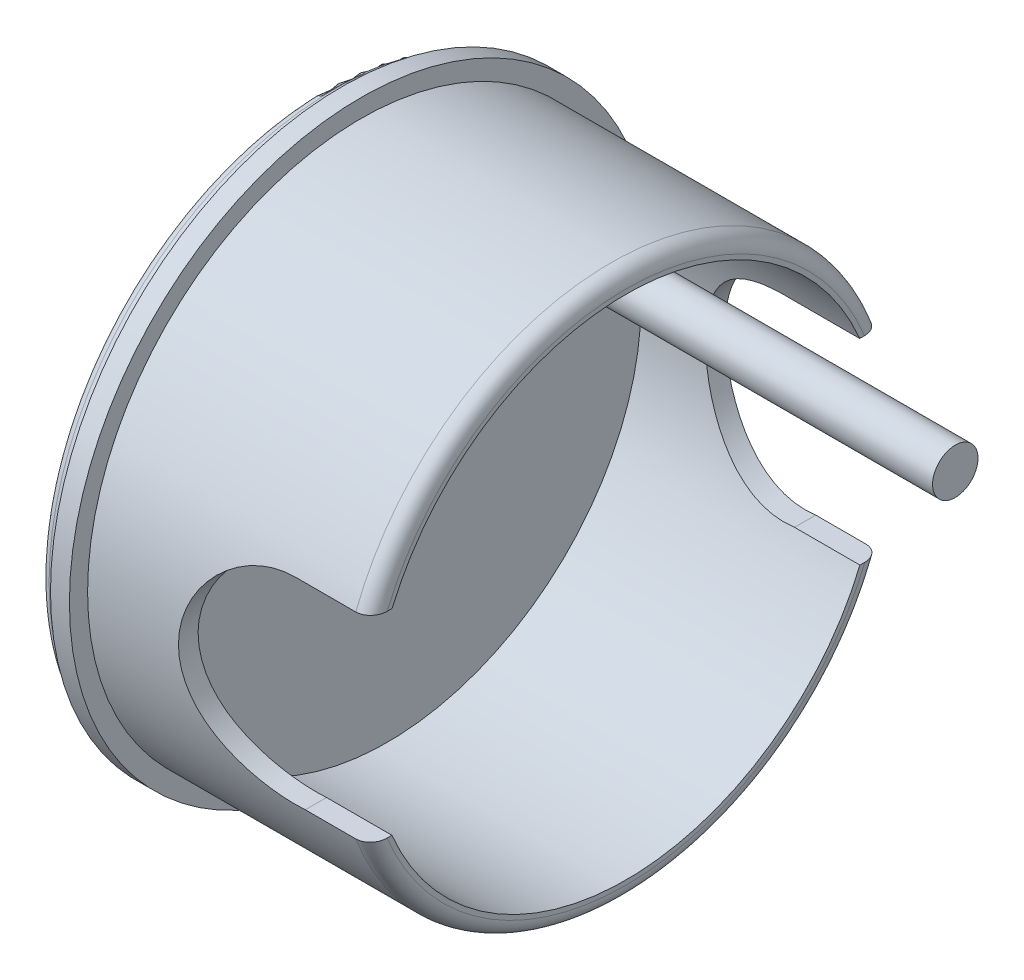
ISO-10303-21;
HEADER;
FILE_DESCRIPTION(('STEP AP214'),'2;1');
FILE_NAME('part.step','',(''),(''),'','','');
FILE_SCHEMA(('AUTOMOTIVE_DESIGN { 1 0 10303 214 1 1 1 1 }'));
ENDSEC;
DATA;
#1=APPLICATION_CONTEXT('core data for automotive mechanical design processes');
#2=APPLICATION_PROTOCOL_DEFINITION('international standard','automotive_design',2000,#1);
#3=PRODUCT_CONTEXT('',#1,'mechanical');
#4=PRODUCT('Part','Part','',(#3));
#5=PRODUCT_RELATED_PRODUCT_CATEGORY('part','',(#4));
#6=PRODUCT_DEFINITION_FORMATION('','',#4);
#7=PRODUCT_DEFINITION_CONTEXT('part definition',#1,'design');
#8=PRODUCT_DEFINITION('design','',#6,#7);
#9=PRODUCT_DEFINITION_SHAPE('','',#8);
#10=(LENGTH_UNIT() NAMED_UNIT(*) SI_UNIT(.MILLI.,.METRE.));
#11=(NAMED_UNIT(*) PLANE_ANGLE_UNIT() SI_UNIT($,.RADIAN.));
#12=(NAMED_UNIT(*) SI_UNIT($,.STERADIAN.) SOLID_ANGLE_UNIT());
#13=UNCERTAINTY_MEASURE_WITH_UNIT(LENGTH_MEASURE(1.E-05),#10,'distance_accuracy_value','');
#14=(GEOMETRIC_REPRESENTATION_CONTEXT(3) GLOBAL_UNCERTAINTY_ASSIGNED_CONTEXT((#13)) GLOBAL_UNIT_ASSIGNED_CONTEXT((#10,
#11,#12)) REPRESENTATION_CONTEXT('',''));
#15=CARTESIAN_POINT('',(0.,0.,0.));
#16=DIRECTION('',(0.,0.,1.));
#17=DIRECTION('',(1.,0.,0.));
#18=AXIS2_PLACEMENT_3D('',#15,#16,#17);
#19=CARTESIAN_POINT('',(19.9999999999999,0.,0.));
#20=DIRECTION('',(-1.,0.,0.));
#21=DIRECTION('',(0.,0.,1.));
#22=AXIS2_PLACEMENT_3D('',#19,#20,#21);
#23=PLANE('',#22);
#24=CARTESIAN_POINT('',(19.9999999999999,0.,0.));
#25=DIRECTION('',(-1.,0.,0.));
#26=DIRECTION('',(0.,0.,1.));
#27=AXIS2_PLACEMENT_3D('',#24,#25,#26);
#28=CIRCLE('',#27,33.5);
#29=CARTESIAN_POINT('',(19.9999999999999,0.,33.5));
#30=VERTEX_POINT('',#29);
#31=EDGE_CURVE('E217',#30,#30,#28,.T.);
#32=ORIENTED_EDGE('',*,*,#31,.F.);
#33=EDGE_LOOP('',(#32));
#34=FACE_BOUND('',#33,.T.);
#35=CARTESIAN_POINT('',(19.9999999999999,25.,-10.));
#36=DIRECTION('',(-1.,0.,0.));
#37=DIRECTION('',(0.,0.,1.));
#38=AXIS2_PLACEMENT_3D('',#35,#36,#37);
#39=CIRCLE('',#38,3.);
#40=CARTESIAN_POINT('',(19.9999999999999,25.,-7.));
#41=VERTEX_POINT('',#40);
#42=EDGE_CURVE('E271',#41,#41,#39,.F.);
#43=ORIENTED_EDGE('',*,*,#42,.F.);
#44=EDGE_LOOP('',(#43));
#45=FACE_BOUND('',#44,.T.);
#46=ADVANCED_FACE('F30',(#34,#45),#23,.F.);
#47=CARTESIAN_POINT('',(200.153901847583,0.,0.));
#48=DIRECTION('',(-1.,0.,0.));
#49=DIRECTION('',(0.,0.,1.));
#50=AXIS2_PLACEMENT_3D('',#47,#48,#49);
#51=DEGENERATE_TOROIDAL_SURFACE('',#50,1.5330828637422,192.160017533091,.F.);
#52=CARTESIAN_POINT('',(11.8355987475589,0.,0.));
#53=DIRECTION('',(1.,0.,0.));
#54=DIRECTION('',(0.,0.,-1.));
#55=AXIS2_PLACEMENT_3D('',#52,#53,#54);
#56=CIRCLE('',#55,36.6989594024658);
#57=CARTESIAN_POINT('',(11.8355987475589,0.,-36.6989594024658));
#58=VERTEX_POINT('',#57);
#59=EDGE_CURVE('E39',#58,#58,#56,.F.);
#60=ORIENTED_EDGE('',*,*,#59,.T.);
#61=EDGE_LOOP('',(#60));
#62=FACE_BOUND('',#61,.T.);
#63=CARTESIAN_POINT('',(10.0371017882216,3.34586200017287,-17.2184560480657));
#64=CARTESIAN_POINT('',(8.94242461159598,3.39797696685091,-17.2367258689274));
#65=CARTESIAN_POINT('',(9.04255908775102,3.03212008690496,-18.2650690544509));
#66=CARTESIAN_POINT('',(10.0456071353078,3.47842845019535,-17.2649439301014));
#67=CARTESIAN_POINT('',(8.94932273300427,3.52954599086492,-17.2812136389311));
#68=CARTESIAN_POINT('',(9.05110892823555,3.19209552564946,-18.3211357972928));
#69=CARTESIAN_POINT('',(10.0536970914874,3.61297369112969,-17.3058230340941));
#70=CARTESIAN_POINT('',(8.95587099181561,3.66279713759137,-17.320143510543));
#71=CARTESIAN_POINT('',(9.05924120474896,3.3544584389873,-18.3704359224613));
#72=CARTESIAN_POINT('',(10.068995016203,3.88505392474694,-17.376125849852));
#73=CARTESIAN_POINT('',(8.96824444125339,3.93198438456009,-17.3868061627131));
#74=CARTESIAN_POINT('',(9.07461915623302,3.68279152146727,-18.4552160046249));
#75=CARTESIAN_POINT('',(10.0762030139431,4.02258881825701,-17.4055499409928));
#76=CARTESIAN_POINT('',(8.97406770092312,4.06790313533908,-17.4145187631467));
#77=CARTESIAN_POINT('',(9.08186486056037,3.84876157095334,-18.4906964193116));
#78=CARTESIAN_POINT('',(10.0896819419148,4.29959810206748,-17.4526924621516));
#79=CARTESIAN_POINT('',(8.98495042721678,4.34141842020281,-17.4585519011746));
#80=CARTESIAN_POINT('',(9.09541429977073,4.1830417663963,-18.5475351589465));
#81=CARTESIAN_POINT('',(10.095953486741,4.4390711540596,-17.4704185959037));
#82=CARTESIAN_POINT('',(8.99000857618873,4.47899337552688,-17.4748625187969));
#83=CARTESIAN_POINT('',(9.10171865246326,4.35135029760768,-18.5689027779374));
#84=CARTESIAN_POINT('',(10.1075211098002,4.71900147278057,-17.4940762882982));
#85=CARTESIAN_POINT('',(8.99933340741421,4.75492571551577,-17.4960397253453));
#86=CARTESIAN_POINT('',(9.11334678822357,4.68915492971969,-18.5974086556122));
#87=CARTESIAN_POINT('',(10.1128172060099,4.85945872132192,-17.5000080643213));
#88=CARTESIAN_POINT('',(9.00359846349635,4.89325981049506,-17.5008927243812));
#89=CARTESIAN_POINT('',(9.11867058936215,4.85865100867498,-18.6045471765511));
#90=CARTESIAN_POINT('',(10.1271606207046,5.28016174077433,-17.4999839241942));
#91=CARTESIAN_POINT('',(9.01515060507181,5.30756937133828,-17.4982180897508));
#92=CARTESIAN_POINT('',(9.13308903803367,5.36633247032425,-18.6044648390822));
#93=CARTESIAN_POINT('',(10.134707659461,5.56065740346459,-17.4763639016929));
#94=CARTESIAN_POINT('',(9.02121249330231,5.58325198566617,-17.4735483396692));
#95=CARTESIAN_POINT('',(9.14067555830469,5.70481961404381,-18.5759333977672));
#96=CARTESIAN_POINT('',(10.1455514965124,6.11357503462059,-17.3824872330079));
#97=CARTESIAN_POINT('',(9.02992531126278,6.12665263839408,-17.3792439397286));
#98=CARTESIAN_POINT('',(9.15157612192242,6.37205376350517,-18.4626066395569));
#99=CARTESIAN_POINT('',(10.1488492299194,6.38599876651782,-17.3122408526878));
#100=CARTESIAN_POINT('',(9.03257027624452,6.39415528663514,-17.3096112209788));
#101=CARTESIAN_POINT('',(9.15489110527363,6.70080289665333,-18.3778237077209));
#102=CARTESIAN_POINT('',(10.151114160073,6.91530831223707,-17.1271114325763));
#103=CARTESIAN_POINT('',(9.03438856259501,6.91430261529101,-17.1272400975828));
#104=CARTESIAN_POINT('',(9.1571678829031,7.33955582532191,-18.1544068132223));
#105=CARTESIAN_POINT('',(10.1500810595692,7.17219305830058,-17.0122253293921));
#106=CARTESIAN_POINT('',(9.03356021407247,7.16673827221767,-17.0145617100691));
#107=CARTESIAN_POINT('',(9.15612937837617,7.64955833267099,-18.0157691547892));
#108=CARTESIAN_POINT('',(10.1437097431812,7.6630878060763,-16.7410631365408));
#109=CARTESIAN_POINT('',(9.02844396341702,7.64990616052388,-16.7490210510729));
#110=CARTESIAN_POINT('',(9.14972473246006,8.24196643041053,-17.6885597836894));
#111=CARTESIAN_POINT('',(10.1383710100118,7.89709505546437,-16.5847820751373));
#112=CARTESIAN_POINT('',(9.02415964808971,7.88045947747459,-16.5962810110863));
#113=CARTESIAN_POINT('',(9.14435807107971,8.5243687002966,-17.4999820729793));
#114=CARTESIAN_POINT('',(10.1235389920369,8.33551818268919,-16.2353542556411));
#115=CARTESIAN_POINT('',(9.01223291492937,8.313494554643,-16.2546641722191));
#116=CARTESIAN_POINT('',(9.12944846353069,9.05347292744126,-17.0783509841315));
#117=CARTESIAN_POINT('',(10.114046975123,8.53994306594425,-16.0422187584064));
#118=CARTESIAN_POINT('',(9.00460050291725,8.51586000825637,-16.065975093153));
#119=CARTESIAN_POINT('',(9.11990679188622,9.3001857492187,-16.8453111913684));
#120=CARTESIAN_POINT('',(10.091168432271,8.91355489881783,-15.6245171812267));
#121=CARTESIAN_POINT('',(8.9861588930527,8.88702925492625,-15.6573355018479));
#122=CARTESIAN_POINT('',(9.09690856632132,9.75109865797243,-16.3413132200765));
#123=CARTESIAN_POINT('',(10.0777813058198,9.08273640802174,-15.3999462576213));
#124=CARTESIAN_POINT('',(8.97536215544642,9.05576806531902,-15.4375865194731));
#125=CARTESIAN_POINT('',(9.08345140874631,9.95529218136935,-16.0703491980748));
#126=CARTESIAN_POINT('',(10.0474548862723,9.38136929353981,-14.92536265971));
#127=CARTESIAN_POINT('',(8.95083574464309,9.35514557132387,-14.9722521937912));
#128=CARTESIAN_POINT('',(9.05296634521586,10.3157467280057,-15.4977281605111));
#129=CARTESIAN_POINT('',(10.0305089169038,9.51074485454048,-14.6753026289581));
#130=CARTESIAN_POINT('',(8.93711604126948,9.48572355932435,-14.7268314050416));
#131=CARTESIAN_POINT('',(9.03593172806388,10.4719162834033,-15.1960140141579));
#132=CARTESIAN_POINT('',(9.99355280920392,9.72564553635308,-14.1573325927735));
#133=CARTESIAN_POINT('',(8.90710540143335,9.70442793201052,-14.2172077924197));
#134=CARTESIAN_POINT('',(8.99878229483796,10.7313512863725,-14.5710522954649));
#135=CARTESIAN_POINT('',(9.97354553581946,9.81121133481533,-13.8894394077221));
#136=CARTESIAN_POINT('',(8.89083332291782,9.79267363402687,-13.9532208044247));
#137=CARTESIAN_POINT('',(8.97867035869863,10.8346658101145,-14.2478250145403));
#138=CARTESIAN_POINT('',(9.93803507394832,9.91568292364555,-13.4334824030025));
#139=CARTESIAN_POINT('',(8.86184545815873,9.90251590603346,-13.5024158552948));
#140=CARTESIAN_POINT('',(8.94297413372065,10.9608441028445,-13.6976916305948));
#141=CARTESIAN_POINT('',(9.92321877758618,9.94726185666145,-13.2481865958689));
#142=CARTESIAN_POINT('',(8.84974122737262,9.93649814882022,-13.3190630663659));
#143=CARTESIAN_POINT('',(8.92808033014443,10.9989977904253,-13.4741243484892));
#144=CARTESIAN_POINT('',(9.89263664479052,9.98942742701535,-12.8752928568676));
#145=CARTESIAN_POINT('',(8.82470918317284,9.98378928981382,-12.9494186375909));
#146=CARTESIAN_POINT('',(8.89733821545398,11.0499781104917,-13.0242137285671));
#147=CARTESIAN_POINT('',(9.87687078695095,10.0000135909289,-12.6876948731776));
#148=CARTESIAN_POINT('',(8.81178550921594,9.99714910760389,-12.7631637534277));
#149=CARTESIAN_POINT('',(8.88148988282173,11.0628041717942,-12.7978703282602));
#150=CARTESIAN_POINT('',(9.83648740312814,9.99997962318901,-12.2185900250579));
#151=CARTESIAN_POINT('',(8.77864091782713,10.0042593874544,-12.2968644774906));
#152=CARTESIAN_POINT('',(8.8408952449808,11.0628976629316,-12.231881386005));
#153=CARTESIAN_POINT('',(9.81138064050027,9.9761322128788,-11.936962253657));
#154=CARTESIAN_POINT('',(8.7579737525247,9.98506069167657,-12.0160081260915));
#155=CARTESIAN_POINT('',(8.81565714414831,11.0342063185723,-11.8920910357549));
#156=CARTESIAN_POINT('',(9.772932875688,9.90515278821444,-11.5204417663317));
#157=CARTESIAN_POINT('',(8.72619980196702,9.92082203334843,-11.598998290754));
#158=CARTESIAN_POINT('',(8.77700825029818,10.9486890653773,-11.3895533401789));
#159=CARTESIAN_POINT('',(9.75995569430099,9.87551864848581,-11.3822853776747));
#160=CARTESIAN_POINT('',(8.71547344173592,9.8934761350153,-11.4606322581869));
#161=CARTESIAN_POINT('',(8.76396318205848,10.9129751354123,-11.222866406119));
#162=CARTESIAN_POINT('',(9.73382468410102,9.80466601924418,-11.108925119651));
#163=CARTESIAN_POINT('',(8.6938470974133,9.82710825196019,-11.1864810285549));
#164=CARTESIAN_POINT('',(8.73769547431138,10.8275700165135,-10.8930563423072));
#165=CARTESIAN_POINT('',(9.72067078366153,9.76344268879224,-10.9737225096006));
#166=CARTESIAN_POINT('',(8.6829476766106,9.7881081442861,-11.0506943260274));
#167=CARTESIAN_POINT('',(8.72447276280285,10.77787298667,-10.7299347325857));
#168=CARTESIAN_POINT('',(9.70746841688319,9.71654835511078,-10.8404302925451));
#169=CARTESIAN_POINT('',(8.67198178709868,9.74330900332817,-10.9164848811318));
#170=CARTESIAN_POINT('',(8.7112013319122,10.7213334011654,-10.5691189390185));
#171=(BOUNDED_SURFACE() B_SPLINE_SURFACE(3,2,((#63,#64,#65),(#66,#67,#68),(#69,#70,#71),(#72,
#73,#74),(#75,#76,#77),(#78,#79,#80),(#81,#82,#83),(#84,#85,#86),(#87,#88,#89),(#90,#91,#92),
(#93,#94,#95),(#96,#97,#98),(#99,#100,#101),(#102,#103,#104),(#105,#106,#107),(#108,#109,#110),
(#111,#112,#113),(#114,#115,#116),(#117,#118,#119),(#120,#121,#122),(#123,#124,#125),(#126,#127,
#128),(#129,#130,#131),(#132,#133,#134),(#135,#136,#137),(#138,#139,#140),(#141,#142,#143),
(#144,#145,#146),(#147,#148,#149),(#150,#151,#152),(#153,#154,#155),(#156,#157,#158),(#159,#160,
#161),(#162,#163,#164),(#165,#166,#167),(#168,#169,#170)),.UNSPECIFIED.,.F.,.F.,
.F.) B_SPLINE_SURFACE_WITH_KNOTS((4,2,2,2,2,2,2,2,2,2,2,2,2,2,2,2,2,4),(3,3),(0.,
0.506212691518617,1.0124086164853,1.51827085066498,2.02412376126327,3.03251526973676,
4.04068483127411,5.04892359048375,6.05728349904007,7.0653357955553,8.0735435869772,
9.08365991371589,10.0928366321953,10.7696299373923,11.4464385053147,12.46117417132,
12.9708327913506,13.4807046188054),(0.,1.),
.UNSPECIFIED.) GEOMETRIC_REPRESENTATION_ITEM() RATIONAL_B_SPLINE_SURFACE(((1.,0.673990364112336,
1.),(1.,0.673478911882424,1.),(1.,0.672991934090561,1.),(1.,0.672070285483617,1.),(1.,
0.671635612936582,1.),(1.,0.670822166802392,1.),(1.,0.670443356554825,1.),(1.,0.669744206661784,
1.),(1.,0.669423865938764,1.),(1.,0.668555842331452,1.),(1.,0.668098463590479,1.),(1.,
0.667441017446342,1.),(1.,0.667240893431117,1.),(1.,0.667103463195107,1.),(1.,0.667166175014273,
1.),(1.,0.667552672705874,1.),(1.,0.667876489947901,1.),(1.,0.668775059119,1.),(1.,
0.669349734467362,1.),(1.,0.670732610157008,1.),(1.,0.671540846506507,1.),(1.,0.673368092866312,
1.),(1.,0.674387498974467,1.),(1.,0.676605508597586,1.),(1.,0.677803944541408,1.),(1.,
0.679925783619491,1.),(1.,0.680809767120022,1.),(1.,0.682631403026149,1.),(1.,0.683569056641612,
1.),(1.,0.685966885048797,1.),(1.,0.687454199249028,1.),(1.,0.689726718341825,1.),(1.,
0.690492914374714,1.),(1.,0.692034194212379,1.),(1.,0.692809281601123,1.),(1.,0.693586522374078,1.))) REPRESENTATION_ITEM('') SURFACE());
#172=CARTESIAN_POINT('',(9.04255908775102,3.03212008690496,-18.2650690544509));
#173=CARTESIAN_POINT('',(9.05110892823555,3.19209552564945,-18.3211357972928));
#174=CARTESIAN_POINT('',(9.05924120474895,3.3544584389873,-18.3704359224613));
#175=CARTESIAN_POINT('',(9.07461915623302,3.68279152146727,-18.4552160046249));
#176=CARTESIAN_POINT('',(9.08186486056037,3.84876157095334,-18.4906964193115));
#177=CARTESIAN_POINT('',(9.09541429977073,4.1830417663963,-18.5475351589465));
#178=CARTESIAN_POINT('',(9.10171865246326,4.35135029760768,-18.5689027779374));
#179=CARTESIAN_POINT('',(9.11334678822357,4.68915492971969,-18.5974086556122));
#180=CARTESIAN_POINT('',(9.11867058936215,4.85865100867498,-18.6045471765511));
#181=CARTESIAN_POINT('',(9.13308903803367,5.36633247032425,-18.6044648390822));
#182=CARTESIAN_POINT('',(9.14067555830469,5.70481961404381,-18.5759333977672));
#183=CARTESIAN_POINT('',(9.15157612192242,6.37205376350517,-18.4626066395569));
#184=CARTESIAN_POINT('',(9.15489110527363,6.70080289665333,-18.3778237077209));
#185=CARTESIAN_POINT('',(9.1571678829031,7.33955582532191,-18.1544068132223));
#186=CARTESIAN_POINT('',(9.15612937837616,7.64955833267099,-18.0157691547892));
#187=CARTESIAN_POINT('',(9.14972473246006,8.24196643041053,-17.6885597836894));
#188=CARTESIAN_POINT('',(9.14435807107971,8.5243687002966,-17.4999820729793));
#189=CARTESIAN_POINT('',(9.12944846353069,9.05347292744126,-17.0783509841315));
#190=CARTESIAN_POINT('',(9.11990679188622,9.3001857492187,-16.8453111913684));
#191=CARTESIAN_POINT('',(9.09690856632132,9.75109865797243,-16.3413132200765));
#192=CARTESIAN_POINT('',(9.08345140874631,9.95529218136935,-16.0703491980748));
#193=CARTESIAN_POINT('',(9.05296634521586,10.3157467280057,-15.4977281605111));
#194=CARTESIAN_POINT('',(9.03593172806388,10.4719162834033,-15.1960140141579));
#195=CARTESIAN_POINT('',(8.99878229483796,10.7313512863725,-14.5710522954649));
#196=CARTESIAN_POINT('',(8.97867035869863,10.8346658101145,-14.2478250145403));
#197=CARTESIAN_POINT('',(8.94297413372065,10.9608441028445,-13.6976916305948));
#198=CARTESIAN_POINT('',(8.92808033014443,10.9989977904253,-13.4741243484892));
#199=CARTESIAN_POINT('',(8.89733821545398,11.0499781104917,-13.0242137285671));
#200=CARTESIAN_POINT('',(8.88148988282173,11.0628041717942,-12.7978703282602));
#201=CARTESIAN_POINT('',(8.8408952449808,11.0628976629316,-12.231881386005));
#202=CARTESIAN_POINT('',(8.81565714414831,11.0342063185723,-11.8920910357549));
#203=CARTESIAN_POINT('',(8.77700825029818,10.9486890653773,-11.3895533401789));
#204=CARTESIAN_POINT('',(8.76396318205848,10.9129751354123,-11.222866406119));
#205=CARTESIAN_POINT('',(8.73769547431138,10.8275700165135,-10.8930563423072));
#206=CARTESIAN_POINT('',(8.72447276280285,10.77787298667,-10.7299347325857));
#207=CARTESIAN_POINT('',(8.7112013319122,10.7213334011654,-10.5691189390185));
#208=B_SPLINE_CURVE_WITH_KNOTS('',3,(#172,#173,#174,#175,#176,#177,#178,#179,#180,#181,#182,
#183,#184,#185,#186,#187,#188,#189,#190,#191,#192,#193,#194,#195,#196,#197,#198,#199,#200,#201,
#202,#203,#204,#205,#206,#207),.UNSPECIFIED.,.F.,.F.,(4,2,2,2,2,2,2,2,2,2,2,2,2,2,2,2,2,4),(0.,
0.506212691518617,1.0124086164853,1.51827085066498,2.02412376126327,3.03251526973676,
4.04068483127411,5.04892359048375,6.05728349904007,7.0653357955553,8.0735435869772,
9.08365991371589,10.0928366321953,10.7696299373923,11.4464385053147,12.46117417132,
12.9708327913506,13.4807046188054),.UNSPECIFIED.);
#209=CARTESIAN_POINT('',(9.1234872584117,5.02824855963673,-18.6045196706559));
#210=VERTEX_POINT('',#209);
#211=CARTESIAN_POINT('',(8.86524744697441,11.0628415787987,-12.5714108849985));
#212=VERTEX_POINT('',#211);
#213=EDGE_CURVE('E364',#210,#212,#208,.T.);
#214=ORIENTED_EDGE('',*,*,#213,.T.);
#215=CARTESIAN_POINT('',(11.8003296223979,10.,-29.0924085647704));
#216=CARTESIAN_POINT('',(10.7516943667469,10.,-29.2623605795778));
#217=CARTESIAN_POINT('',(10.8150107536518,11.0603797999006,-29.252098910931));
#218=CARTESIAN_POINT('',(11.577581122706,10.,-27.7180170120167));
#219=CARTESIAN_POINT('',(10.5275612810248,10.,-27.8802217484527));
#220=CARTESIAN_POINT('',(10.5910970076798,11.0604983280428,-27.8704738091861));
#221=CARTESIAN_POINT('',(11.3699749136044,10.,-26.3412394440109));
#222=CARTESIAN_POINT('',(10.3186511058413,10.,-26.4957071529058));
#223=CARTESIAN_POINT('',(10.3824047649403,11.0606282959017,-26.4864417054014));
#224=CARTESIAN_POINT('',(10.9852210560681,10.,-23.583425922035));
#225=CARTESIAN_POINT('',(9.93141884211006,10.,-23.7224328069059));
#226=CARTESIAN_POINT('',(9.99563817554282,11.0609265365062,-23.7140684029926));
#227=CARTESIAN_POINT('',(10.8080736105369,10.,-22.2023899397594));
#228=CARTESIAN_POINT('',(9.75309390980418,10.,-22.3336157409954));
#229=CARTESIAN_POINT('',(9.81756403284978,11.061094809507,-22.3257271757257));
#230=CARTESIAN_POINT('',(10.322471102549,10.,-18.0527229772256));
#231=CARTESIAN_POINT('',(9.2640777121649,10.,-18.1601270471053));
#232=CARTESIAN_POINT('',(9.32942123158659,11.0616803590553,-18.154050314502));
#233=CARTESIAN_POINT('',(10.0600122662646,10.,-15.2784971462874));
#234=CARTESIAN_POINT('',(8.99958907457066,10.,-15.3697719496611));
#235=CARTESIAN_POINT('',(9.06558941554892,11.0621783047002,-15.3650307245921));
#236=CARTESIAN_POINT('',(9.76104679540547,10.,-11.1105229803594));
#237=CARTESIAN_POINT('',(8.69787963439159,10.,-11.1784416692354));
#238=CARTESIAN_POINT('',(8.76505999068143,11.063173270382,-11.1743712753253));
#239=CARTESIAN_POINT('',(9.67717576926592,10.,-9.7199777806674));
#240=CARTESIAN_POINT('',(8.61311974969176,10.,-9.77969292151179));
#241=CARTESIAN_POINT('',(8.68075021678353,11.063546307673,-9.77618122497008));
#242=CARTESIAN_POINT('',(9.54202283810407,10.,-6.93725807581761));
#243=CARTESIAN_POINT('',(8.47632310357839,10.,-6.98039141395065));
#244=CARTESIAN_POINT('',(8.54489027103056,11.0643283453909,-6.97787455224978));
#245=CARTESIAN_POINT('',(9.49074092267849,10.,-5.54508357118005));
#246=CARTESIAN_POINT('',(8.42429735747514,10.,-5.57978368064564));
#247=CARTESIAN_POINT('',(8.49334008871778,11.0647373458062,-5.57775793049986));
#248=CARTESIAN_POINT('',(9.42222160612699,10.,-2.76022826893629));
#249=CARTESIAN_POINT('',(8.35468656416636,10.,-2.77759367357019));
#250=CARTESIAN_POINT('',(8.42446233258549,11.0653555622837,-2.77666582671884));
#251=CARTESIAN_POINT('',(9.4049761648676,10.,-1.36754766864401));
#252=CARTESIAN_POINT('',(8.33711218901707,10.,-1.37631013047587));
#253=CARTESIAN_POINT('',(8.40712667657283,11.0655648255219,-1.37569062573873));
#254=CARTESIAN_POINT('',(9.40539153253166,10.,1.41778762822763));
#255=CARTESIAN_POINT('',(8.33753376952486,10.,1.42686823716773));
#256=CARTESIAN_POINT('',(8.40754421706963,11.0655617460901,1.42623003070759));
#257=CARTESIAN_POINT('',(9.42305138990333,10.,2.81044232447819));
#258=CARTESIAN_POINT('',(8.35552860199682,10.,2.82813071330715));
#259=CARTESIAN_POINT('',(8.42529645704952,11.0653494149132,2.82717548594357));
#260=CARTESIAN_POINT('',(9.47495357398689,10.,4.89475676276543));
#261=CARTESIAN_POINT('',(8.40826338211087,10.,4.92557523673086));
#262=CARTESIAN_POINT('',(8.47747015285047,11.0648789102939,4.92363778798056));
#263=CARTESIAN_POINT('',(9.49639161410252,10.,5.58676056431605));
#264=CARTESIAN_POINT('',(8.43002694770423,10.,5.62183459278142));
#265=CARTESIAN_POINT('',(8.4990203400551,11.0646974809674,5.61963173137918));
#266=CARTESIAN_POINT('',(9.54748348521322,10.,6.97045230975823));
#267=CARTESIAN_POINT('',(8.48183485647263,10.,7.01395646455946));
#268=CARTESIAN_POINT('',(8.55037948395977,11.0643196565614,7.01122185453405));
#269=CARTESIAN_POINT('',(9.57713716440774,10.,7.6621402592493));
#270=CARTESIAN_POINT('',(8.51187696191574,10.,7.70980797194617));
#271=CARTESIAN_POINT('',(8.58018828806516,11.0641232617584,7.70681804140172));
#272=CARTESIAN_POINT('',(9.6781747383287,10.,9.7366430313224));
#273=CARTESIAN_POINT('',(8.61412758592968,10.,9.79647521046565));
#274=CARTESIAN_POINT('',(8.6817544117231,11.0635444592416,9.79293774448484));
#275=CARTESIAN_POINT('',(9.76163490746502,10.,11.1188864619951));
#276=CARTESIAN_POINT('',(8.69847283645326,10.,11.1868550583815));
#277=CARTESIAN_POINT('',(8.76565117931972,11.063172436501,11.1827820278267));
#278=CARTESIAN_POINT('',(9.96034893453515,10.,13.8888931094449));
#279=CARTESIAN_POINT('',(8.89904710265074,10.,13.9728750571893));
#280=CARTESIAN_POINT('',(8.96540472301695,11.0625088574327,13.9678616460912));
#281=CARTESIAN_POINT('',(10.0757792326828,10.,15.2766435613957));
#282=CARTESIAN_POINT('',(9.01545095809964,10.,15.3686284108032));
#283=CARTESIAN_POINT('',(9.08143886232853,11.0622177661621,15.3630832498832));
#284=CARTESIAN_POINT('',(10.3376818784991,10.,18.0492637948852));
#285=CARTESIAN_POINT('',(9.27939233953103,10.,18.1570195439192));
#286=CARTESIAN_POINT('',(9.34471157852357,11.0617058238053,18.1505452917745));
#287=CARTESIAN_POINT('',(10.4841553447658,10.,19.4341334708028));
#288=CARTESIAN_POINT('',(9.42693239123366,10.,19.5497626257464));
#289=CARTESIAN_POINT('',(9.49195127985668,11.0614849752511,19.5427856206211));
#290=CARTESIAN_POINT('',(10.80782034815,10.,22.200470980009));
#291=CARTESIAN_POINT('',(9.75283906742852,10.,22.3316812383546));
#292=CARTESIAN_POINT('',(9.8173094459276,11.0610955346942,22.3238002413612));
#293=CARTESIAN_POINT('',(10.9850161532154,10.,23.5819383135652));
#294=CARTESIAN_POINT('',(9.93121267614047,10.,23.720934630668));
#295=CARTESIAN_POINT('',(9.99543220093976,11.0609269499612,23.7125740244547));
#296=CARTESIAN_POINT('',(11.3698771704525,10.,26.3405577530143));
#297=CARTESIAN_POINT('',(10.3185526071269,10.,26.4950233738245));
#298=CARTESIAN_POINT('',(10.3823065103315,11.0606281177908,26.4857553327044));
#299=CARTESIAN_POINT('',(11.5775409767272,10.,27.7177100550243));
#300=CARTESIAN_POINT('',(10.5275205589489,10.,27.8799162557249));
#301=CARTESIAN_POINT('',(10.5910566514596,11.0604978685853,27.8701630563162));
#302=CARTESIAN_POINT('',(11.8003296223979,10.,29.0924085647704));
#303=CARTESIAN_POINT('',(10.7516943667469,10.,29.2623605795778));
#304=CARTESIAN_POINT('',(10.8150107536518,11.0603797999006,29.252098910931));
#305=(BOUNDED_SURFACE() B_SPLINE_SURFACE(3,2,((#215,#216,#217),(#218,#219,#220),(#221,#222,
#223),(#224,#225,#226),(#227,#228,#229),(#230,#231,#232),(#233,#234,#235),(#236,#237,#238),
(#239,#240,#241),(#242,#243,#244),(#245,#246,#247),(#248,#249,#250),(#251,#252,#253),(#254,#255,
#256),(#257,#258,#259),(#260,#261,#262),(#263,#264,#265),(#266,#267,#268),(#269,#270,#271),
(#272,#273,#274),(#275,#276,#277),(#278,#279,#280),(#281,#282,#283),(#284,#285,#286),(#287,#288,
#289),(#290,#291,#292),(#293,#294,#295),(#296,#297,#298),(#299,#300,#301),(#302,#303,#304)),
.UNSPECIFIED.,.F.,.F.,.F.) B_SPLINE_SURFACE_WITH_KNOTS((4,2,2,2,2,2,2,2,2,2,2,2,2,2,4),(3,3),
(0.,4.17675504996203,8.35353792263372,16.7100315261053,20.8889653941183,25.0678979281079,
29.2458431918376,33.4236745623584,35.5006404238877,37.5775679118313,41.7314538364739,
45.9087378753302,50.086172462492,54.2641878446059,58.4420104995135),(0.,1.),
.UNSPECIFIED.) GEOMETRIC_REPRESENTATION_ITEM() RATIONAL_B_SPLINE_SURFACE(((1.,0.685426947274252,
1.),(1.,0.685383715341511,1.),(1.,0.685336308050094,1.),(1.,0.685227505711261,1.),(1.,
0.685166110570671,1.),(1.,0.684952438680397,1.),(1.,0.684770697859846,1.),(1.,0.684407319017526,
1.),(1.,0.684271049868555,1.),(1.,0.683985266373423,1.),(1.,0.68383575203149,1.),(1.,
0.683609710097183,1.),(1.,0.683533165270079,1.),(1.,0.683534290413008,1.),(1.,0.683611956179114,
1.),(1.,0.683783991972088,1.),(1.,0.683850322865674,1.),(1.,0.683988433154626,1.),(1.,
0.684060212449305,1.),(1.,0.684271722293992,1.),(1.,0.684407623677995,1.),(1.,0.684649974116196,
1.),(1.,0.684756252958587,1.),(1.,0.684943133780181,1.),(1.,0.685023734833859,1.),(1.,
0.685165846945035,1.),(1.,0.685227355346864,1.),(1.,0.685336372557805,1.),(1.,0.685383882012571,
1.),(1.,0.685426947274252,1.))) REPRESENTATION_ITEM('') SURFACE());
#306=CARTESIAN_POINT('',(10.8150107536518,11.0603797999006,-29.252098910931));
#307=CARTESIAN_POINT('',(10.5910970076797,11.0604983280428,-27.8704738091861));
#308=CARTESIAN_POINT('',(10.3824047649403,11.0606282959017,-26.4864417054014));
#309=CARTESIAN_POINT('',(9.99563817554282,11.0609265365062,-23.7140684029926));
#310=CARTESIAN_POINT('',(9.81756403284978,11.061094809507,-22.3257271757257));
#311=CARTESIAN_POINT('',(9.3294212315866,11.0616803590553,-18.154050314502));
#312=CARTESIAN_POINT('',(9.06558941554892,11.0621783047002,-15.3650307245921));
#313=CARTESIAN_POINT('',(8.76505999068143,11.063173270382,-11.1743712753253));
#314=CARTESIAN_POINT('',(8.68075021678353,11.063546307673,-9.77618122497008));
#315=CARTESIAN_POINT('',(8.54489027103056,11.0643283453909,-6.97787455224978));
#316=CARTESIAN_POINT('',(8.49334008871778,11.0647373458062,-5.57775793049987));
#317=CARTESIAN_POINT('',(8.42446233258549,11.0653555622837,-2.77666582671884));
#318=CARTESIAN_POINT('',(8.40712667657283,11.0655648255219,-1.37569062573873));
#319=CARTESIAN_POINT('',(8.40754421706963,11.0655617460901,1.42623003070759));
#320=CARTESIAN_POINT('',(8.42529645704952,11.0653494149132,2.82717548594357));
#321=CARTESIAN_POINT('',(8.47747015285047,11.0648789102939,4.92363778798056));
#322=CARTESIAN_POINT('',(8.4990203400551,11.0646974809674,5.61963173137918));
#323=CARTESIAN_POINT('',(8.55037948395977,11.0643196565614,7.01122185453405));
#324=CARTESIAN_POINT('',(8.58018828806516,11.0641232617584,7.70681804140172));
#325=CARTESIAN_POINT('',(8.6817544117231,11.0635444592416,9.79293774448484));
#326=CARTESIAN_POINT('',(8.76565117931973,11.063172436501,11.1827820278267));
#327=CARTESIAN_POINT('',(8.96540472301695,11.0625088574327,13.9678616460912));
#328=CARTESIAN_POINT('',(9.08143886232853,11.0622177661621,15.3630832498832));
#329=CARTESIAN_POINT('',(9.34471157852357,11.0617058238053,18.1505452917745));
#330=CARTESIAN_POINT('',(9.49195127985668,11.0614849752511,19.5427856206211));
#331=CARTESIAN_POINT('',(9.8173094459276,11.0610955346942,22.3238002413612));
#332=CARTESIAN_POINT('',(9.99543220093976,11.0609269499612,23.7125740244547));
#333=CARTESIAN_POINT('',(10.3823065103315,11.0606281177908,26.4857553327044));
#334=CARTESIAN_POINT('',(10.5910566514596,11.0604978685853,27.8701630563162));
#335=CARTESIAN_POINT('',(10.8150107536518,11.0603797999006,29.252098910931));
#336=B_SPLINE_CURVE_WITH_KNOTS('',3,(#306,#307,#308,#309,#310,#311,#312,#313,#314,#315,#316,
#317,#318,#319,#320,#321,#322,#323,#324,#325,#326,#327,#328,#329,#330,#331,#332,#333,#334,#335),
.UNSPECIFIED.,.F.,.F.,(4,2,2,2,2,2,2,2,2,2,2,2,2,2,4),(0.,4.17675504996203,8.35353792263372,
16.7100315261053,20.8889653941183,25.0678979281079,29.2458431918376,33.4236745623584,
35.5006404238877,37.5775679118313,41.7314538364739,45.9087378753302,50.086172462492,
54.2641878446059,58.4420104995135),.UNSPECIFIED.);
#337=CARTESIAN_POINT('',(8.86524744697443,11.0628415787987,12.5714108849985));
#338=VERTEX_POINT('',#337);
#339=EDGE_CURVE('E947',#212,#338,#336,.T.);
#340=ORIENTED_EDGE('',*,*,#339,.T.);
#341=CARTESIAN_POINT('',(9.70746841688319,9.71654835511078,10.8404302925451));
#342=CARTESIAN_POINT('',(8.67198178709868,9.74330900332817,10.9164848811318));
#343=CARTESIAN_POINT('',(8.7112013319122,10.7213334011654,10.5691189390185));
#344=CARTESIAN_POINT('',(9.72064648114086,9.76336047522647,10.9734754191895));
#345=CARTESIAN_POINT('',(8.68292750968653,9.78802959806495,11.0504458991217));
#346=CARTESIAN_POINT('',(8.72444833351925,10.777773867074,10.7296366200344));
#347=CARTESIAN_POINT('',(9.73377760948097,9.80452036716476,11.1084404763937));
#348=CARTESIAN_POINT('',(8.69380806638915,9.82697034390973,11.1859940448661));
#349=CARTESIAN_POINT('',(8.73764815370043,10.8273944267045,10.8924716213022));
#350=CARTESIAN_POINT('',(9.75986881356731,9.87530102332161,11.3813687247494));
#351=CARTESIAN_POINT('',(8.71540153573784,9.89327356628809,11.4597129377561));
#352=CARTESIAN_POINT('',(8.76387584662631,10.9127128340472,11.2217604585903));
#353=CARTESIAN_POINT('',(9.77282889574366,9.9049222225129,11.5193318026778));
#354=CARTESIAN_POINT('',(8.72611381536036,9.92060983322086,11.5978860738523));
#355=CARTESIAN_POINT('',(8.77690372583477,10.9484112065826,11.3882141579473));
#356=CARTESIAN_POINT('',(9.81129902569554,9.97605784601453,11.9360454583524));
#357=CARTESIAN_POINT('',(8.75790675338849,9.98500131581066,12.0150964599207));
#358=CARTESIAN_POINT('',(8.81557510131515,11.034116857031,11.8909849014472));
#359=CARTESIAN_POINT('',(9.83643974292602,9.99998888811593,12.2180326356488));
#360=CARTESIAN_POINT('',(8.77860210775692,10.0042758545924,12.296315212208));
#361=CARTESIAN_POINT('',(8.84084733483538,11.0629089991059,12.2312088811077));
#362=CARTESIAN_POINT('',(9.88492301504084,10.0000110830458,12.7812355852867));
#363=CARTESIAN_POINT('',(8.81842201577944,9.99571726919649,12.8565336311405));
#364=CARTESIAN_POINT('',(8.88958423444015,11.0627743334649,12.9107299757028));
#365=CARTESIAN_POINT('',(9.90827006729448,9.97622623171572,13.0624514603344));
#366=CARTESIAN_POINT('',(8.83753875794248,9.96780946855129,13.1354553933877));
#367=CARTESIAN_POINT('',(8.91305342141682,11.033997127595,13.2500272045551));
#368=CARTESIAN_POINT('',(9.95261553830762,9.88173741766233,13.6169986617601));
#369=CARTESIAN_POINT('',(8.8737761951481,9.8662400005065,13.6842730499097));
#370=CARTESIAN_POINT('',(8.95763087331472,10.9198354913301,13.9191119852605));
#371=CARTESIAN_POINT('',(9.97361446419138,9.81104360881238,13.8903316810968));
#372=CARTESIAN_POINT('',(8.89088242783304,9.79242963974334,13.9540280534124));
#373=CARTESIAN_POINT('',(8.97873964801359,10.8344633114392,14.2489015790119));
#374=CARTESIAN_POINT('',(10.0126934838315,9.62465762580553,14.4213962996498));
#375=CARTESIAN_POINT('',(8.92266398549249,9.60130526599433,14.4772325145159));
#376=CARTESIAN_POINT('',(9.01802309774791,10.6094297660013,14.8896602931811));
#377=CARTESIAN_POINT('',(10.0307731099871,9.50895825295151,14.6791253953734));
#378=CARTESIAN_POINT('',(8.93732244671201,9.4838814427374,14.7304905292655));
#379=CARTESIAN_POINT('',(9.03619730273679,10.4697597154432,15.2006263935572));
#380=CARTESIAN_POINT('',(10.0635143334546,9.23577683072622,15.1716073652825));
#381=CARTESIAN_POINT('',(8.96383543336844,9.20891078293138,15.2138649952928));
#382=CARTESIAN_POINT('',(9.06910980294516,10.1400105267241,15.794840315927));
#383=CARTESIAN_POINT('',(10.0781755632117,9.07829029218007,15.4063577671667));
#384=CARTESIAN_POINT('',(8.97567344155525,9.051324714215,15.4437654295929));
#385=CARTESIAN_POINT('',(9.08384772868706,9.94992597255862,16.0780851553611));
#386=CARTESIAN_POINT('',(10.1036421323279,8.72637616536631,15.8456164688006));
#387=CARTESIAN_POINT('',(8.99622127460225,8.70083878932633,15.8737423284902));
#388=CARTESIAN_POINT('',(9.10944751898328,9.52518950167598,16.6080902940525));
#389=CARTESIAN_POINT('',(10.1144559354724,8.53203112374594,16.0501905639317));
#390=CARTESIAN_POINT('',(9.00492392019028,8.50805459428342,16.0736712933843));
#391=CARTESIAN_POINT('',(9.12031789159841,9.29063717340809,16.8549299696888));
#392=CARTESIAN_POINT('',(10.1319737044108,8.11163420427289,16.4238786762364));
#393=CARTESIAN_POINT('',(9.01901969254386,8.09216928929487,16.4390094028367));
#394=CARTESIAN_POINT('',(9.13792729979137,8.78327997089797,17.3058294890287));
#395=CARTESIAN_POINT('',(10.1386770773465,7.88557775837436,16.5929875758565));
#396=CARTESIAN_POINT('',(9.02440184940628,7.86917011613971,16.6042230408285));
#397=CARTESIAN_POINT('',(9.14466573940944,8.5104695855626,17.5098831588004));
#398=CARTESIAN_POINT('',(10.1477757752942,7.40874128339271,16.8905368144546));
#399=CARTESIAN_POINT('',(9.0317105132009,7.39942326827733,16.8953551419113));
#400=CARTESIAN_POINT('',(9.15381203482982,7.93502152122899,17.8689267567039));
#401=CARTESIAN_POINT('',(10.1501799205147,7.15801298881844,17.0190599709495));
#402=CARTESIAN_POINT('',(9.03363841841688,7.15288757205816,17.0212085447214));
#403=CARTESIAN_POINT('',(9.15622875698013,7.63244625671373,18.0240165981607));
#404=CARTESIAN_POINT('',(10.1506372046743,6.63871346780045,17.2321490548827));
#405=CARTESIAN_POINT('',(9.03400559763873,6.64241714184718,17.230583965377));
#406=CARTESIAN_POINT('',(9.15668843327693,7.00576952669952,18.2811649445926));
#407=CARTESIAN_POINT('',(10.1486946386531,6.37016010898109,17.3167582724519));
#408=CARTESIAN_POINT('',(9.03244802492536,6.37870071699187,17.3140632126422));
#409=CARTESIAN_POINT('',(9.15473570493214,6.68168961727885,18.3832756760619));
#410=CARTESIAN_POINT('',(10.141929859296,5.91676243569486,17.4186991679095));
#411=CARTESIAN_POINT('',(9.02701377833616,5.93314249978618,17.4155263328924));
#412=CARTESIAN_POINT('',(9.14793553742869,6.13454967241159,18.5063192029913));
#413=CARTESIAN_POINT('',(10.1383217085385,5.73474857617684,17.4491480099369));
#414=CARTESIAN_POINT('',(9.02411623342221,5.75430649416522,17.4461348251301));
#415=CARTESIAN_POINT('',(9.14430851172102,5.91490429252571,18.5430769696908));
#416=CARTESIAN_POINT('',(10.1293041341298,5.36852245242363,17.4898053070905));
#417=CARTESIAN_POINT('',(9.01686689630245,5.39424640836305,17.4877912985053));
#418=CARTESIAN_POINT('',(9.13524376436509,5.47296147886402,18.5921738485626));
#419=CARTESIAN_POINT('',(10.1238946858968,5.18431015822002,17.5000134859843));
#420=CARTESIAN_POINT('',(9.01251745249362,5.21308285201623,17.4988482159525));
#421=CARTESIAN_POINT('',(9.12980601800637,5.25066400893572,18.6045126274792));
#422=CARTESIAN_POINT('',(10.108043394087,4.71952948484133,17.4999794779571));
#423=CARTESIAN_POINT('',(8.99976050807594,4.75569066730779,17.5017501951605));
#424=CARTESIAN_POINT('',(9.11387180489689,4.68979203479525,18.6045303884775));
#425=CARTESIAN_POINT('',(10.0964484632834,4.43883234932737,17.4762889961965));
#426=CARTESIAN_POINT('',(8.99042349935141,4.47913909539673,17.4806303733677));
#427=CARTESIAN_POINT('',(9.1022162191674,4.35106230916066,18.5759849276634));
#428=CARTESIAN_POINT('',(10.076260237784,4.02367819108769,17.4057847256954));
#429=CARTESIAN_POINT('',(8.97411389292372,4.06898131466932,17.4147387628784));
#430=CARTESIAN_POINT('',(9.08192238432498,3.85007617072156,18.4909795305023));
#431=CARTESIAN_POINT('',(10.0690449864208,3.88596500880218,17.3763467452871));
#432=CARTESIAN_POINT('',(8.96828482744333,3.93288634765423,17.3870145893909));
#433=CARTESIAN_POINT('',(9.07466938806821,3.68389097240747,18.4554823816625));
#434=CARTESIAN_POINT('',(10.0537271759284,3.61348653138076,17.3059699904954));
#435=CARTESIAN_POINT('',(8.95589537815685,3.66330448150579,17.3202839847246));
#436=CARTESIAN_POINT('',(9.0592714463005,3.35507731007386,18.3706131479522));
#437=CARTESIAN_POINT('',(10.0456242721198,3.47872240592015,17.2650267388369));
#438=CARTESIAN_POINT('',(8.94933667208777,3.5298359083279,17.2812937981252));
#439=CARTESIAN_POINT('',(9.0511261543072,3.19245025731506,18.3212356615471));
#440=CARTESIAN_POINT('',(10.0371017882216,3.34586200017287,17.2184560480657));
#441=CARTESIAN_POINT('',(8.94242461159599,3.39797696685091,17.2367258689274));
#442=CARTESIAN_POINT('',(9.04255908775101,3.03212008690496,18.2650690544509));
#443=(BOUNDED_SURFACE() B_SPLINE_SURFACE(3,2,((#341,#342,#343),(#344,#345,#346),(#347,#348,
#349),(#350,#351,#352),(#353,#354,#355),(#356,#357,#358),(#359,#360,#361),(#362,#363,#364),
(#365,#366,#367),(#368,#369,#370),(#371,#372,#373),(#374,#375,#376),(#377,#378,#379),(#380,#381,
#382),(#383,#384,#385),(#386,#387,#388),(#389,#390,#391),(#392,#393,#394),(#395,#396,#397),
(#398,#399,#400),(#401,#402,#403),(#404,#405,#406),(#407,#408,#409),(#410,#411,#412),(#413,#414,
#415),(#416,#417,#418),(#419,#420,#421),(#422,#423,#424),(#425,#426,#427),(#428,#429,#430),
(#431,#432,#433),(#434,#435,#436),(#437,#438,#439),(#440,#441,#442)),.UNSPECIFIED.,.F.,.F.,
.F.) B_SPLINE_SURFACE_WITH_KNOTS((4,2,2,2,2,2,2,2,2,2,2,2,2,2,2,2,4),(3,3),(0.,
0.508969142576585,1.01791909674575,2.0342618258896,3.04796687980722,4.06145257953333,
5.07510045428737,6.08885726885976,7.10036997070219,8.11202853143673,9.12160920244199,
10.1301927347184,10.7933583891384,11.4565330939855,12.4657067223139,12.972634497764,
13.4797598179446),(0.,1.),
.UNSPECIFIED.) GEOMETRIC_REPRESENTATION_ITEM() RATIONAL_B_SPLINE_SURFACE(((1.,0.693586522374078,
1.),(1.,0.692810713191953,1.),(1.,0.692036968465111,1.),(1.,0.690498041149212,1.),(1.,
0.689732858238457,1.),(1.,0.687459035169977,1.),(1.,0.685969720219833,1.),(1.,0.683090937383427,
1.),(1.,0.681701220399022,1.),(1.,0.67905561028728,1.),(1.,0.67779968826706,1.),(1.,
0.675457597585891,1.),(1.,0.674371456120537,1.),(1.,0.672401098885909,1.),(1.,0.671516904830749,
1.),(1.,0.669979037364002,1.),(1.,0.669324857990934,1.),(1.,0.668264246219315,1.),(1.,
0.667857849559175,1.),(1.,0.667306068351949,1.),(1.,0.667160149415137,1.),(1.,0.667132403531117,
1.),(1.,0.6672503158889,1.),(1.,0.667660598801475,1.),(1.,0.667879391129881,1.),(1.,
0.668425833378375,1.),(1.,0.668753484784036,1.),(1.,0.66971276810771,1.),(1.,0.670413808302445,
1.),(1.,0.67163216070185,1.),(1.,0.672067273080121,1.),(1.,0.672990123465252,1.),(1.,
0.673477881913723,1.),(1.,0.673990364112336,1.))) REPRESENTATION_ITEM('') SURFACE());
#444=CARTESIAN_POINT('',(8.7112013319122,10.7213334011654,10.5691189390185));
#445=CARTESIAN_POINT('',(8.72444833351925,10.777773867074,10.7296366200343));
#446=CARTESIAN_POINT('',(8.73764815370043,10.8273944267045,10.8924716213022));
#447=CARTESIAN_POINT('',(8.76387584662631,10.9127128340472,11.2217604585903));
#448=CARTESIAN_POINT('',(8.77690372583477,10.9484112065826,11.3882141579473));
#449=CARTESIAN_POINT('',(8.81557510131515,11.034116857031,11.8909849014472));
#450=CARTESIAN_POINT('',(8.84084733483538,11.0629089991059,12.2312088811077));
#451=CARTESIAN_POINT('',(8.88958423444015,11.0627743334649,12.9107299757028));
#452=CARTESIAN_POINT('',(8.91305342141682,11.033997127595,13.2500272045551));
#453=CARTESIAN_POINT('',(8.95763087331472,10.9198354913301,13.9191119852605));
#454=CARTESIAN_POINT('',(8.97873964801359,10.8344633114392,14.2489015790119));
#455=CARTESIAN_POINT('',(9.01802309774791,10.6094297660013,14.8896602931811));
#456=CARTESIAN_POINT('',(9.03619730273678,10.4697597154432,15.2006263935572));
#457=CARTESIAN_POINT('',(9.06910980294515,10.1400105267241,15.794840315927));
#458=CARTESIAN_POINT('',(9.08384772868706,9.94992597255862,16.0780851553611));
#459=CARTESIAN_POINT('',(9.10944751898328,9.52518950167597,16.6080902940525));
#460=CARTESIAN_POINT('',(9.12031789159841,9.29063717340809,16.8549299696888));
#461=CARTESIAN_POINT('',(9.13792729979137,8.78327997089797,17.3058294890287));
#462=CARTESIAN_POINT('',(9.14466573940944,8.5104695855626,17.5098831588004));
#463=CARTESIAN_POINT('',(9.15381203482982,7.93502152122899,17.8689267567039));
#464=CARTESIAN_POINT('',(9.15622875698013,7.63244625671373,18.0240165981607));
#465=CARTESIAN_POINT('',(9.15668843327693,7.00576952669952,18.2811649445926));
#466=CARTESIAN_POINT('',(9.15473570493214,6.68168961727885,18.3832756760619));
#467=CARTESIAN_POINT('',(9.14793553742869,6.13454967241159,18.5063192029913));
#468=CARTESIAN_POINT('',(9.14430851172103,5.91490429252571,18.5430769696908));
#469=CARTESIAN_POINT('',(9.13524376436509,5.47296147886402,18.5921738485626));
#470=CARTESIAN_POINT('',(9.12980601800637,5.25066400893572,18.6045126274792));
#471=CARTESIAN_POINT('',(9.11387180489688,4.68979203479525,18.6045303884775));
#472=CARTESIAN_POINT('',(9.1022162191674,4.35106230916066,18.5759849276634));
#473=CARTESIAN_POINT('',(9.08192238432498,3.85007617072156,18.4909795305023));
#474=CARTESIAN_POINT('',(9.07466938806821,3.68389097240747,18.4554823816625));
#475=CARTESIAN_POINT('',(9.0592714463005,3.35507731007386,18.3706131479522));
#476=CARTESIAN_POINT('',(9.0511261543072,3.19245025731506,18.3212356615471));
#477=CARTESIAN_POINT('',(9.04255908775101,3.03212008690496,18.2650690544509));
#478=B_SPLINE_CURVE_WITH_KNOTS('',3,(#444,#445,#446,#447,#448,#449,#450,#451,#452,#453,#454,
#455,#456,#457,#458,#459,#460,#461,#462,#463,#464,#465,#466,#467,#468,#469,#470,#471,#472,#473,
#474,#475,#476,#477),.UNSPECIFIED.,.F.,.F.,(4,2,2,2,2,2,2,2,2,2,2,2,2,2,2,2,4),(0.,
0.508969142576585,1.01791909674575,2.0342618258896,3.04796687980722,4.06145257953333,
5.07510045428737,6.08885726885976,7.10036997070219,8.11202853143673,9.12160920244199,
10.1301927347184,10.7933583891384,11.4565330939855,12.4657067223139,12.972634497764,
13.4797598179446),.UNSPECIFIED.);
#479=CARTESIAN_POINT('',(9.1234872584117,5.02824855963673,18.6045196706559));
#480=VERTEX_POINT('',#479);
#481=EDGE_CURVE('E957',#338,#480,#478,.T.);
#482=ORIENTED_EDGE('',*,*,#481,.T.);
#483=CARTESIAN_POINT('',(11.6881049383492,24.183392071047,17.5));
#484=CARTESIAN_POINT('',(10.5906414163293,24.3313060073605,17.5));
#485=CARTESIAN_POINT('',(10.7021989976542,24.3162704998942,18.6016503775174));
#486=CARTESIAN_POINT('',(11.4737758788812,22.5929603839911,17.5));
#487=CARTESIAN_POINT('',(10.3747918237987,22.7312701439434,17.5));
#488=CARTESIAN_POINT('',(10.4867487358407,22.7173625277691,18.6018493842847));
#489=CARTESIAN_POINT('',(11.2798959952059,20.9997598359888,17.5));
#490=CARTESIAN_POINT('',(10.1795143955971,21.1286020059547,17.5));
#491=CARTESIAN_POINT('',(10.2918546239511,21.1156455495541,18.6020723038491));
#492=CARTESIAN_POINT('',(10.9336243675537,17.8088100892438,17.5));
#493=CARTESIAN_POINT('',(9.83064014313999,17.9186266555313,17.5));
#494=CARTESIAN_POINT('',(9.9437715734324,17.9075496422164,18.6025509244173));
#495=CARTESIAN_POINT('',(10.7812338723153,16.2110607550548,17.5));
#496=CARTESIAN_POINT('',(9.67704930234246,16.3112593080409,17.5));
#497=CARTESIAN_POINT('',(9.79058389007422,16.3011705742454,18.6028066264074));
#498=CARTESIAN_POINT('',(10.5185671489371,13.0123829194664,17.5));
#499=CARTESIAN_POINT('',(9.41219833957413,13.0932358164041,17.5));
#500=CARTESIAN_POINT('',(9.52654309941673,13.0850890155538,18.6033357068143));
#501=CARTESIAN_POINT('',(10.4082834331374,11.4114550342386,17.5));
#502=CARTESIAN_POINT('',(9.30094052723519,11.4825471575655,17.5));
#503=CARTESIAN_POINT('',(9.41568246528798,11.4753871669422,18.6036090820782));
#504=CARTESIAN_POINT('',(10.2305905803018,8.2072270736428,17.5));
#505=CARTESIAN_POINT('',(9.12158226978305,8.25858743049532,17.5));
#506=CARTESIAN_POINT('',(9.23706006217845,8.25343849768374,18.6041169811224));
#507=CARTESIAN_POINT('',(10.163181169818,6.60392701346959,17.5));
#508=CARTESIAN_POINT('',(9.05349765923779,6.64538532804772,17.5));
#509=CARTESIAN_POINT('',(9.16929801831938,6.64119169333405,18.6043515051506));
#510=CARTESIAN_POINT('',(10.0702320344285,3.33256633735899,17.5));
#511=CARTESIAN_POINT('',(8.95957865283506,3.35348561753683,17.5));
#512=CARTESIAN_POINT('',(9.07586264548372,3.35144178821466,18.6046944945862));
#513=CARTESIAN_POINT('',(10.0464557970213,1.66445509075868,17.5));
#514=CARTESIAN_POINT('',(8.93554080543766,1.67499978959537,17.5));
#515=CARTESIAN_POINT('',(9.05196202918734,1.67388245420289,18.6047976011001));
#516=CARTESIAN_POINT('',(10.0465250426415,-1.67176509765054,17.5));
#517=CARTESIAN_POINT('',(8.93561081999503,-1.68235577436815,17.5));
#518=CARTESIAN_POINT('',(9.05203163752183,-1.6812338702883,18.6047973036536));
#519=CARTESIAN_POINT('',(10.0703705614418,-3.33987403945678,17.5));
#520=CARTESIAN_POINT('',(8.9597187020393,-3.36083825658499,17.5));
#521=CARTESIAN_POINT('',(9.07600189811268,-3.35879086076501,18.6046938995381));
#522=CARTESIAN_POINT('',(10.1652683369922,-6.67494079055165,17.5));
#523=CARTESIAN_POINT('',(9.05560615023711,-6.71683298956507,17.5));
#524=CARTESIAN_POINT('',(9.17139610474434,-6.71260436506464,18.6043438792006));
#525=CARTESIAN_POINT('',(10.2363261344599,-8.34189844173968,17.5));
#526=CARTESIAN_POINT('',(9.12737433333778,-8.39407714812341,17.5));
#527=CARTESIAN_POINT('',(9.24282562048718,-8.38886070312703,18.6040972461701));
#528=CARTESIAN_POINT('',(10.4247512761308,-11.6732040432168,17.5));
#529=CARTESIAN_POINT('',(9.31755664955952,-11.7458787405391,17.5));
#530=CARTESIAN_POINT('',(9.43223645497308,-11.7385768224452,18.6035657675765));
#531=CARTESIAN_POINT('',(10.5421193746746,-13.3375519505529,17.5));
#532=CARTESIAN_POINT('',(9.43595367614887,-13.4203657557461,17.5));
#533=CARTESIAN_POINT('',(9.55021853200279,-13.4120365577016,18.6032809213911));
#534=CARTESIAN_POINT('',(10.850050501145,-16.9919640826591,17.5));
#535=CARTESIAN_POINT('',(9.74641291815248,-17.0967391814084,17.5));
#536=CARTESIAN_POINT('',(9.8597605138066,-17.0863087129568,18.6026789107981));
#537=CARTESIAN_POINT('',(11.0505104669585,-18.9812005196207,17.5));
#538=CARTESIAN_POINT('',(9.94841968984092,-19.0979332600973,17.5));
#539=CARTESIAN_POINT('',(10.0612691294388,-19.0862597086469,18.6023665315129));
#540=CARTESIAN_POINT('',(11.5155064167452,-22.9522038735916,17.5));
#541=CARTESIAN_POINT('',(10.4168170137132,-23.0925387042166,17.5));
#542=CARTESIAN_POINT('',(10.5286975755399,-23.0785347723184,18.6018008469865));
#543=CARTESIAN_POINT('',(11.7800441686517,-24.9339705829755,17.5));
#544=CARTESIAN_POINT('',(10.6832045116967,-25.0860840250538,17.5));
#545=CARTESIAN_POINT('',(10.7946191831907,-25.0708586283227,18.6015475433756));
#546=CARTESIAN_POINT('',(12.372374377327,-28.8880692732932,17.5));
#547=CARTESIAN_POINT('',(11.2795349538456,-29.0634607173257,17.5));
#548=CARTESIAN_POINT('',(11.390048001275,-29.045953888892,18.6010941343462));
#549=CARTESIAN_POINT('',(12.7001681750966,-30.860401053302,17.5));
#550=CARTESIAN_POINT('',(11.6094808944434,-31.047412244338,17.5));
#551=CARTESIAN_POINT('',(11.7195565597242,-31.0287250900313,18.6008940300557));
#552=CARTESIAN_POINT('',(13.4183488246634,-34.7935433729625,17.5));
#553=CARTESIAN_POINT('',(12.3322723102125,-35.003591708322,17.5));
#554=CARTESIAN_POINT('',(12.4414941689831,-34.982643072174,18.60053603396));
#555=CARTESIAN_POINT('',(13.808732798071,-36.754354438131,17.5));
#556=CARTESIAN_POINT('',(12.725119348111,-36.9759154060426,17.5));
#557=CARTESIAN_POINT('',(12.8339203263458,-36.9537903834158,18.6003781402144));
#558=CARTESIAN_POINT('',(14.2300979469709,-38.7084738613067,17.5));
#559=CARTESIAN_POINT('',(13.1491388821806,-38.9415665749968,17.5));
#560=CARTESIAN_POINT('',(13.2574897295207,-38.9182023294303,18.6002358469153));
#561=(BOUNDED_SURFACE() B_SPLINE_SURFACE(3,2,((#483,#484,#485),(#486,#487,#488),(#489,#490,
#491),(#492,#493,#494),(#495,#496,#497),(#498,#499,#500),(#501,#502,#503),(#504,#505,#506),
(#507,#508,#509),(#510,#511,#512),(#513,#514,#515),(#516,#517,#518),(#519,#520,#521),(#522,#523,
#524),(#525,#526,#527),(#528,#529,#530),(#531,#532,#533),(#534,#535,#536),(#537,#538,#539),
(#540,#541,#542),(#543,#544,#545),(#546,#547,#548),(#549,#550,#551),(#552,#553,#554),(#555,#556,
#557),(#558,#559,#560)),.UNSPECIFIED.,.F.,.F.,.F.) B_SPLINE_SURFACE_WITH_KNOTS((4,2,2,2,2,2,2,2,
2,2,2,2,4),(3,3),(0.,4.8143113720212,9.62876762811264,14.4423673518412,19.2559363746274,
24.2600961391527,29.2642596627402,34.269010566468,39.2738429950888,45.270689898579,
51.2677022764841,57.2648418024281,63.2617056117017),(0.,1.),
.UNSPECIFIED.) GEOMETRIC_REPRESENTATION_ITEM() RATIONAL_B_SPLINE_SURFACE(((1.,0.670205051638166,
1.),(1.,0.670130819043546,1.),(1.,0.670047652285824,1.),(1.,0.669869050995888,1.),(1.,
0.669773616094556,1.),(1.,0.669576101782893,1.),(1.,0.669474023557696,1.),(1.,0.669284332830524,
1.),(1.,0.669196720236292,1.),(1.,0.669068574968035,1.),(1.,0.669030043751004,1.),(1.,
0.669030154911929,1.),(1.,0.669068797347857,1.),(1.,0.66919956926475,1.),(1.,0.669291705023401,
1.),(1.,0.669490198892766,1.),(1.,0.669596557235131,1.),(1.,0.669821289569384,1.),(1.,
0.669937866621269,1.),(1.,0.670148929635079,1.),(1.,0.670243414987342,1.),(1.,0.670412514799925,
1.),(1.,0.670487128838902,1.),(1.,0.670620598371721,1.),(1.,0.670679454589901,1.),(1.,
0.670732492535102,1.))) REPRESENTATION_ITEM('') SURFACE());
#562=CARTESIAN_POINT('',(10.7021989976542,24.3162704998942,18.6016503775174));
#563=CARTESIAN_POINT('',(10.4867487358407,22.7173625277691,18.6018493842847));
#564=CARTESIAN_POINT('',(10.2918546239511,21.1156455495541,18.6020723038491));
#565=CARTESIAN_POINT('',(9.9437715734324,17.9075496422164,18.6025509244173));
#566=CARTESIAN_POINT('',(9.79058389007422,16.3011705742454,18.6028066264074));
#567=CARTESIAN_POINT('',(9.52654309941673,13.0850890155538,18.6033357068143));
#568=CARTESIAN_POINT('',(9.41568246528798,11.4753871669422,18.6036090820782));
#569=CARTESIAN_POINT('',(9.23706006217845,8.25343849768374,18.6041169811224));
#570=CARTESIAN_POINT('',(9.16929801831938,6.64119169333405,18.6043515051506));
#571=CARTESIAN_POINT('',(9.07586264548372,3.35144178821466,18.6046944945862));
#572=CARTESIAN_POINT('',(9.05196202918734,1.67388245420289,18.6047976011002));
#573=CARTESIAN_POINT('',(9.05203163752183,-1.6812338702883,18.6047973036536));
#574=CARTESIAN_POINT('',(9.07600189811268,-3.35879086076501,18.6046938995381));
#575=CARTESIAN_POINT('',(9.17139610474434,-6.71260436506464,18.6043438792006));
#576=CARTESIAN_POINT('',(9.24282562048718,-8.38886070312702,18.6040972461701));
#577=CARTESIAN_POINT('',(9.43223645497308,-11.7385768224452,18.6035657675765));
#578=CARTESIAN_POINT('',(9.55021853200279,-13.4120365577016,18.6032809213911));
#579=CARTESIAN_POINT('',(9.85976051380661,-17.0863087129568,18.6026789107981));
#580=CARTESIAN_POINT('',(10.0612691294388,-19.0862597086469,18.6023665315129));
#581=CARTESIAN_POINT('',(10.5286975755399,-23.0785347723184,18.6018008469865));
#582=CARTESIAN_POINT('',(10.7946191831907,-25.0708586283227,18.6015475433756));
#583=CARTESIAN_POINT('',(11.390048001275,-29.045953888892,18.6010941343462));
#584=CARTESIAN_POINT('',(11.7195565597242,-31.0287250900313,18.6008940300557));
#585=CARTESIAN_POINT('',(12.4414941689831,-34.982643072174,18.60053603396));
#586=CARTESIAN_POINT('',(12.8339203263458,-36.9537903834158,18.6003781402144));
#587=CARTESIAN_POINT('',(13.2574897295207,-38.9182023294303,18.6002358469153));
#588=B_SPLINE_CURVE_WITH_KNOTS('',3,(#562,#563,#564,#565,#566,#567,#568,#569,#570,#571,#572,
#573,#574,#575,#576,#577,#578,#579,#580,#581,#582,#583,#584,#585,#586,#587),.UNSPECIFIED.,.F.,
.F.,(4,2,2,2,2,2,2,2,2,2,2,2,4),(0.,4.8143113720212,9.62876762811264,14.4423673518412,
19.2559363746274,24.2600961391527,29.2642596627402,34.269010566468,39.2738429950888,
45.270689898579,51.2677022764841,57.2648418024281,63.2617056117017),.UNSPECIFIED.);
#589=CARTESIAN_POINT('',(9.69103392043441,-15.083519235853,18.603007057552));
#590=VERTEX_POINT('',#589);
#591=EDGE_CURVE('E984',#480,#590,#588,.T.);
#592=ORIENTED_EDGE('',*,*,#591,.T.);
#593=CARTESIAN_POINT('',(10.4899793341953,-13.3384894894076,17.2158650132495));
#594=CARTESIAN_POINT('',(9.4213056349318,-13.4424253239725,17.2524840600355));
#595=CARTESIAN_POINT('',(9.4978057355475,-13.0788954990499,18.2605519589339));
#596=CARTESIAN_POINT('',(10.5074360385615,-13.4715391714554,17.262755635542));
#597=CARTESIAN_POINT('',(9.43559354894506,-13.5759111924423,17.296223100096));
#598=CARTESIAN_POINT('',(9.51535375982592,-13.2394186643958,18.3170947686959));
#599=CARTESIAN_POINT('',(10.5246111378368,-13.6065995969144,17.303996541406));
#600=CARTESIAN_POINT('',(9.44959850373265,-13.7109012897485,17.3342039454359));
#601=CARTESIAN_POINT('',(9.53261870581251,-13.402368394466,18.3668214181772));
#602=CARTESIAN_POINT('',(10.558281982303,-13.8797745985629,17.3749334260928));
#603=CARTESIAN_POINT('',(9.47700555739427,-13.9833765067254,17.3987093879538));
#604=CARTESIAN_POINT('',(9.56646568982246,-13.7319538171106,18.4523463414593));
#605=CARTESIAN_POINT('',(10.5747777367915,-14.0178891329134,17.4046295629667));
#606=CARTESIAN_POINT('',(9.49040434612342,-14.1208540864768,17.4251961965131));
#607=CARTESIAN_POINT('',(9.5830477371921,-13.8985894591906,18.4881448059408));
#608=CARTESIAN_POINT('',(10.6069655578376,-14.2961337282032,17.4522198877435));
#609=CARTESIAN_POINT('',(9.51650303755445,-14.3972700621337,17.4665554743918));
#610=CARTESIAN_POINT('',(9.61540393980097,-14.2342935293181,18.5455034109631));
#611=CARTESIAN_POINT('',(10.62265805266,-14.4362626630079,17.4701204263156));
#612=CARTESIAN_POINT('',(9.52919960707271,-14.536193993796,17.4813979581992));
#613=CARTESIAN_POINT('',(9.63117852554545,-14.4033605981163,18.567071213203));
#614=CARTESIAN_POINT('',(10.6531339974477,-14.7175584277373,17.4940143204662));
#615=CARTESIAN_POINT('',(9.55381605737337,-14.8145662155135,17.4994536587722));
#616=CARTESIAN_POINT('',(9.66181389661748,-14.7427479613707,18.5958416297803));
#617=CARTESIAN_POINT('',(10.6679174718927,-14.8587252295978,17.5000079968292));
#618=CARTESIAN_POINT('',(9.56573190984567,-14.9539943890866,17.5026336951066));
#619=CARTESIAN_POINT('',(9.67667470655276,-14.9130682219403,18.603044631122));
#620=CARTESIAN_POINT('',(10.7105191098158,-15.2800589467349,17.4999841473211));
#621=CARTESIAN_POINT('',(9.60005876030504,-15.3699612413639,17.4947587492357));
#622=CARTESIAN_POINT('',(9.71949920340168,-15.4214163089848,18.6029325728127));
#623=CARTESIAN_POINT('',(10.7368753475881,-15.5605421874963,17.4763829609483));
#624=CARTESIAN_POINT('',(9.62116919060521,-15.6454390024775,17.4664982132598));
#625=CARTESIAN_POINT('',(9.74599331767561,-15.7598272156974,18.574404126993));
#626=CARTESIAN_POINT('',(10.7848408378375,-16.1136454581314,17.3824757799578));
#627=CARTESIAN_POINT('',(9.6595059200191,-16.1873624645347,17.3654053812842));
#628=CARTESIAN_POINT('',(9.7942097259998,-16.4271658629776,18.4610020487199));
#629=CARTESIAN_POINT('',(10.8064513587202,-16.3862675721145,17.3121822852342));
#630=CARTESIAN_POINT('',(9.67669972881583,-16.4535402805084,17.2924300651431));
#631=CARTESIAN_POINT('',(9.81593329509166,-16.7560961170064,18.3761434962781));
#632=CARTESIAN_POINT('',(10.8443452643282,-16.9162182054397,17.1267576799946));
#633=CARTESIAN_POINT('',(9.70680800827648,-16.9702295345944,17.1040617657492));
#634=CARTESIAN_POINT('',(9.85402543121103,-17.3955088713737,18.1523341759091));
#635=CARTESIAN_POINT('',(10.8606271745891,-17.1735424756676,17.0116141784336));
#636=CARTESIAN_POINT('',(9.71969130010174,-17.2204268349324,16.988599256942));
#637=CARTESIAN_POINT('',(9.87039251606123,-17.7059862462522,18.0133684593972));
#638=CARTESIAN_POINT('',(10.8873827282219,-17.6654004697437,16.7396503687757));
#639=CARTESIAN_POINT('',(9.74085186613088,-17.6985299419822,16.7184149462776));
#640=CARTESIAN_POINT('',(9.89728803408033,-18.2994484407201,17.6851584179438));
#641=CARTESIAN_POINT('',(10.8978557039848,-17.8999315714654,16.58282527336));
#642=CARTESIAN_POINT('',(9.74910547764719,-17.9261168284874,16.5637365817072));
#643=CARTESIAN_POINT('',(9.90781579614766,-18.5824300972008,17.4959083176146));
#644=CARTESIAN_POINT('',(10.9126595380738,-18.3385684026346,16.2326158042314));
#645=CARTESIAN_POINT('',(9.76077783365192,-18.3522212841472,16.2199019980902));
#646=CARTESIAN_POINT('',(9.92269707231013,-19.1116896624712,17.0733038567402));
#647=CARTESIAN_POINT('',(10.9170137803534,-18.5427872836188,16.0393738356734));
#648=CARTESIAN_POINT('',(9.7642016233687,-18.5505643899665,16.0310274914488));
#649=CARTESIAN_POINT('',(9.92707409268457,-19.358104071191,16.8401212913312));
#650=CARTESIAN_POINT('',(10.9195286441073,-18.9160468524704,15.621391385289));
#651=CARTESIAN_POINT('',(9.76618198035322,-18.9140577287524,15.6232561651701));
#652=CARTESIAN_POINT('',(9.92960211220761,-19.8084952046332,16.335757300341));
#653=CARTESIAN_POINT('',(10.9176884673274,-19.0850830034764,15.3966468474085));
#654=CARTESIAN_POINT('',(9.76473559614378,-19.0789821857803,15.4045879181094));
#655=CARTESIAN_POINT('',(9.92775230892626,-20.0124664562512,16.0645709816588));
#656=CARTESIAN_POINT('',(10.9078783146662,-19.3828250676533,14.9226137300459));
#657=CARTESIAN_POINT('',(9.75700628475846,-19.3708994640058,14.9433678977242));
#658=CARTESIAN_POINT('',(9.91789083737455,-20.3717554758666,15.4925898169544));
#659=CARTESIAN_POINT('',(10.8999207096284,-19.5116116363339,14.6733755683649));
#660=CARTESIAN_POINT('',(9.75074206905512,-19.4978338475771,14.7011547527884));
#661=CARTESIAN_POINT('',(9.90989160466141,-20.5271705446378,15.1918557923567));
#662=CARTESIAN_POINT('',(10.8781217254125,-19.7256313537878,14.1572043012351));
#663=CARTESIAN_POINT('',(9.73352675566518,-19.7106302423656,14.1988128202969));
#664=CARTESIAN_POINT('',(9.88797858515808,-20.7854585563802,14.5690422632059));
#665=CARTESIAN_POINT('',(10.8642858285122,-19.8109049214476,13.8902878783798));
#666=CARTESIAN_POINT('',(9.72259913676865,-19.7964968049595,13.9390153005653));
#667=CARTESIAN_POINT('',(9.87407030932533,-20.8883802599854,14.2469828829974));
#668=CARTESIAN_POINT('',(10.8365474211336,-19.9154039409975,13.4350274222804));
#669=CARTESIAN_POINT('',(9.7005947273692,-19.9039096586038,13.4945668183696));
#670=CARTESIAN_POINT('',(9.84618679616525,-21.0145280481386,13.6976724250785));
#671=CARTESIAN_POINT('',(10.8241321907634,-19.9470929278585,13.2493845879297));
#672=CARTESIAN_POINT('',(9.69074161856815,-19.9372830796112,13.313243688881));
#673=CARTESIAN_POINT('',(9.83370661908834,-21.0527900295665,13.4736794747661));
#674=CARTESIAN_POINT('',(10.7969785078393,-19.9893981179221,12.87584680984));
#675=CARTESIAN_POINT('',(9.66913744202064,-19.9838331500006,12.947699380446));
#676=CARTESIAN_POINT('',(9.80641088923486,-21.1038919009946,13.022977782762));
#677=CARTESIAN_POINT('',(10.7822399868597,-20.0000137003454,12.6879517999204));
#678=CARTESIAN_POINT('',(9.65739566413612,-19.9970502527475,12.7635626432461));
#679=CARTESIAN_POINT('',(9.79159526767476,-21.11673104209,12.7962689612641));
#680=CARTESIAN_POINT('',(10.7427228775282,-19.999979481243,12.2185080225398));
#681=CARTESIAN_POINT('',(9.62585014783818,-20.0044017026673,12.302786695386));
#682=CARTESIAN_POINT('',(9.75187143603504,-21.1167710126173,12.2298530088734));
#683=CARTESIAN_POINT('',(10.716598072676,-19.9761169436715,11.9368886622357));
#684=CARTESIAN_POINT('',(9.60493661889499,-19.9859401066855,12.025425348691));
#685=CARTESIAN_POINT('',(9.72560996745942,-21.0880320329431,11.8900615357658));
#686=CARTESIAN_POINT('',(10.6743462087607,-19.905173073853,11.5205527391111));
#687=CARTESIAN_POINT('',(9.57090973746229,-19.9236034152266,11.613197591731));
#688=CARTESIAN_POINT('',(9.68313707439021,-21.0025182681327,11.3877280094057));
#689=CARTESIAN_POINT('',(10.6597158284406,-19.8755624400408,11.3824921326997));
#690=CARTESIAN_POINT('',(9.55912371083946,-19.8970423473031,11.4764199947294));
#691=CARTESIAN_POINT('',(9.66843015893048,-20.9668203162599,11.2211501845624));
#692=CARTESIAN_POINT('',(10.6295300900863,-19.8047923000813,11.1093746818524));
#693=CARTESIAN_POINT('',(9.53475540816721,-19.8324931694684,11.2052942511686));
#694=CARTESIAN_POINT('',(9.63808651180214,-20.8814917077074,10.8916194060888));
#695=CARTESIAN_POINT('',(10.6139743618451,-19.7636281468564,10.9743190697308));
#696=CARTESIAN_POINT('',(9.52217686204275,-19.7945365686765,11.070961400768));
#697=CARTESIAN_POINT('',(9.62244940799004,-20.8318554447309,10.7286679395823));
#698=CARTESIAN_POINT('',(10.598004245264,-19.7168177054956,10.8411959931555));
#699=CARTESIAN_POINT('',(9.5092164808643,-19.7508850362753,10.9380666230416));
#700=CARTESIAN_POINT('',(9.60639574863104,-20.7754074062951,10.568048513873));
#701=(BOUNDED_SURFACE() B_SPLINE_SURFACE(3,2,((#593,#594,#595),(#596,#597,#598),(#599,#600,
#601),(#602,#603,#604),(#605,#606,#607),(#608,#609,#610),(#611,#612,#613),(#614,#615,#616),
(#617,#618,#619),(#620,#621,#622),(#623,#624,#625),(#626,#627,#628),(#629,#630,#631),(#632,#633,
#634),(#635,#636,#637),(#638,#639,#640),(#641,#642,#643),(#644,#645,#646),(#647,#648,#649),
(#650,#651,#652),(#653,#654,#655),(#656,#657,#658),(#659,#660,#661),(#662,#663,#664),(#665,#666,
#667),(#668,#669,#670),(#671,#672,#673),(#674,#675,#676),(#677,#678,#679),(#680,#681,#682),
(#683,#684,#685),(#686,#687,#688),(#689,#690,#691),(#692,#693,#694),(#695,#696,#697),(#698,#699,
#700)),.UNSPECIFIED.,.F.,.F.,.F.) B_SPLINE_SURFACE_WITH_KNOTS((4,2,2,2,2,2,2,2,2,2,2,2,2,2,2,2,
2,4),(3,3),(0.,0.510384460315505,1.02076193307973,1.53086439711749,2.04095311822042,
3.05213798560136,4.06305225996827,5.07424602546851,6.08555598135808,7.0929904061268,
8.10055466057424,9.10608673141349,10.1106830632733,10.7883186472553,11.4659741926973,
12.4808865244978,12.9905942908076,13.5005073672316),(0.,1.),
.UNSPECIFIED.) GEOMETRIC_REPRESENTATION_ITEM() RATIONAL_B_SPLINE_SURFACE(((1.,0.681328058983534,
1.),(1.,0.680279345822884,1.),(1.,0.679245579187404,1.),(1.,0.677215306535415,1.),(1.,
0.676218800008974,1.),(1.,0.67427091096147,1.),(1.,0.673319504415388,1.),(1.,0.671468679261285,
1.),(1.,0.67056925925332,1.),(1.,0.667973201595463,1.),(1.,0.666361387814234,1.),(1.,
0.663420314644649,1.),(1.,0.662090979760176,1.),(1.,0.659755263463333,1.),(1.,0.658748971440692,
1.),(1.,0.657093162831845,1.),(1.,0.656443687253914,1.),(1.,0.655525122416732,1.),(1.,
0.655254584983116,1.),(1.,0.655098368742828,1.),(1.,0.655212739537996,1.),(1.,0.655821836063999,
1.),(1.,0.656315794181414,1.),(1.,0.657666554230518,1.),(1.,0.658523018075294,1.),(1.,
0.660235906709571,1.),(1.,0.661001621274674,1.),(1.,0.662673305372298,1.),(1.,0.663579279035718,
1.),(1.,0.666003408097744,1.),(1.,0.667601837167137,1.),(1.,0.670177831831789,1.),(1.,
0.671068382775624,1.),(1.,0.672902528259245,1.),(1.,0.673846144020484,1.),(1.,0.674813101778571,1.))) REPRESENTATION_ITEM('') SURFACE());
#702=CARTESIAN_POINT('',(9.4978057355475,-13.0788954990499,18.2605519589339));
#703=CARTESIAN_POINT('',(9.51535375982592,-13.2394186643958,18.3170947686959));
#704=CARTESIAN_POINT('',(9.53261870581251,-13.402368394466,18.3668214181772));
#705=CARTESIAN_POINT('',(9.56646568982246,-13.7319538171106,18.4523463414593));
#706=CARTESIAN_POINT('',(9.5830477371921,-13.8985894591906,18.4881448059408));
#707=CARTESIAN_POINT('',(9.61540393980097,-14.2342935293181,18.5455034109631));
#708=CARTESIAN_POINT('',(9.63117852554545,-14.4033605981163,18.567071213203));
#709=CARTESIAN_POINT('',(9.66181389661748,-14.7427479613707,18.5958416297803));
#710=CARTESIAN_POINT('',(9.67667470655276,-14.9130682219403,18.603044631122));
#711=CARTESIAN_POINT('',(9.71949920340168,-15.4214163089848,18.6029325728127));
#712=CARTESIAN_POINT('',(9.74599331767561,-15.7598272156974,18.574404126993));
#713=CARTESIAN_POINT('',(9.7942097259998,-16.4271658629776,18.4610020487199));
#714=CARTESIAN_POINT('',(9.81593329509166,-16.7560961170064,18.3761434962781));
#715=CARTESIAN_POINT('',(9.85402543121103,-17.3955088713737,18.1523341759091));
#716=CARTESIAN_POINT('',(9.87039251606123,-17.7059862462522,18.0133684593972));
#717=CARTESIAN_POINT('',(9.89728803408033,-18.2994484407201,17.6851584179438));
#718=CARTESIAN_POINT('',(9.90781579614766,-18.5824300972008,17.4959083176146));
#719=CARTESIAN_POINT('',(9.92269707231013,-19.1116896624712,17.0733038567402));
#720=CARTESIAN_POINT('',(9.92707409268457,-19.358104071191,16.8401212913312));
#721=CARTESIAN_POINT('',(9.92960211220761,-19.8084952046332,16.335757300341));
#722=CARTESIAN_POINT('',(9.92775230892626,-20.0124664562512,16.0645709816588));
#723=CARTESIAN_POINT('',(9.91789083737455,-20.3717554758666,15.4925898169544));
#724=CARTESIAN_POINT('',(9.90989160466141,-20.5271705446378,15.1918557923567));
#725=CARTESIAN_POINT('',(9.88797858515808,-20.7854585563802,14.5690422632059));
#726=CARTESIAN_POINT('',(9.87407030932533,-20.8883802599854,14.2469828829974));
#727=CARTESIAN_POINT('',(9.84618679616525,-21.0145280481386,13.6976724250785));
#728=CARTESIAN_POINT('',(9.83370661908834,-21.0527900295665,13.4736794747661));
#729=CARTESIAN_POINT('',(9.80641088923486,-21.1038919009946,13.022977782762));
#730=CARTESIAN_POINT('',(9.79159526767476,-21.11673104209,12.7962689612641));
#731=CARTESIAN_POINT('',(9.75187143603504,-21.1167710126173,12.2298530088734));
#732=CARTESIAN_POINT('',(9.72560996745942,-21.0880320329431,11.8900615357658));
#733=CARTESIAN_POINT('',(9.68313707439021,-21.0025182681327,11.3877280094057));
#734=CARTESIAN_POINT('',(9.66843015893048,-20.9668203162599,11.2211501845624));
#735=CARTESIAN_POINT('',(9.63808651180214,-20.8814917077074,10.8916194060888));
#736=CARTESIAN_POINT('',(9.62244940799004,-20.8318554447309,10.7286679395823));
#737=CARTESIAN_POINT('',(9.60639574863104,-20.7754074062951,10.568048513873));
#738=B_SPLINE_CURVE_WITH_KNOTS('',3,(#702,#703,#704,#705,#706,#707,#708,#709,#710,#711,#712,
#713,#714,#715,#716,#717,#718,#719,#720,#721,#722,#723,#724,#725,#726,#727,#728,#729,#730,#731,
#732,#733,#734,#735,#736,#737),.UNSPECIFIED.,.F.,.F.,(4,2,2,2,2,2,2,2,2,2,2,2,2,2,2,2,2,4),(0.,
0.510384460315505,1.02076193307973,1.53086439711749,2.04095311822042,3.05213798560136,
4.06305225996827,5.07424602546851,6.08555598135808,7.0929904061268,8.10055466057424,
9.10608673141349,10.1106830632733,10.7883186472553,11.4659741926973,12.4808865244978,
12.9905942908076,13.5005073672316),.UNSPECIFIED.);
#739=CARTESIAN_POINT('',(9.77569098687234,-21.1167470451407,12.5694922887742));
#740=VERTEX_POINT('',#739);
#741=EDGE_CURVE('E990',#590,#740,#738,.T.);
#742=ORIENTED_EDGE('',*,*,#741,.T.);
#743=CARTESIAN_POINT('',(14.1197113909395,-20.,36.8776467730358));
#744=CARTESIAN_POINT('',(13.0215256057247,-20.,37.1032049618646));
#745=CARTESIAN_POINT('',(13.1465257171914,-21.1138241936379,37.0775309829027));
#746=CARTESIAN_POINT('',(13.7068674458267,-20.,34.8675290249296));
#747=CARTESIAN_POINT('',(12.6060020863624,-20.,35.080985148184));
#748=CARTESIAN_POINT('',(12.7315220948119,-21.1139869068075,35.0568023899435));
#749=CARTESIAN_POINT('',(13.3268461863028,-20.,32.8506567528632));
#750=CARTESIAN_POINT('',(12.2235116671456,-20.,33.0520661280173));
#751=CARTESIAN_POINT('',(12.3495128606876,-21.1141681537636,33.029271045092));
#752=CARTESIAN_POINT('',(12.6331983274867,-20.,28.8054705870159));
#753=CARTESIAN_POINT('',(11.5252622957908,-20.,28.9827534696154));
#754=CARTESIAN_POINT('',(11.6522363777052,-21.1145732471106,28.9626493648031));
#755=CARTESIAN_POINT('',(12.3195736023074,-20.,26.7771563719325));
#756=CARTESIAN_POINT('',(11.2095036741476,-20.,26.9422588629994));
#757=CARTESIAN_POINT('',(11.3369710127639,-21.1147970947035,26.9235587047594));
#758=CARTESIAN_POINT('',(11.7594990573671,-20.,22.7113223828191));
#759=CARTESIAN_POINT('',(10.6454954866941,-20.,22.8520064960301));
#760=CARTESIAN_POINT('',(10.7739665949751,-21.115292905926,22.8360344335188));
#761=CARTESIAN_POINT('',(11.513047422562,-20.,20.6738028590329));
#762=CARTESIAN_POINT('',(10.3972476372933,-20.,20.8021348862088));
#763=CARTESIAN_POINT('',(10.5262257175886,-21.1155648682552,20.7876010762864));
#764=CARTESIAN_POINT('',(11.088299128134,-20.,16.5916704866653));
#765=CARTESIAN_POINT('',(9.9692546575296,-20.,16.6951944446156));
#766=CARTESIAN_POINT('',(10.0992554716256,-21.1161442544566,16.6834615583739));
#767=CARTESIAN_POINT('',(10.9100022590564,-20.,14.5470576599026));
#768=CARTESIAN_POINT('',(9.78952314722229,-20.,14.6380405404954));
#769=CARTESIAN_POINT('',(9.92002589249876,-21.1164516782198,14.6277554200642));
#770=CARTESIAN_POINT('',(10.6205282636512,-20.,10.4200599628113));
#771=CARTESIAN_POINT('',(9.49757777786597,-20.,10.4855292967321));
#772=CARTESIAN_POINT('',(9.62903759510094,-21.1170471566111,10.4781667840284));
#773=CARTESIAN_POINT('',(10.5104753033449,-20.,8.33759591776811));
#774=CARTESIAN_POINT('',(9.38652403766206,-20.,8.39015677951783));
#775=CARTESIAN_POINT('',(9.51840892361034,-21.1173348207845,8.38420147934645));
#776=CARTESIAN_POINT('',(10.3635008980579,-20.,4.17008790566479));
#777=CARTESIAN_POINT('',(9.23814764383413,-20.,4.19636840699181));
#778=CARTESIAN_POINT('',(9.37066566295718,-21.1177489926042,4.19349077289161));
#779=CARTESIAN_POINT('',(10.3265790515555,-20.,2.08504395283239));
#780=CARTESIAN_POINT('',(9.20085543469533,-20.,2.09833467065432));
#781=CARTESIAN_POINT('',(9.33355067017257,-21.1178755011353,2.0967453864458));
#782=CARTESIAN_POINT('',(10.3265790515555,-20.,-2.08504395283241));
#783=CARTESIAN_POINT('',(9.20085543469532,-20.,-2.09833467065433));
#784=CARTESIAN_POINT('',(9.33355067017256,-21.1178755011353,-2.09674538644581));
#785=CARTESIAN_POINT('',(10.3635008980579,-20.,-4.17008790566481));
#786=CARTESIAN_POINT('',(9.23814764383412,-20.,-4.19636840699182));
#787=CARTESIAN_POINT('',(9.37066566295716,-21.1177489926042,-4.19349077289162));
#788=CARTESIAN_POINT('',(10.5104753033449,-20.,-8.33759591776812));
#789=CARTESIAN_POINT('',(9.38652403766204,-20.,-8.39015677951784));
#790=CARTESIAN_POINT('',(9.51840892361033,-21.1173348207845,-8.38420147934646));
#791=CARTESIAN_POINT('',(10.6205282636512,-20.,-10.4200599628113));
#792=CARTESIAN_POINT('',(9.49757777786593,-20.,-10.4855292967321));
#793=CARTESIAN_POINT('',(9.62903759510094,-21.1170471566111,-10.4781667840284));
#794=CARTESIAN_POINT('',(10.9100022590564,-20.,-14.5470576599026));
#795=CARTESIAN_POINT('',(9.78952314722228,-20.,-14.6380405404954));
#796=CARTESIAN_POINT('',(9.92002589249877,-21.1164516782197,-14.6277554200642));
#797=CARTESIAN_POINT('',(11.088299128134,-20.,-16.5916704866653));
#798=CARTESIAN_POINT('',(9.96925465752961,-20.,-16.6951944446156));
#799=CARTESIAN_POINT('',(10.0992554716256,-21.1161442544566,-16.6834615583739));
#800=CARTESIAN_POINT('',(11.5130474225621,-20.,-20.6738028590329));
#801=CARTESIAN_POINT('',(10.3972476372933,-20.,-20.8021348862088));
#802=CARTESIAN_POINT('',(10.5262257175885,-21.1155648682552,-20.7876010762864));
#803=CARTESIAN_POINT('',(11.7594990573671,-20.,-22.7113223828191));
#804=CARTESIAN_POINT('',(10.6454954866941,-20.,-22.8520064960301));
#805=CARTESIAN_POINT('',(10.7739665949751,-21.115292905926,-22.8360344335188));
#806=CARTESIAN_POINT('',(12.3195736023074,-20.,-26.7771563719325));
#807=CARTESIAN_POINT('',(11.2095036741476,-20.,-26.9422588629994));
#808=CARTESIAN_POINT('',(11.3369710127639,-21.1147970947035,-26.9235587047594));
#809=CARTESIAN_POINT('',(12.6331983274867,-20.,-28.8054705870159));
#810=CARTESIAN_POINT('',(11.5252622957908,-20.,-28.9827534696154));
#811=CARTESIAN_POINT('',(11.6522363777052,-21.1145732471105,-28.9626493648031));
#812=CARTESIAN_POINT('',(13.3268461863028,-20.,-32.8506567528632));
#813=CARTESIAN_POINT('',(12.2235116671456,-20.,-33.0520661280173));
#814=CARTESIAN_POINT('',(12.3495128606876,-21.1141681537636,-33.029271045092));
#815=CARTESIAN_POINT('',(13.7068674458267,-20.,-34.8675290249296));
#816=CARTESIAN_POINT('',(12.6060020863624,-20.,-35.080985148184));
#817=CARTESIAN_POINT('',(12.7315220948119,-21.1139869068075,-35.0568023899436));
#818=CARTESIAN_POINT('',(14.1197113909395,-20.,-36.8776467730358));
#819=CARTESIAN_POINT('',(13.0215256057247,-20.,-37.1032049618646));
#820=CARTESIAN_POINT('',(13.1465257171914,-21.1138241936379,-37.0775309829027));
#821=(BOUNDED_SURFACE() B_SPLINE_SURFACE(3,2,((#743,#744,#745),(#746,#747,#748),(#749,#750,
#751),(#752,#753,#754),(#755,#756,#757),(#758,#759,#760),(#761,#762,#763),(#764,#765,#766),
(#767,#768,#769),(#770,#771,#772),(#773,#774,#775),(#776,#777,#778),(#779,#780,#781),(#782,#783,
#784),(#785,#786,#787),(#788,#789,#790),(#791,#792,#793),(#794,#795,#796),(#797,#798,#799),
(#800,#801,#802),(#803,#804,#805),(#806,#807,#808),(#809,#810,#811),(#812,#813,#814),(#815,#816,
#817),(#818,#819,#820)),.UNSPECIFIED.,.F.,.F.,.F.) B_SPLINE_SURFACE_WITH_KNOTS((4,2,2,2,2,2,2,2,
2,2,2,2,4),(3,3),(0.,6.15597194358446,12.3121176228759,18.4680969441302,24.6240573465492,
30.8789024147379,37.1337131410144,43.3885238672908,49.6433689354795,55.7993293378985,
61.9553086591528,68.1114543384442,74.2674262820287),(0.,1.),
.UNSPECIFIED.) GEOMETRIC_REPRESENTATION_ITEM() RATIONAL_B_SPLINE_SURFACE(((1.,0.665648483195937,
1.),(1.,0.665587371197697,1.),(1.,0.665519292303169,1.),(1.,0.665367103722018,1.),(1.,
0.665282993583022,1.),(1.,0.665096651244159,1.),(1.,0.664994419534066,1.),(1.,0.664776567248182,
1.),(1.,0.664660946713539,1.),(1.,0.664436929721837,1.),(1.,0.664328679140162,1.),(1.,
0.664172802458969,1.),(1.,0.664125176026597,1.),(1.,0.664125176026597,1.),(1.,0.664172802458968,
1.),(1.,0.664328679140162,1.),(1.,0.664436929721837,1.),(1.,0.664660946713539,1.),(1.,
0.664776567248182,1.),(1.,0.664994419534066,1.),(1.,0.665096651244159,1.),(1.,0.665282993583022,
1.),(1.,0.665367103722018,1.),(1.,0.665519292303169,1.),(1.,0.665587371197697,1.),(1.,
0.665648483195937,1.))) REPRESENTATION_ITEM('') SURFACE());
#822=CARTESIAN_POINT('',(13.1465257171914,-21.1138241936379,37.0775309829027));
#823=CARTESIAN_POINT('',(12.7315220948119,-21.1139869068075,35.0568023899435));
#824=CARTESIAN_POINT('',(12.3495128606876,-21.1141681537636,33.029271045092));
#825=CARTESIAN_POINT('',(11.6522363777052,-21.1145732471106,28.9626493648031));
#826=CARTESIAN_POINT('',(11.3369710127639,-21.1147970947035,26.9235587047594));
#827=CARTESIAN_POINT('',(10.7739665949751,-21.115292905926,22.8360344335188));
#828=CARTESIAN_POINT('',(10.5262257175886,-21.1155648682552,20.7876010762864));
#829=CARTESIAN_POINT('',(10.0992554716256,-21.1161442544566,16.6834615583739));
#830=CARTESIAN_POINT('',(9.92002589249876,-21.1164516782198,14.6277554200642));
#831=CARTESIAN_POINT('',(9.62903759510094,-21.1170471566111,10.4781667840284));
#832=CARTESIAN_POINT('',(9.51840892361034,-21.1173348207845,8.38420147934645));
#833=CARTESIAN_POINT('',(9.37066566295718,-21.1177489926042,4.19349077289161));
#834=CARTESIAN_POINT('',(9.33355067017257,-21.1178755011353,2.0967453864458));
#835=CARTESIAN_POINT('',(9.33355067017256,-21.1178755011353,-2.09674538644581));
#836=CARTESIAN_POINT('',(9.37066566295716,-21.1177489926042,-4.19349077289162));
#837=CARTESIAN_POINT('',(9.51840892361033,-21.1173348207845,-8.38420147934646));
#838=CARTESIAN_POINT('',(9.62903759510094,-21.1170471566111,-10.4781667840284));
#839=CARTESIAN_POINT('',(9.92002589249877,-21.1164516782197,-14.6277554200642));
#840=CARTESIAN_POINT('',(10.0992554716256,-21.1161442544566,-16.6834615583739));
#841=CARTESIAN_POINT('',(10.5262257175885,-21.1155648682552,-20.7876010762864));
#842=CARTESIAN_POINT('',(10.7739665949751,-21.115292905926,-22.8360344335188));
#843=CARTESIAN_POINT('',(11.3369710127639,-21.1147970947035,-26.9235587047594));
#844=CARTESIAN_POINT('',(11.6522363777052,-21.1145732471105,-28.9626493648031));
#845=CARTESIAN_POINT('',(12.3495128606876,-21.1141681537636,-33.029271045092));
#846=CARTESIAN_POINT('',(12.7315220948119,-21.1139869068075,-35.0568023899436));
#847=CARTESIAN_POINT('',(13.1465257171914,-21.1138241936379,-37.0775309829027));
#848=B_SPLINE_CURVE_WITH_KNOTS('',3,(#822,#823,#824,#825,#826,#827,#828,#829,#830,#831,#832,
#833,#834,#835,#836,#837,#838,#839,#840,#841,#842,#843,#844,#845,#846,#847),.UNSPECIFIED.,.F.,
.F.,(4,2,2,2,2,2,2,2,2,2,2,2,4),(0.,6.15597194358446,12.3121176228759,18.4680969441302,
24.6240573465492,30.8789024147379,37.1337131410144,43.3885238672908,49.6433689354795,
55.7993293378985,61.9553086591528,68.1114543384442,74.2674262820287),.UNSPECIFIED.);
#849=CARTESIAN_POINT('',(9.77569098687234,-21.1167470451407,-12.5694922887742));
#850=VERTEX_POINT('',#849);
#851=EDGE_CURVE('E996',#740,#850,#848,.T.);
#852=ORIENTED_EDGE('',*,*,#851,.T.);
#853=CARTESIAN_POINT('',(10.598004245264,-19.7168177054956,-10.8411959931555));
#854=CARTESIAN_POINT('',(9.5092164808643,-19.7508850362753,-10.9380666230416));
#855=CARTESIAN_POINT('',(9.60639574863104,-20.7754074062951,-10.568048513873));
#856=CARTESIAN_POINT('',(10.6139414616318,-19.7635459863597,-10.9740276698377));
#857=CARTESIAN_POINT('',(9.52215032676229,-19.7944595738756,-11.0706744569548));
#858=CARTESIAN_POINT('',(9.62241633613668,-20.8317563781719,-10.7283163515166));
#859=CARTESIAN_POINT('',(10.6294725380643,-19.8046465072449,-11.1088672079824));
#860=CARTESIAN_POINT('',(9.53470889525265,-19.8323584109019,-11.2047908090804));
#861=CARTESIAN_POINT('',(9.63802865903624,-20.8813159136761,-10.8910071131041));
#862=CARTESIAN_POINT('',(10.6596183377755,-19.8753446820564,-11.3815968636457));
#863=CARTESIAN_POINT('',(9.55904497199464,-19.8968453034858,-11.4755298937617));
#864=CARTESIAN_POINT('',(9.66833215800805,-20.9665577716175,-11.2200699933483));
#865=CARTESIAN_POINT('',(10.6742330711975,-19.9049424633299,-11.5194869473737));
#866=CARTESIAN_POINT('',(9.57081844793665,-19.9233975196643,-11.6121382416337));
#867=CARTESIAN_POINT('',(9.68302334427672,-21.002240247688,-11.3864420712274));
#868=CARTESIAN_POINT('',(10.7024346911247,-19.9523757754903,-11.7972789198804));
#869=CARTESIAN_POINT('',(9.59350166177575,-19.9650297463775,-11.8868473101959));
#870=CARTESIAN_POINT('',(9.71137249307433,-21.0594151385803,-11.7216142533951));
#871=CARTESIAN_POINT('',(10.7160221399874,-19.9702177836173,-11.9371796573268));
#872=CARTESIAN_POINT('',(9.60440766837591,-19.9800829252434,-12.0249270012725));
#873=CARTESIAN_POINT('',(9.72503102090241,-21.0809153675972,-11.8904129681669));
#874=CARTESIAN_POINT('',(10.7420784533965,-19.9940337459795,-12.2180177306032));
#875=CARTESIAN_POINT('',(9.62529165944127,-19.9986940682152,-12.301663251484));
#876=CARTESIAN_POINT('',(9.75122364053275,-21.1095981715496,-12.2292618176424));
#877=CARTESIAN_POINT('',(10.7545473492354,-20.000008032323,-12.3589550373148));
#878=CARTESIAN_POINT('',(9.63526537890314,-20.0022229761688,-12.4402937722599));
#879=CARTESIAN_POINT('',(9.76375776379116,-21.1167811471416,-12.3993119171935));
#880=CARTESIAN_POINT('',(10.7899523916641,-19.9999840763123,-12.7796147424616));
#881=CARTESIAN_POINT('',(9.66357887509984,-19.9955786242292,-12.8539155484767));
#882=CARTESIAN_POINT('',(9.79934801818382,-21.1166794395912,-12.9068665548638));
#883=CARTESIAN_POINT('',(10.8111369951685,-19.9764569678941,-13.0596525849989));
#884=CARTESIAN_POINT('',(9.68042640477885,-19.9684096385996,-13.1280068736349));
#885=CARTESIAN_POINT('',(9.82064344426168,-21.0882479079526,-13.2447528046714));
#886=CARTESIAN_POINT('',(10.8481354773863,-19.8828543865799,-13.6118675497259));
#887=CARTESIAN_POINT('',(9.70981187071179,-19.869853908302,-13.667589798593));
#888=CARTESIAN_POINT('',(9.85783547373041,-20.9752293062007,-13.9110444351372));
#889=CARTESIAN_POINT('',(10.86395080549,-19.8127914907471,-13.8840467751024));
#890=CARTESIAN_POINT('',(9.72232155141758,-19.7983746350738,-13.9327877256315));
#891=CARTESIAN_POINT('',(9.87373353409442,-20.8906574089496,-14.239452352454));
#892=CARTESIAN_POINT('',(10.8897864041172,-19.6280081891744,-14.413118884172));
#893=CARTESIAN_POINT('',(9.74274875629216,-19.6132084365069,-14.4480158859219));
#894=CARTESIAN_POINT('',(9.89970428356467,-20.6676394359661,-14.8778285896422));
#895=CARTESIAN_POINT('',(10.8998053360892,-19.5132774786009,-14.670008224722));
#896=CARTESIAN_POINT('',(9.7506429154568,-19.4995095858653,-14.6977254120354));
#897=CARTESIAN_POINT('',(9.90977562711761,-20.5291809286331,-15.1877926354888));
#898=CARTESIAN_POINT('',(10.9137489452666,-19.2423393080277,-15.1610552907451));
#899=CARTESIAN_POINT('',(9.76163546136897,-19.2328982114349,-15.1753974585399));
#900=CARTESIAN_POINT('',(9.92379217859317,-20.2022272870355,-15.7802987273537));
#901=CARTESIAN_POINT('',(10.9176728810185,-19.086126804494,-15.3952102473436));
#902=CARTESIAN_POINT('',(9.76472059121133,-19.08008285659,-15.4030531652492));
#903=CARTESIAN_POINT('',(9.92773664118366,-20.0137260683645,-16.0628374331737));
#904=CARTESIAN_POINT('',(10.9193094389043,-18.7371803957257,-15.8334224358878));
#905=CARTESIAN_POINT('',(9.76600926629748,-18.7396879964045,-15.8300212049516));
#906=CARTESIAN_POINT('',(9.92938176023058,-19.5926655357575,-16.5916058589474));
#907=CARTESIAN_POINT('',(10.9170398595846,-18.5445526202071,-16.0375641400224));
#908=CARTESIAN_POINT('',(9.76422528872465,-18.5524032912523,-16.0291588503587));
#909=CARTESIAN_POINT('',(9.92710030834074,-19.3602342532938,-16.8379374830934));
#910=CARTESIAN_POINT('',(10.9063912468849,-18.127937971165,-16.4107826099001));
#911=CARTESIAN_POINT('',(9.75583449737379,-18.1475098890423,-16.3946203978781));
#912=CARTESIAN_POINT('',(9.91639599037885,-18.8575415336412,-17.2882991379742));
#913=CARTESIAN_POINT('',(10.8980113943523,-17.9039468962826,-16.5798546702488));
#914=CARTESIAN_POINT('',(9.74923673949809,-17.9301614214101,-16.5607619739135));
#915=CARTESIAN_POINT('',(9.90797230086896,-18.5872750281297,-17.4923234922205));
#916=CARTESIAN_POINT('',(10.8753854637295,-17.4310565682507,-16.8781437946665));
#917=CARTESIAN_POINT('',(9.73136433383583,-17.4707323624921,-16.855669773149));
#918=CARTESIAN_POINT('',(9.88522800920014,-18.016694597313,-17.8522915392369));
#919=CARTESIAN_POINT('',(10.861139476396,-17.1821577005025,-17.0073614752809));
#920=CARTESIAN_POINT('',(9.72010952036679,-17.2289569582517,-16.9843542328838));
#921=CARTESIAN_POINT('',(9.87090749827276,-17.716381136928,-18.0082359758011));
#922=CARTESIAN_POINT('',(10.8271938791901,-16.6666603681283,-17.2222972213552));
#923=CARTESIAN_POINT('',(9.69318568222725,-16.7270020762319,-17.2006150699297));
#924=CARTESIAN_POINT('',(9.83678432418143,-17.0944036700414,-18.2676469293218));
#925=CARTESIAN_POINT('',(10.8074991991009,-16.4000780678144,-17.3080544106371));
#926=CARTESIAN_POINT('',(9.67754819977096,-16.4671511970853,-17.288249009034));
#927=CARTESIAN_POINT('',(9.81698661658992,-16.7727591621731,-18.3711606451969));
#928=CARTESIAN_POINT('',(10.7702975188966,-15.9435183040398,-17.4138480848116));
#929=CARTESIAN_POINT('',(9.647861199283,-16.0203959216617,-17.3989329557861));
#930=CARTESIAN_POINT('',(9.77959032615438,-16.2219012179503,-18.4988843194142));
#931=CARTESIAN_POINT('',(10.75409432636,-15.7562093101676,-17.4461201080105));
#932=CARTESIAN_POINT('',(9.63491995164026,-15.8369497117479,-17.4336621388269));
#933=CARTESIAN_POINT('',(9.76330237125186,-15.995906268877,-18.5378553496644));
#934=CARTESIAN_POINT('',(10.7196365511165,-15.3792855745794,-17.4892033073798));
#935=CARTESIAN_POINT('',(9.60732135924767,-15.4669435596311,-17.4824050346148));
#936=CARTESIAN_POINT('',(9.72866433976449,-15.5411362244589,-18.5899067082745));
#937=CARTESIAN_POINT('',(10.7013818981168,-15.1896707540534,-17.5000137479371));
#938=CARTESIAN_POINT('',(9.59267436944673,-15.2804603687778,-17.4964745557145));
#939=CARTESIAN_POINT('',(9.71031419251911,-15.3123610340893,-18.6029861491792));
#940=CARTESIAN_POINT('',(10.6536896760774,-14.7180415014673,-17.4999795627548));
#941=CARTESIAN_POINT('',(9.55432605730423,-14.8158070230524,-17.5052181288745));
#942=CARTESIAN_POINT('',(9.66237248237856,-14.7433303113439,-18.6030381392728));
#943=CARTESIAN_POINT('',(10.6231326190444,-14.4359593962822,-17.4760389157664));
#944=CARTESIAN_POINT('',(9.52966717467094,-14.5367624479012,-17.4873355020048));
#945=CARTESIAN_POINT('',(9.63165557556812,-14.4029941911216,-18.5742113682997));
#946=CARTESIAN_POINT('',(10.5749037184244,-14.0189427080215,-17.4048579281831));
#947=CARTESIAN_POINT('',(9.49050694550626,-14.1219066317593,-17.4253993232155));
#948=CARTESIAN_POINT('',(9.58317437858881,-13.8998606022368,-18.4884200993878));
#949=CARTESIAN_POINT('',(10.5583900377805,-13.8806611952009,-17.3751494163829));
#950=CARTESIAN_POINT('',(9.47709360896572,-13.984262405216,-17.3989042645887));
#951=CARTESIAN_POINT('',(9.56657431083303,-13.7330234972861,-18.4526067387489));
#952=CARTESIAN_POINT('',(10.524674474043,-13.6071035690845,-17.3041415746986));
#953=CARTESIAN_POINT('',(9.44965007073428,-13.7114035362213,-17.334337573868));
#954=CARTESIAN_POINT('',(9.53268237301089,-13.4029764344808,-18.366996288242));
#955=CARTESIAN_POINT('',(10.5074723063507,-13.4718287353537,-17.262837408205));
#956=CARTESIAN_POINT('',(9.43562293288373,-13.5761973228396,-17.2962992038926));
#957=CARTESIAN_POINT('',(9.5153902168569,-13.2397680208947,-18.3171933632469));
#958=CARTESIAN_POINT('',(10.4899793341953,-13.3384894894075,-17.2158650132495));
#959=CARTESIAN_POINT('',(9.4213056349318,-13.4424253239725,-17.2524840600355));
#960=CARTESIAN_POINT('',(9.4978057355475,-13.0788954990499,-18.2605519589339));
#961=(BOUNDED_SURFACE() B_SPLINE_SURFACE(3,2,((#853,#854,#855),(#856,#857,#858),(#859,#860,
#861),(#862,#863,#864),(#865,#866,#867),(#868,#869,#870),(#871,#872,#873),(#874,#875,#876),
(#877,#878,#879),(#880,#881,#882),(#883,#884,#885),(#886,#887,#888),(#889,#890,#891),(#892,#893,
#894),(#895,#896,#897),(#898,#899,#900),(#901,#902,#903),(#904,#905,#906),(#907,#908,#909),
(#910,#911,#912),(#913,#914,#915),(#916,#917,#918),(#919,#920,#921),(#922,#923,#924),(#925,#926,
#927),(#928,#929,#930),(#931,#932,#933),(#934,#935,#936),(#937,#938,#939),(#940,#941,#942),
(#943,#944,#945),(#946,#947,#948),(#949,#950,#951),(#952,#953,#954),(#955,#956,#957),(#958,#959,
#960)),.UNSPECIFIED.,.F.,.F.,.F.) B_SPLINE_SURFACE_WITH_KNOTS((4,2,2,2,2,2,2,2,2,2,2,2,2,2,2,2,
2,4),(3,3),(0.,0.509007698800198,1.01800976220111,1.52673113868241,2.03543827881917,
3.04392531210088,4.05213989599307,5.06058721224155,6.06915719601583,7.0748318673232,
8.08064138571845,9.08643534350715,10.0913222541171,10.775889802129,11.4604808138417,
12.4781719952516,12.989242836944,13.500527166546),(0.,1.),
.UNSPECIFIED.) GEOMETRIC_REPRESENTATION_ITEM() RATIONAL_B_SPLINE_SURFACE(((1.,0.674813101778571,
1.),(1.,0.673848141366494,1.),(1.,0.67290602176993,1.),(1.,0.671074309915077,1.),(1.,
0.670184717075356,1.),(1.,0.668465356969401,1.),(1.,0.667635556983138,1.),(1.,0.666041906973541,
1.),(1.,0.665278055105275,1.),(1.,0.663106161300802,1.),(1.,0.661802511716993,1.),(1.,
0.659521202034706,1.),(1.,0.658543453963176,1.),(1.,0.656944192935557,1.),(1.,0.656322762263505,
1.),(1.,0.655457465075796,1.),(1.,0.655213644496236,1.),(1.,0.655111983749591,1.),(1.,
0.655253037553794,1.),(1.,0.655914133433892,1.),(1.,0.656434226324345,1.),(1.,0.657835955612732,
1.),(1.,0.658717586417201,1.),(1.,0.660813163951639,1.),(1.,0.662026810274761,1.),(1.,
0.664312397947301,1.),(1.,0.665306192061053,1.),(1.,0.667415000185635,1.),(1.,0.668530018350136,
1.),(1.,0.67143625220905,1.),(1.,0.673292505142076,1.),(1.,0.676211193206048,1.),(1.,
0.677208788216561,1.),(1.,0.679241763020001,1.),(1.,0.680277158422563,1.),(1.,0.681328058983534,1.))) REPRESENTATION_ITEM('') SURFACE());
#962=CARTESIAN_POINT('',(9.60639574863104,-20.7754074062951,-10.568048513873));
#963=CARTESIAN_POINT('',(9.62241633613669,-20.8317563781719,-10.7283163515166));
#964=CARTESIAN_POINT('',(9.63802865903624,-20.8813159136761,-10.8910071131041));
#965=CARTESIAN_POINT('',(9.66833215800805,-20.9665577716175,-11.2200699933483));
#966=CARTESIAN_POINT('',(9.68302334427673,-21.0022402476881,-11.3864420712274));
#967=CARTESIAN_POINT('',(9.71137249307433,-21.0594151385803,-11.7216142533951));
#968=CARTESIAN_POINT('',(9.72503102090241,-21.0809153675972,-11.8904129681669));
#969=CARTESIAN_POINT('',(9.75122364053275,-21.1095981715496,-12.2292618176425));
#970=CARTESIAN_POINT('',(9.76375776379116,-21.1167811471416,-12.3993119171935));
#971=CARTESIAN_POINT('',(9.79934801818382,-21.1166794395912,-12.9068665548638));
#972=CARTESIAN_POINT('',(9.82064344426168,-21.0882479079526,-13.2447528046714));
#973=CARTESIAN_POINT('',(9.85783547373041,-20.9752293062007,-13.9110444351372));
#974=CARTESIAN_POINT('',(9.87373353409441,-20.8906574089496,-14.239452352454));
#975=CARTESIAN_POINT('',(9.89970428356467,-20.6676394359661,-14.8778285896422));
#976=CARTESIAN_POINT('',(9.90977562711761,-20.5291809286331,-15.1877926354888));
#977=CARTESIAN_POINT('',(9.92379217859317,-20.2022272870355,-15.7802987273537));
#978=CARTESIAN_POINT('',(9.92773664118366,-20.0137260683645,-16.0628374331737));
#979=CARTESIAN_POINT('',(9.92938176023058,-19.5926655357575,-16.5916058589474));
#980=CARTESIAN_POINT('',(9.92710030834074,-19.3602342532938,-16.8379374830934));
#981=CARTESIAN_POINT('',(9.91639599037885,-18.8575415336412,-17.2882991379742));
#982=CARTESIAN_POINT('',(9.90797230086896,-18.5872750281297,-17.4923234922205));
#983=CARTESIAN_POINT('',(9.88522800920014,-18.016694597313,-17.8522915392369));
#984=CARTESIAN_POINT('',(9.87090749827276,-17.716381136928,-18.0082359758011));
#985=CARTESIAN_POINT('',(9.83678432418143,-17.0944036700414,-18.2676469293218));
#986=CARTESIAN_POINT('',(9.81698661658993,-16.7727591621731,-18.3711606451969));
#987=CARTESIAN_POINT('',(9.77959032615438,-16.2219012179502,-18.4988843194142));
#988=CARTESIAN_POINT('',(9.76330237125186,-15.995906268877,-18.5378553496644));
#989=CARTESIAN_POINT('',(9.72866433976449,-15.5411362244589,-18.5899067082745));
#990=CARTESIAN_POINT('',(9.71031419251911,-15.3123610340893,-18.6029861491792));
#991=CARTESIAN_POINT('',(9.66237248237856,-14.7433303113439,-18.6030381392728));
#992=CARTESIAN_POINT('',(9.63165557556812,-14.4029941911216,-18.5742113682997));
#993=CARTESIAN_POINT('',(9.58317437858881,-13.8998606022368,-18.4884200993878));
#994=CARTESIAN_POINT('',(9.56657431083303,-13.7330234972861,-18.4526067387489));
#995=CARTESIAN_POINT('',(9.53268237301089,-13.4029764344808,-18.366996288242));
#996=CARTESIAN_POINT('',(9.5153902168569,-13.2397680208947,-18.3171933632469));
#997=CARTESIAN_POINT('',(9.4978057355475,-13.0788954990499,-18.2605519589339));
#998=B_SPLINE_CURVE_WITH_KNOTS('',3,(#962,#963,#964,#965,#966,#967,#968,#969,#970,#971,#972,
#973,#974,#975,#976,#977,#978,#979,#980,#981,#982,#983,#984,#985,#986,#987,#988,#989,#990,#991,
#992,#993,#994,#995,#996,#997),.UNSPECIFIED.,.F.,.F.,(4,2,2,2,2,2,2,2,2,2,2,2,2,2,2,2,2,4),(0.,
0.509007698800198,1.01800976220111,1.52673113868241,2.03543827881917,3.04392531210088,
4.05213989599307,5.06058721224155,6.06915719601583,7.0748318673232,8.08064138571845,
9.08643534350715,10.0913222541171,10.775889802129,11.4604808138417,12.4781719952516,
12.989242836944,13.500527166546),.UNSPECIFIED.);
#999=CARTESIAN_POINT('',(9.69103392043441,-15.083519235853,-18.603007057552));
#1000=VERTEX_POINT('',#999);
#1001=EDGE_CURVE('E1006',#850,#1000,#998,.T.);
#1002=ORIENTED_EDGE('',*,*,#1001,.T.);
#1003=CARTESIAN_POINT('',(14.2300979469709,-38.7084738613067,-17.5));
#1004=CARTESIAN_POINT('',(13.1491388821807,-38.9415665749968,-17.5));
#1005=CARTESIAN_POINT('',(13.2574897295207,-38.9182023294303,-18.6002358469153));
#1006=CARTESIAN_POINT('',(13.808732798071,-36.754354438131,-17.5));
#1007=CARTESIAN_POINT('',(12.725119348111,-36.9759154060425,-17.5));
#1008=CARTESIAN_POINT('',(12.8339203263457,-36.9537903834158,-18.6003781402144));
#1009=CARTESIAN_POINT('',(13.4183488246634,-34.7935433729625,-17.5));
#1010=CARTESIAN_POINT('',(12.3322723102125,-35.003591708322,-17.5));
#1011=CARTESIAN_POINT('',(12.4414941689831,-34.982643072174,-18.60053603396));
#1012=CARTESIAN_POINT('',(12.7001681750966,-30.860401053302,-17.5));
#1013=CARTESIAN_POINT('',(11.6094808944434,-31.047412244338,-17.5));
#1014=CARTESIAN_POINT('',(11.7195565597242,-31.0287250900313,-18.6008940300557));
#1015=CARTESIAN_POINT('',(12.3723743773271,-28.8880692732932,-17.5));
#1016=CARTESIAN_POINT('',(11.2795349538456,-29.0634607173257,-17.5));
#1017=CARTESIAN_POINT('',(11.390048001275,-29.045953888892,-18.6010941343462));
#1018=CARTESIAN_POINT('',(11.7800441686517,-24.9339705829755,-17.5));
#1019=CARTESIAN_POINT('',(10.6832045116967,-25.0860840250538,-17.5));
#1020=CARTESIAN_POINT('',(10.7946191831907,-25.0708586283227,-18.6015475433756));
#1021=CARTESIAN_POINT('',(11.5155064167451,-22.9522038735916,-17.5));
#1022=CARTESIAN_POINT('',(10.4168170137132,-23.0925387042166,-17.5));
#1023=CARTESIAN_POINT('',(10.5286975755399,-23.0785347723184,-18.6018008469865));
#1024=CARTESIAN_POINT('',(11.0505104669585,-18.9812005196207,-17.5));
#1025=CARTESIAN_POINT('',(9.9484196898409,-19.0979332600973,-17.5));
#1026=CARTESIAN_POINT('',(10.0612691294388,-19.0862597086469,-18.6023665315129));
#1027=CARTESIAN_POINT('',(10.850050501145,-16.9919640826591,-17.5));
#1028=CARTESIAN_POINT('',(9.74641291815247,-17.0967391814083,-17.5));
#1029=CARTESIAN_POINT('',(9.85976051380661,-17.0863087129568,-18.6026789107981));
#1030=CARTESIAN_POINT('',(10.5421193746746,-13.3375519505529,-17.5));
#1031=CARTESIAN_POINT('',(9.43595367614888,-13.4203657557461,-17.5));
#1032=CARTESIAN_POINT('',(9.5502185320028,-13.4120365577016,-18.6032809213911));
#1033=CARTESIAN_POINT('',(10.4247512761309,-11.6732040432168,-17.5));
#1034=CARTESIAN_POINT('',(9.31755664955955,-11.7458787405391,-17.5));
#1035=CARTESIAN_POINT('',(9.43223645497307,-11.7385768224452,-18.6035657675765));
#1036=CARTESIAN_POINT('',(10.2363261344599,-8.34189844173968,-17.5));
#1037=CARTESIAN_POINT('',(9.1273743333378,-8.39407714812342,-17.5));
#1038=CARTESIAN_POINT('',(9.24282562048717,-8.38886070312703,-18.6040972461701));
#1039=CARTESIAN_POINT('',(10.1652683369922,-6.67494079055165,-17.5));
#1040=CARTESIAN_POINT('',(9.0556061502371,-6.71683298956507,-17.5));
#1041=CARTESIAN_POINT('',(9.17139610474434,-6.71260436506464,-18.6043438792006));
#1042=CARTESIAN_POINT('',(10.0703705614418,-3.33987403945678,-17.5));
#1043=CARTESIAN_POINT('',(8.95971870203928,-3.36083825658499,-17.5));
#1044=CARTESIAN_POINT('',(9.07600189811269,-3.35879086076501,-18.6046938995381));
#1045=CARTESIAN_POINT('',(10.0465250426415,-1.67176509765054,-17.5));
#1046=CARTESIAN_POINT('',(8.93561081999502,-1.68235577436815,-17.5));
#1047=CARTESIAN_POINT('',(9.05203163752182,-1.6812338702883,-18.6047973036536));
#1048=CARTESIAN_POINT('',(10.0464557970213,1.66445509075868,-17.5));
#1049=CARTESIAN_POINT('',(8.93554080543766,1.67499978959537,-17.5));
#1050=CARTESIAN_POINT('',(9.05196202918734,1.67388245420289,-18.6047976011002));
#1051=CARTESIAN_POINT('',(10.0702320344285,3.33256633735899,-17.5));
#1052=CARTESIAN_POINT('',(8.95957865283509,3.35348561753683,-17.5));
#1053=CARTESIAN_POINT('',(9.07586264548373,3.35144178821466,-18.6046944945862));
#1054=CARTESIAN_POINT('',(10.163181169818,6.60392701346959,-17.5));
#1055=CARTESIAN_POINT('',(9.0534976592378,6.64538532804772,-17.5));
#1056=CARTESIAN_POINT('',(9.1692980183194,6.64119169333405,-18.6043515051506));
#1057=CARTESIAN_POINT('',(10.2305905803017,8.2072270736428,-17.5));
#1058=CARTESIAN_POINT('',(9.12158226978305,8.25858743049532,-17.5));
#1059=CARTESIAN_POINT('',(9.23706006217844,8.25343849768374,-18.6041169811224));
#1060=CARTESIAN_POINT('',(10.4082834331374,11.4114550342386,-17.5));
#1061=CARTESIAN_POINT('',(9.30094052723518,11.4825471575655,-17.5));
#1062=CARTESIAN_POINT('',(9.41568246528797,11.4753871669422,-18.6036090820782));
#1063=CARTESIAN_POINT('',(10.5185671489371,13.0123829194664,-17.5));
#1064=CARTESIAN_POINT('',(9.41219833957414,13.0932358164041,-17.5));
#1065=CARTESIAN_POINT('',(9.52654309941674,13.0850890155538,-18.6033357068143));
#1066=CARTESIAN_POINT('',(10.7812338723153,16.2110607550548,-17.5));
#1067=CARTESIAN_POINT('',(9.67704930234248,16.3112593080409,-17.5));
#1068=CARTESIAN_POINT('',(9.79058389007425,16.3011705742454,-18.6028066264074));
#1069=CARTESIAN_POINT('',(10.9336243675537,17.8088100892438,-17.5));
#1070=CARTESIAN_POINT('',(9.83064014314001,17.9186266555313,-17.5));
#1071=CARTESIAN_POINT('',(9.94377157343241,17.9075496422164,-18.6025509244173));
#1072=CARTESIAN_POINT('',(11.2798959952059,20.9997598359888,-17.5));
#1073=CARTESIAN_POINT('',(10.1795143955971,21.1286020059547,-17.5));
#1074=CARTESIAN_POINT('',(10.2918546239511,21.1156455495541,-18.6020723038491));
#1075=CARTESIAN_POINT('',(11.4737758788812,22.5929603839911,-17.5));
#1076=CARTESIAN_POINT('',(10.3747918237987,22.7312701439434,-17.5));
#1077=CARTESIAN_POINT('',(10.4867487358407,22.7173625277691,-18.6018493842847));
#1078=CARTESIAN_POINT('',(11.6881049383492,24.183392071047,-17.5));
#1079=CARTESIAN_POINT('',(10.5906414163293,24.3313060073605,-17.5));
#1080=CARTESIAN_POINT('',(10.7021989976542,24.3162704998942,-18.6016503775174));
#1081=(BOUNDED_SURFACE() B_SPLINE_SURFACE(3,2,((#1003,#1004,#1005),(#1006,#1007,#1008),(#1009,
#1010,#1011),(#1012,#1013,#1014),(#1015,#1016,#1017),(#1018,#1019,#1020),(#1021,#1022,#1023),
(#1024,#1025,#1026),(#1027,#1028,#1029),(#1030,#1031,#1032),(#1033,#1034,#1035),(#1036,#1037,
#1038),(#1039,#1040,#1041),(#1042,#1043,#1044),(#1045,#1046,#1047),(#1048,#1049,#1050),(#1051,
#1052,#1053),(#1054,#1055,#1056),(#1057,#1058,#1059),(#1060,#1061,#1062),(#1063,#1064,#1065),
(#1066,#1067,#1068),(#1069,#1070,#1071),(#1072,#1073,#1074),(#1075,#1076,#1077),(#1078,#1079,
#1080)),.UNSPECIFIED.,.F.,.F.,.F.) B_SPLINE_SURFACE_WITH_KNOTS((4,2,2,2,2,2,2,2,2,2,2,2,4),(3,
3),(0.,5.99686380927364,11.9940033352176,17.9910157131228,23.987862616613,28.9926950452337,
33.9974459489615,39.0016094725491,44.0057692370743,48.8193382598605,53.6329379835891,
58.4473942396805,63.2617056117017),(0.,1.),
.UNSPECIFIED.) GEOMETRIC_REPRESENTATION_ITEM() RATIONAL_B_SPLINE_SURFACE(((1.,0.670732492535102,
1.),(1.,0.670679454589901,1.),(1.,0.670620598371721,1.),(1.,0.670487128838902,1.),(1.,
0.670412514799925,1.),(1.,0.670243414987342,1.),(1.,0.670148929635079,1.),(1.,0.669937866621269,
1.),(1.,0.669821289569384,1.),(1.,0.66959655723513,1.),(1.,0.669490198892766,1.),(1.,
0.669291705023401,1.),(1.,0.669199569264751,1.),(1.,0.669068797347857,1.),(1.,0.669030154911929,
1.),(1.,0.669030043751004,1.),(1.,0.669068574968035,1.),(1.,0.669196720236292,1.),(1.,
0.669284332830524,1.),(1.,0.669474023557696,1.),(1.,0.669576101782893,1.),(1.,0.669773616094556,
1.),(1.,0.669869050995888,1.),(1.,0.670047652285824,1.),(1.,0.670130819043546,1.),(1.,
0.670205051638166,1.))) REPRESENTATION_ITEM('') SURFACE());
#1082=CARTESIAN_POINT('',(13.2574897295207,-38.9182023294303,-18.6002358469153));
#1083=CARTESIAN_POINT('',(12.8339203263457,-36.9537903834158,-18.6003781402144));
#1084=CARTESIAN_POINT('',(12.4414941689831,-34.982643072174,-18.60053603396));
#1085=CARTESIAN_POINT('',(11.7195565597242,-31.0287250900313,-18.6008940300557));
#1086=CARTESIAN_POINT('',(11.390048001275,-29.045953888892,-18.6010941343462));
#1087=CARTESIAN_POINT('',(10.7946191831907,-25.0708586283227,-18.6015475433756));
#1088=CARTESIAN_POINT('',(10.5286975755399,-23.0785347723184,-18.6018008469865));
#1089=CARTESIAN_POINT('',(10.0612691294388,-19.0862597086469,-18.6023665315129));
#1090=CARTESIAN_POINT('',(9.85976051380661,-17.0863087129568,-18.6026789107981));
#1091=CARTESIAN_POINT('',(9.5502185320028,-13.4120365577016,-18.6032809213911));
#1092=CARTESIAN_POINT('',(9.43223645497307,-11.7385768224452,-18.6035657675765));
#1093=CARTESIAN_POINT('',(9.24282562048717,-8.38886070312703,-18.6040972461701));
#1094=CARTESIAN_POINT('',(9.17139610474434,-6.71260436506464,-18.6043438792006));
#1095=CARTESIAN_POINT('',(9.07600189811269,-3.35879086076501,-18.6046938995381));
#1096=CARTESIAN_POINT('',(9.05203163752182,-1.6812338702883,-18.6047973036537));
#1097=CARTESIAN_POINT('',(9.05196202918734,1.67388245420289,-18.6047976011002));
#1098=CARTESIAN_POINT('',(9.07586264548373,3.35144178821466,-18.6046944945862));
#1099=CARTESIAN_POINT('',(9.16929801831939,6.64119169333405,-18.6043515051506));
#1100=CARTESIAN_POINT('',(9.23706006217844,8.25343849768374,-18.6041169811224));
#1101=CARTESIAN_POINT('',(9.41568246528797,11.4753871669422,-18.6036090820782));
#1102=CARTESIAN_POINT('',(9.52654309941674,13.0850890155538,-18.6033357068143));
#1103=CARTESIAN_POINT('',(9.79058389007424,16.3011705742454,-18.6028066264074));
#1104=CARTESIAN_POINT('',(9.94377157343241,17.9075496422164,-18.6025509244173));
#1105=CARTESIAN_POINT('',(10.2918546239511,21.1156455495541,-18.6020723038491));
#1106=CARTESIAN_POINT('',(10.4867487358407,22.7173625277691,-18.6018493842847));
#1107=CARTESIAN_POINT('',(10.7021989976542,24.3162704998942,-18.6016503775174));
#1108=B_SPLINE_CURVE_WITH_KNOTS('',3,(#1082,#1083,#1084,#1085,#1086,#1087,#1088,#1089,#1090,
#1091,#1092,#1093,#1094,#1095,#1096,#1097,#1098,#1099,#1100,#1101,#1102,#1103,#1104,#1105,#1106,
#1107),.UNSPECIFIED.,.F.,.F.,(4,2,2,2,2,2,2,2,2,2,2,2,4),(0.,5.99686380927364,11.9940033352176,
17.9910157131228,23.987862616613,28.9926950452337,33.9974459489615,39.0016094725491,
44.0057692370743,48.8193382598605,53.6329379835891,58.4473942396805,63.2617056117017),.UNSPECIFIED.);
#1109=EDGE_CURVE('E934',#1000,#210,#1108,.T.);
#1110=ORIENTED_EDGE('',*,*,#1109,.T.);
#1111=EDGE_LOOP('',(#214,#340,#482,#592,#742,#852,#1002,#1110));
#1112=FACE_BOUND('',#1111,.T.);
#1113=ADVANCED_FACE('F398',(#62,#1112),#51,.F.);
#1114=CARTESIAN_POINT('',(51.5,36.1,0.));
#1115=DIRECTION('',(-1.,0.,0.));
#1116=DIRECTION('',(0.,0.,1.));
#1117=AXIS2_PLACEMENT_3D('',#1114,#1115,#1116);
#1118=PLANE('',#1117);
#1119=DIRECTION('',(0.,0.,-1.));
#1120=VECTOR('',#1119,1.);
#1121=CARTESIAN_POINT('',(51.5,13.,0.));
#1122=LINE('',#1121,#1120);
#1123=CARTESIAN_POINT('',(51.5,13.,-30.8747469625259));
#1124=VERTEX_POINT('',#1123);
#1125=CARTESIAN_POINT('',(51.5,13.,-31.5247521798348));
#1126=VERTEX_POINT('',#1125);
#1127=EDGE_CURVE('E219',#1124,#1126,#1122,.T.);
#1128=ORIENTED_EDGE('',*,*,#1127,.T.);
#1129=CARTESIAN_POINT('',(51.5,0.,0.));
#1130=DIRECTION('',(-1.,0.,0.));
#1131=DIRECTION('',(0.,0.,1.));
#1132=AXIS2_PLACEMENT_3D('',#1129,#1130,#1131);
#1133=CIRCLE('',#1132,34.1);
#1134=CARTESIAN_POINT('',(51.5,13.,31.5247521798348));
#1135=VERTEX_POINT('',#1134);
#1136=EDGE_CURVE('E285',#1126,#1135,#1133,.F.);
#1137=ORIENTED_EDGE('',*,*,#1136,.T.);
#1138=CARTESIAN_POINT('',(51.5,13.,30.8747469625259));
#1139=VERTEX_POINT('',#1138);
#1140=EDGE_CURVE('E643',#1135,#1139,#1122,.T.);
#1141=ORIENTED_EDGE('',*,*,#1140,.T.);
#1142=CARTESIAN_POINT('',(51.5,0.,0.));
#1143=DIRECTION('',(-1.,0.,0.));
#1144=DIRECTION('',(0.,0.,1.));
#1145=AXIS2_PLACEMENT_3D('',#1142,#1143,#1144);
#1146=CIRCLE('',#1145,33.5);
#1147=EDGE_CURVE('E652',#1139,#1124,#1146,.T.);
#1148=ORIENTED_EDGE('',*,*,#1147,.T.);
#1149=EDGE_LOOP('',(#1128,#1137,#1141,#1148));
#1150=FACE_BOUND('',#1149,.T.);
#1151=ADVANCED_FACE('F603',(#1150),#1118,.F.);
#1152=CARTESIAN_POINT('',(-10.,0.,0.));
#1153=DIRECTION('',(-1.,0.,0.));
#1154=DIRECTION('',(0.,0.,1.));
#1155=AXIS2_PLACEMENT_3D('',#1152,#1153,#1154);
#1156=CYLINDRICAL_SURFACE('',#1155,37.5);
#1157=CARTESIAN_POINT('',(12.8156064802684,0.,0.));
#1158=DIRECTION('',(1.,0.,0.));
#1159=DIRECTION('',(0.,0.,-1.));
#1160=AXIS2_PLACEMENT_3D('',#1157,#1158,#1159);
#1161=CIRCLE('',#1160,37.5);
#1162=CARTESIAN_POINT('',(12.8156064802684,0.,-37.5));
#1163=VERTEX_POINT('',#1162);
#1164=EDGE_CURVE('E11',#1163,#1163,#1161,.T.);
#1165=ORIENTED_EDGE('',*,*,#1164,.T.);
#1166=EDGE_LOOP('',(#1165));
#1167=FACE_BOUND('',#1166,.T.);
#1168=CARTESIAN_POINT('',(14.,0.,0.));
#1169=DIRECTION('',(-1.,0.,0.));
#1170=DIRECTION('',(0.,0.,1.));
#1171=AXIS2_PLACEMENT_3D('',#1168,#1169,#1170);
#1172=CIRCLE('',#1171,37.5);
#1173=CARTESIAN_POINT('',(14.,0.,37.5));
#1174=VERTEX_POINT('',#1173);
#1175=EDGE_CURVE('E675',#1174,#1174,#1172,.T.);
#1176=ORIENTED_EDGE('',*,*,#1175,.T.);
#1177=EDGE_LOOP('',(#1176));
#1178=FACE_BOUND('',#1177,.T.);
#1179=ADVANCED_FACE('F707',(#1167,#1178),#1156,.T.);
#1180=CARTESIAN_POINT('',(14.,37.5,0.));
#1181=DIRECTION('',(1.,0.,0.));
#1182=DIRECTION('',(0.,0.,-1.));
#1183=AXIS2_PLACEMENT_3D('',#1180,#1181,#1182);
#1184=PLANE('',#1183);
#1185=ORIENTED_EDGE('',*,*,#1175,.F.);
#1186=EDGE_LOOP('',(#1185));
#1187=FACE_BOUND('',#1186,.T.);
#1188=CARTESIAN_POINT('',(14.,0.,0.));
#1189=DIRECTION('',(-1.,0.,0.));
#1190=DIRECTION('',(0.,0.,1.));
#1191=AXIS2_PLACEMENT_3D('',#1188,#1189,#1190);
#1192=CIRCLE('',#1191,38.5);
#1193=CARTESIAN_POINT('',(14.,0.,38.5));
#1194=VERTEX_POINT('',#1193);
#1195=EDGE_CURVE('E672',#1194,#1194,#1192,.T.);
#1196=ORIENTED_EDGE('',*,*,#1195,.T.);
#1197=EDGE_LOOP('',(#1196));
#1198=FACE_BOUND('',#1197,.T.);
#1199=ADVANCED_FACE('F711',(#1187,#1198),#1184,.F.);
#1200=CARTESIAN_POINT('',(-10.,0.,0.));
#1201=DIRECTION('',(-1.,0.,0.));
#1202=DIRECTION('',(0.,0.,1.));
#1203=AXIS2_PLACEMENT_3D('',#1200,#1201,#1202);
#1204=CYLINDRICAL_SURFACE('',#1203,38.5);
#1205=ORIENTED_EDGE('',*,*,#1195,.F.);
#1206=EDGE_LOOP('',(#1205));
#1207=FACE_BOUND('',#1206,.T.);
#1208=CARTESIAN_POINT('',(16.5,0.,0.));
#1209=DIRECTION('',(-1.,0.,0.));
#1210=DIRECTION('',(0.,0.,1.));
#1211=AXIS2_PLACEMENT_3D('',#1208,#1209,#1210);
#1212=CIRCLE('',#1211,38.5);
#1213=CARTESIAN_POINT('',(16.5,0.,38.5));
#1214=VERTEX_POINT('',#1213);
#1215=EDGE_CURVE('E666',#1214,#1214,#1212,.T.);
#1216=ORIENTED_EDGE('',*,*,#1215,.T.);
#1217=EDGE_LOOP('',(#1216));
#1218=FACE_BOUND('',#1217,.T.);
#1219=ADVANCED_FACE('F716',(#1207,#1218),#1204,.T.);
#1220=CARTESIAN_POINT('',(16.5,38.5,0.));
#1221=DIRECTION('',(-1.,0.,0.));
#1222=DIRECTION('',(0.,0.,1.));
#1223=AXIS2_PLACEMENT_3D('',#1220,#1221,#1222);
#1224=PLANE('',#1223);
#1225=ORIENTED_EDGE('',*,*,#1215,.F.);
#1226=EDGE_LOOP('',(#1225));
#1227=FACE_BOUND('',#1226,.T.);
#1228=CARTESIAN_POINT('',(16.5,0.,0.));
#1229=DIRECTION('',(-1.,0.,0.));
#1230=DIRECTION('',(0.,0.,1.));
#1231=AXIS2_PLACEMENT_3D('',#1228,#1229,#1230);
#1232=CIRCLE('',#1231,36.1);
#1233=CARTESIAN_POINT('',(16.5,0.,36.1));
#1234=VERTEX_POINT('',#1233);
#1235=EDGE_CURVE('E662',#1234,#1234,#1232,.T.);
#1236=ORIENTED_EDGE('',*,*,#1235,.T.);
#1237=EDGE_LOOP('',(#1236));
#1238=FACE_BOUND('',#1237,.T.);
#1239=ADVANCED_FACE('F704',(#1227,#1238),#1224,.F.);
#1240=CARTESIAN_POINT('',(-10.,0.,0.));
#1241=DIRECTION('',(-1.,0.,0.));
#1242=DIRECTION('',(0.,0.,1.));
#1243=AXIS2_PLACEMENT_3D('',#1240,#1241,#1242);
#1244=CYLINDRICAL_SURFACE('',#1243,36.1);
#1245=ORIENTED_EDGE('',*,*,#1235,.F.);
#1246=EDGE_LOOP('',(#1245));
#1247=FACE_BOUND('',#1246,.T.);
#1248=DIRECTION('',(-1.,0.,0.));
#1249=VECTOR('',#1248,1.);
#1250=CARTESIAN_POINT('',(-10.,13.,33.6780343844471));
#1251=LINE('',#1250,#1249);
#1252=CARTESIAN_POINT('',(41.5,13.,33.6780343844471));
#1253=VERTEX_POINT('',#1252);
#1254=CARTESIAN_POINT('',(49.5,13.,33.6780343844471));
#1255=VERTEX_POINT('',#1254);
#1256=EDGE_CURVE('E644',#1253,#1255,#1251,.F.);
#1257=ORIENTED_EDGE('',*,*,#1256,.T.);
#1258=CARTESIAN_POINT('',(49.5,0.,0.));
#1259=DIRECTION('',(-1.,0.,0.));
#1260=DIRECTION('',(0.,0.,1.));
#1261=AXIS2_PLACEMENT_3D('',#1258,#1259,#1260);
#1262=CIRCLE('',#1261,36.1);
#1263=CARTESIAN_POINT('',(49.5,13.,-33.6780343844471));
#1264=VERTEX_POINT('',#1263);
#1265=EDGE_CURVE('E276',#1255,#1264,#1262,.T.);
#1266=ORIENTED_EDGE('',*,*,#1265,.T.);
#1267=DIRECTION('',(-1.,0.,0.));
#1268=VECTOR('',#1267,1.);
#1269=CARTESIAN_POINT('',(-10.,13.,-33.6780343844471));
#1270=LINE('',#1269,#1268);
#1271=CARTESIAN_POINT('',(41.5,13.,-33.6780343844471));
#1272=VERTEX_POINT('',#1271);
#1273=EDGE_CURVE('E213',#1264,#1272,#1270,.T.);
#1274=ORIENTED_EDGE('',*,*,#1273,.T.);
#1275=CARTESIAN_POINT('',(41.5,13.,-33.6780343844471));
#1276=CARTESIAN_POINT('',(41.323587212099,13.0000005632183,-33.6780320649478));
#1277=CARTESIAN_POINT('',(41.1471974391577,12.9964083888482,-33.6794210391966));
#1278=CARTESIAN_POINT('',(40.7947590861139,12.9820546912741,-33.6849572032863));
#1279=CARTESIAN_POINT('',(40.6187104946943,12.9712934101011,-33.6891043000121));
#1280=CARTESIAN_POINT('',(40.091688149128,12.9282949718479,-33.7056404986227));
#1281=CARTESIAN_POINT('',(39.7416496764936,12.8853431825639,-33.7221245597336));
#1282=CARTESIAN_POINT('',(39.048053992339,12.7714961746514,-33.7654046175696));
#1283=CARTESIAN_POINT('',(38.7044791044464,12.7006943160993,-33.7921661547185));
#1284=CARTESIAN_POINT('',(38.0249647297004,12.5318268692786,-33.8551536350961));
#1285=CARTESIAN_POINT('',(37.6890255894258,12.4337600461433,-33.8913800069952));
#1286=CARTESIAN_POINT('',(37.0273828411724,12.2113634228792,-33.9721439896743));
#1287=CARTESIAN_POINT('',(36.7016693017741,12.0870600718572,-34.0166732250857));
#1288=CARTESIAN_POINT('',(36.0620233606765,11.813107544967,-34.112776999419));
#1289=CARTESIAN_POINT('',(35.7480954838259,11.6634487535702,-34.1643542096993));
#1290=CARTESIAN_POINT('',(35.1338990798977,11.3398976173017,-34.2731066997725));
#1291=CARTESIAN_POINT('',(34.8336343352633,11.1659986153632,-34.3302835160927));
#1292=CARTESIAN_POINT('',(34.248388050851,10.795101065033,-34.4487111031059));
#1293=CARTESIAN_POINT('',(33.9634136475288,10.5980918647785,-34.50996374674));
#1294=CARTESIAN_POINT('',(33.3989817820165,10.1736564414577,-34.6375203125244));
#1295=CARTESIAN_POINT('',(33.1202400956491,9.9453091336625,-34.7039283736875));
#1296=CARTESIAN_POINT('',(32.5828863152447,9.46649562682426,-34.8375832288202));
#1297=CARTESIAN_POINT('',(32.3242660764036,9.21603846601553,-34.9048296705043));
#1298=CARTESIAN_POINT('',(31.8284203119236,8.69425940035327,-35.0384418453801));
#1299=CARTESIAN_POINT('',(31.5912074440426,8.42292532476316,-35.1048070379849));
#1300=CARTESIAN_POINT('',(31.1399286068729,7.86121279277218,-35.2348464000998));
#1301=CARTESIAN_POINT('',(30.9258540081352,7.57084150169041,-35.2985215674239));
#1302=CARTESIAN_POINT('',(30.5158695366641,6.96328534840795,-35.4234640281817));
#1303=CARTESIAN_POINT('',(30.3207388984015,6.64554543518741,-35.4845933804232));
#1304=CARTESIAN_POINT('',(29.9580639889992,5.99356852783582,-35.6005161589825));
#1305=CARTESIAN_POINT('',(29.7905204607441,5.65933108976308,-35.6553094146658));
#1306=CARTESIAN_POINT('',(29.4845131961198,4.9767382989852,-35.75697263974));
#1307=CARTESIAN_POINT('',(29.3460414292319,4.62838687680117,-35.8038447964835));
#1308=CARTESIAN_POINT('',(29.0994313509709,3.9200160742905,-35.888308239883));
#1309=CARTESIAN_POINT('',(28.9912915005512,3.55999728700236,-35.9258999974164));
#1310=CARTESIAN_POINT('',(28.810145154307,2.84567455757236,-35.9893805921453));
#1311=CARTESIAN_POINT('',(28.7359044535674,2.4917197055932,-36.0156780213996));
#1312=CARTESIAN_POINT('',(28.617119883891,1.77824977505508,-36.0579465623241));
#1313=CARTESIAN_POINT('',(28.5725752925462,1.41873483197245,-36.073917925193));
#1314=CARTESIAN_POINT('',(28.5136518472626,0.697009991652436,-36.0950755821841));
#1315=CARTESIAN_POINT('',(28.4992658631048,0.33480075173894,-36.1002644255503));
#1316=CARTESIAN_POINT('',(28.5007917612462,-0.389540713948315,-36.0997148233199));
#1317=CARTESIAN_POINT('',(28.5167028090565,-0.751672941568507,-36.0939766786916));
#1318=CARTESIAN_POINT('',(28.5772311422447,-1.45649699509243,-36.0722498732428));
#1319=CARTESIAN_POINT('',(28.6205019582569,-1.79932031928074,-36.0567421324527));
#1320=CARTESIAN_POINT('',(28.7340618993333,-2.47988580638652,-36.0163346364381));
#1321=CARTESIAN_POINT('',(28.8043500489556,-2.8176281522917,-35.991435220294));
#1322=CARTESIAN_POINT('',(28.9713071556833,-3.48574638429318,-35.9328824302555));
#1323=CARTESIAN_POINT('',(29.067976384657,-3.81612219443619,-35.8992289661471));
#1324=CARTESIAN_POINT('',(29.286866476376,-4.46736919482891,-35.8240153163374));
#1325=CARTESIAN_POINT('',(29.4090879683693,-4.78824015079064,-35.7824549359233));
#1326=CARTESIAN_POINT('',(29.6799714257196,-5.42287839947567,-35.6918276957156));
#1327=CARTESIAN_POINT('',(29.8289769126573,-5.7364852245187,-35.6426646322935));
#1328=CARTESIAN_POINT('',(30.1511707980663,-6.35013550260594,-35.5384676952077));
#1329=CARTESIAN_POINT('',(30.3243679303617,-6.6501740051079,-35.4834317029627));
#1330=CARTESIAN_POINT('',(30.6937167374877,-7.23490425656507,-35.3688413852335));
#1331=CARTESIAN_POINT('',(30.8898710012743,-7.51959426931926,-35.3092865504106));
#1332=CARTESIAN_POINT('',(31.303868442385,-8.07205483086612,-35.1870997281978));
#1333=CARTESIAN_POINT('',(31.5217130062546,-8.33982429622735,-35.1244675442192));
#1334=CARTESIAN_POINT('',(31.9902007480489,-8.87106891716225,-34.9941845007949));
#1335=CARTESIAN_POINT('',(32.2419832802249,-9.13351880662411,-34.9264459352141));
#1336=CARTESIAN_POINT('',(32.7666560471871,-9.63642901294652,-34.7910487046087));
#1337=CARTESIAN_POINT('',(33.0395469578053,-9.87688862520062,-34.7233900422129));
#1338=CARTESIAN_POINT('',(33.6048531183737,-10.3343545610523,-34.5899971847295));
#1339=CARTESIAN_POINT('',(33.8972716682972,-10.5513569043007,-34.5242633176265));
#1340=CARTESIAN_POINT('',(34.4998447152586,-10.9604024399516,-34.3965913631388));
#1341=CARTESIAN_POINT('',(34.8099984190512,-11.1524467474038,-34.334653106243));
#1342=CARTESIAN_POINT('',(35.4524340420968,-11.51370476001,-34.2152235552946));
#1343=CARTESIAN_POINT('',(35.7850309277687,-11.6823959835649,-34.1578434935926));
#1344=CARTESIAN_POINT('',(36.4643903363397,-11.9909024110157,-34.0507699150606));
#1345=CARTESIAN_POINT('',(36.8111467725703,-12.1307298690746,-34.0010731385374));
#1346=CARTESIAN_POINT('',(37.5163212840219,-12.3802307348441,-33.9110230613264));
#1347=CARTESIAN_POINT('',(37.8747330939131,-12.4899200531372,-33.8706648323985));
#1348=CARTESIAN_POINT('',(38.6006436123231,-12.6781011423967,-33.8006785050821));
#1349=CARTESIAN_POINT('',(38.9681404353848,-12.7565993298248,-33.7710481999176));
#1350=CARTESIAN_POINT('',(39.6289110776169,-12.8680109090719,-33.7287264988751));
#1351=CARTESIAN_POINT('',(39.9210123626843,-12.9071162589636,-33.7137558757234));
#1352=CARTESIAN_POINT('',(40.5074529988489,-12.9654021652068,-33.6913833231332));
#1353=CARTESIAN_POINT('',(40.8017919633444,-12.9845860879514,-33.6839801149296));
#1354=CARTESIAN_POINT('',(41.3914758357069,-13.0028951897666,-33.6769196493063));
#1355=CARTESIAN_POINT('',(41.6868214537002,-13.0020003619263,-33.6772701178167));
#1356=CARTESIAN_POINT('',(42.2767290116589,-12.9801390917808,-33.6856902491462));
#1357=CARTESIAN_POINT('',(42.5712907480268,-12.959167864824,-33.6937617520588));
#1358=CARTESIAN_POINT('',(42.8646408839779,-12.9281767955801,-33.7056708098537));
#1359=B_SPLINE_CURVE_WITH_KNOTS('',3,(#1275,#1276,#1277,#1278,#1279,#1280,#1281,#1282,#1283,
#1284,#1285,#1286,#1287,#1288,#1289,#1290,#1291,#1292,#1293,#1294,#1295,#1296,#1297,#1298,#1299,
#1300,#1301,#1302,#1303,#1304,#1305,#1306,#1307,#1308,#1309,#1310,#1311,#1312,#1313,#1314,#1315,
#1316,#1317,#1318,#1319,#1320,#1321,#1322,#1323,#1324,#1325,#1326,#1327,#1328,#1329,#1330,#1331,
#1332,#1333,#1334,#1335,#1336,#1337,#1338,#1339,#1340,#1341,#1342,#1343,#1344,#1345,#1346,#1347,
#1348,#1349,#1350,#1351,#1352,#1353,#1354,#1355,#1356,#1357,#1358),.UNSPECIFIED.,.F.,.F.,(4,2,2,
2,2,2,2,2,2,2,2,2,2,2,2,2,2,2,2,2,2,2,2,2,2,2,2,2,2,2,2,2,2,2,2,2,2,2,2,2,2,4),(0.,
0.529150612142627,1.05828336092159,2.11598635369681,3.17017348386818,4.22440836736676,
5.27758550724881,6.3311629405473,7.3850302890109,8.43938530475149,9.53735220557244,
10.6348723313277,11.7330372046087,12.8307910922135,13.9629377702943,15.0951149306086,
16.2269789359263,17.3587854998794,18.4452388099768,19.5316656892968,20.617835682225,
21.7039757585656,22.7404301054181,23.7768470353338,24.8132746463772,25.8497277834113,
26.9005702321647,27.9517930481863,29.0031345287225,30.0545432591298,31.1631243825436,
32.2717410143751,33.3805454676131,34.489300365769,35.6198316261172,36.7498819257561,
37.8793344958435,39.0085546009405,39.8930804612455,40.7774568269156,41.6627144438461,
42.5481830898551),.UNSPECIFIED.);
#1360=CARTESIAN_POINT('',(42.8646408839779,-12.9281767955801,-33.7056708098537));
#1361=VERTEX_POINT('',#1360);
#1362=EDGE_CURVE('E201',#1272,#1361,#1359,.T.);
#1363=ORIENTED_EDGE('',*,*,#1362,.T.);
#1364=DIRECTION('',(-1.,0.,0.));
#1365=VECTOR('',#1364,1.);
#1366=CARTESIAN_POINT('',(-10.,-12.9281767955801,-33.7056708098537));
#1367=LINE('',#1366,#1365);
#1368=CARTESIAN_POINT('',(49.5,-12.9281767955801,-33.7056708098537));
#1369=VERTEX_POINT('',#1368);
#1370=EDGE_CURVE('E181',#1361,#1369,#1367,.F.);
#1371=ORIENTED_EDGE('',*,*,#1370,.T.);
#1372=CARTESIAN_POINT('',(49.5,0.,0.));
#1373=DIRECTION('',(-1.,0.,0.));
#1374=DIRECTION('',(0.,0.,1.));
#1375=AXIS2_PLACEMENT_3D('',#1372,#1373,#1374);
#1376=CIRCLE('',#1375,36.1);
#1377=CARTESIAN_POINT('',(49.5,-12.9281767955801,33.7056708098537));
#1378=VERTEX_POINT('',#1377);
#1379=EDGE_CURVE('E274',#1369,#1378,#1376,.T.);
#1380=ORIENTED_EDGE('',*,*,#1379,.T.);
#1381=DIRECTION('',(-1.,0.,0.));
#1382=VECTOR('',#1381,1.);
#1383=CARTESIAN_POINT('',(-10.,-12.9281767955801,33.7056708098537));
#1384=LINE('',#1383,#1382);
#1385=CARTESIAN_POINT('',(42.8646408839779,-12.9281767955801,33.7056708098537));
#1386=VERTEX_POINT('',#1385);
#1387=EDGE_CURVE('E641',#1378,#1386,#1384,.T.);
#1388=ORIENTED_EDGE('',*,*,#1387,.T.);
#1389=CARTESIAN_POINT('',(42.8646408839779,-12.9281767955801,33.7056708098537));
#1390=CARTESIAN_POINT('',(42.6918198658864,-12.9464194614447,33.6986717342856));
#1391=CARTESIAN_POINT('',(42.5186013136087,-12.9611985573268,33.6929882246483));
#1392=CARTESIAN_POINT('',(42.1716445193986,-12.9838022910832,33.684284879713));
#1393=CARTESIAN_POINT('',(41.997906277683,-12.9916269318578,33.6812650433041));
#1394=CARTESIAN_POINT('',(41.4764660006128,-13.004624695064,33.6762512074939));
#1395=CARTESIAN_POINT('',(41.1283976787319,-12.999336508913,33.6782971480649));
#1396=CARTESIAN_POINT('',(40.4351628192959,-12.9609532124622,33.6930866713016));
#1397=CARTESIAN_POINT('',(40.0899906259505,-12.927944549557,33.7057969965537));
#1398=CARTESIAN_POINT('',(39.4038959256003,-12.834570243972,33.7414626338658));
#1399=CARTESIAN_POINT('',(39.0629734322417,-12.7742045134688,33.7644179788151));
#1400=CARTESIAN_POINT('',(38.3878514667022,-12.6267138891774,33.8198504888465));
#1401=CARTESIAN_POINT('',(38.0536504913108,-12.5395950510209,33.8523254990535));
#1402=CARTESIAN_POINT('',(37.3940779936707,-12.3393758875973,33.9258185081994));
#1403=CARTESIAN_POINT('',(37.0687070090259,-12.226273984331,33.966837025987));
#1404=CARTESIAN_POINT('',(36.4286897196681,-11.9749766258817,34.0562433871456));
#1405=CARTESIAN_POINT('',(36.1140483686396,-11.8367697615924,34.1046345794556));
#1406=CARTESIAN_POINT('',(35.4974739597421,-11.5363467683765,34.2074245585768));
#1407=CARTESIAN_POINT('',(35.1955411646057,-11.3741301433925,34.2618234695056));
#1408=CARTESIAN_POINT('',(34.5965462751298,-11.0212079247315,34.3770056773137));
#1409=CARTESIAN_POINT('',(34.2999544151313,-10.8297529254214,34.4379381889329));
#1410=CARTESIAN_POINT('',(33.7236669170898,-10.4236722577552,34.5630177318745));
#1411=CARTESIAN_POINT('',(33.4439767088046,-10.2090392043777,34.6271657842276));
#1412=CARTESIAN_POINT('',(32.9030993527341,-9.75793663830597,34.7569813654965));
#1413=CARTESIAN_POINT('',(32.6419151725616,-9.52146363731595,34.8226491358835));
#1414=CARTESIAN_POINT('',(32.1395617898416,-9.02807593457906,34.9538123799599));
#1415=CARTESIAN_POINT('',(31.8983934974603,-8.77116030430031,35.0193078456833));
#1416=CARTESIAN_POINT('',(31.4255751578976,-8.22454858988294,35.1518121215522));
#1417=CARTESIAN_POINT('',(31.1950614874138,-7.93384452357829,35.2187241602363));
#1418=CARTESIAN_POINT('',(30.7594293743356,-7.3333276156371,35.3486440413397));
#1419=CARTESIAN_POINT('',(30.5543021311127,-7.02352145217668,35.4116532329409));
#1420=CARTESIAN_POINT('',(30.1708812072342,-6.38664419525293,35.5320389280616));
#1421=CARTESIAN_POINT('',(29.992589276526,-6.05957197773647,35.5894150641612));
#1422=CARTESIAN_POINT('',(29.6643372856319,-5.39035913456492,35.6969025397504));
#1423=CARTESIAN_POINT('',(29.514376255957,-5.04821902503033,35.7470141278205));
#1424=CARTESIAN_POINT('',(29.2465952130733,-4.3576058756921,35.8376944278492));
#1425=CARTESIAN_POINT('',(29.1282408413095,-4.009360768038,35.8784199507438));
#1426=CARTESIAN_POINT('',(28.9212697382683,-3.30316804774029,35.9503133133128));
#1427=CARTESIAN_POINT('',(28.8326528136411,-2.94522049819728,35.9814812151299));
#1428=CARTESIAN_POINT('',(28.6860793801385,-2.2224667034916,36.033343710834));
#1429=CARTESIAN_POINT('',(28.6281132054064,-1.85766265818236,36.054041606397));
#1430=CARTESIAN_POINT('',(28.5434195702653,-1.1239947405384,36.0843650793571));
#1431=CARTESIAN_POINT('',(28.5166906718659,-0.755131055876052,36.0939911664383));
#1432=CARTESIAN_POINT('',(28.4953527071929,-0.0363927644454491,36.1016727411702));
#1433=CARTESIAN_POINT('',(28.4990809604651,0.313427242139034,36.1003271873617));
#1434=CARTESIAN_POINT('',(28.5346959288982,1.01143402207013,36.0875162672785));
#1435=CARTESIAN_POINT('',(28.5665815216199,1.35962085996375,36.0760513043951));
#1436=CARTESIAN_POINT('',(28.6581954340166,2.05181241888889,36.0433089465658));
#1437=CARTESIAN_POINT('',(28.7179217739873,2.3958174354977,36.0220322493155));
#1438=CARTESIAN_POINT('',(28.8646516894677,3.07724644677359,35.9702282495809));
#1439=CARTESIAN_POINT('',(28.951655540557,3.4146703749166,35.9397008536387));
#1440=CARTESIAN_POINT('',(29.1512070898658,4.07749629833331,35.8705174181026));
#1441=CARTESIAN_POINT('',(29.2635054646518,4.40298180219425,35.83194097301));
#1442=CARTESIAN_POINT('',(29.5131642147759,5.04319563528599,35.747453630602));
#1443=CARTESIAN_POINT('',(29.6505242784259,5.35792409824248,35.7015428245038));
#1444=CARTESIAN_POINT('',(29.9492577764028,5.97476314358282,35.6035074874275));
#1445=CARTESIAN_POINT('',(30.1106318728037,6.27687337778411,35.5513827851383));
#1446=CARTESIAN_POINT('',(30.4563151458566,6.86687547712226,35.4421511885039));
#1447=CARTESIAN_POINT('',(30.6406331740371,7.15476179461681,35.3850423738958));
#1448=CARTESIAN_POINT('',(31.0401310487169,7.72779316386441,35.2644426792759));
#1449=CARTESIAN_POINT('',(31.2563534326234,8.01217521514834,35.2007780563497));
#1450=CARTESIAN_POINT('',(31.711260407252,8.56200665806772,35.0710975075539));
#1451=CARTESIAN_POINT('',(31.9499552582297,8.82744730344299,35.0050805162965));
#1452=CARTESIAN_POINT('',(32.4483525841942,9.33782310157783,34.8724047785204));
#1453=CARTESIAN_POINT('',(32.7080621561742,9.58275126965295,34.8057458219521));
#1454=CARTESIAN_POINT('',(33.2467851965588,10.0504545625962,34.6735836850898));
#1455=CARTESIAN_POINT('',(33.5257903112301,10.2732391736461,34.6080800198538));
#1456=CARTESIAN_POINT('',(34.1134885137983,10.7040928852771,34.4773136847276));
#1457=CARTESIAN_POINT('',(34.4229310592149,10.9111779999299,34.412172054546));
#1458=CARTESIAN_POINT('',(35.0590777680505,11.2983675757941,34.2869988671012));
#1459=CARTESIAN_POINT('',(35.3857750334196,11.4784827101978,34.2269652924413));
#1460=CARTESIAN_POINT('',(36.0542291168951,11.8102805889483,34.1138973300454));
#1461=CARTESIAN_POINT('',(36.3959769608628,11.9619800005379,34.0608588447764));
#1462=CARTESIAN_POINT('',(37.0923320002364,12.2357003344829,33.9634916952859));
#1463=CARTESIAN_POINT('',(37.4469370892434,12.3577260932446,33.9191616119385));
#1464=CARTESIAN_POINT('',(38.1045881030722,12.5526002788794,33.847467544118));
#1465=CARTESIAN_POINT('',(38.406032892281,12.6302950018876,33.8184973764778));
#1466=CARTESIAN_POINT('',(39.0143053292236,12.7639439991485,33.7682811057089));
#1467=CARTESIAN_POINT('',(39.321132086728,12.8199018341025,33.7470337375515));
#1468=CARTESIAN_POINT('',(39.9389750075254,12.9097153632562,33.712782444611));
#1469=CARTESIAN_POINT('',(40.2499971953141,12.9435348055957,33.6997920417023));
#1470=CARTESIAN_POINT('',(40.8740073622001,12.9886969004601,33.6823966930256));
#1471=CARTESIAN_POINT('',(41.1869959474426,13.0000322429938,33.6779945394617));
#1472=CARTESIAN_POINT('',(41.5,13.,33.6780343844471));
#1473=B_SPLINE_CURVE_WITH_KNOTS('',3,(#1389,#1390,#1391,#1392,#1393,#1394,#1395,#1396,#1397,
#1398,#1399,#1400,#1401,#1402,#1403,#1404,#1405,#1406,#1407,#1408,#1409,#1410,#1411,#1412,#1413,
#1414,#1415,#1416,#1417,#1418,#1419,#1420,#1421,#1422,#1423,#1424,#1425,#1426,#1427,#1428,#1429,
#1430,#1431,#1432,#1433,#1434,#1435,#1436,#1437,#1438,#1439,#1440,#1441,#1442,#1443,#1444,#1445,
#1446,#1447,#1448,#1449,#1450,#1451,#1452,#1453,#1454,#1455,#1456,#1457,#1458,#1459,#1460,#1461,
#1462,#1463,#1464,#1465,#1466,#1467,#1468,#1469,#1470,#1471,#1472),.UNSPECIFIED.,.F.,.F.,(4,2,2,
2,2,2,2,2,2,2,2,2,2,2,2,2,2,2,2,2,2,2,2,2,2,2,2,2,2,2,2,2,2,2,2,2,2,2,2,2,2,4),(0.,
0.521683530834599,1.04336684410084,2.08630999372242,3.12601271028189,4.16571876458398,
5.20518965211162,6.2447236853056,7.28473132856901,8.32476046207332,9.3982931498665,
10.4721689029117,11.546216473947,12.6203128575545,13.7499296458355,14.8791537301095,
16.0084514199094,17.1377104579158,18.246456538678,19.3551954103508,20.4635844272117,
21.5719224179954,22.6201769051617,23.6683896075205,24.7165277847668,25.7646765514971,
26.8029139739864,27.8411384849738,28.879391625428,29.9180465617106,31.0054562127,
32.0933647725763,33.1816422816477,34.269451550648,35.4020635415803,36.5342261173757,
37.6657225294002,38.7970343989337,39.7341037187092,40.6710194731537,41.6094656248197,
42.5482168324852),.UNSPECIFIED.);
#1474=EDGE_CURVE('E214',#1386,#1253,#1473,.T.);
#1475=ORIENTED_EDGE('',*,*,#1474,.T.);
#1476=EDGE_LOOP('',(#1257,#1266,#1274,#1363,#1371,#1380,#1388,#1475));
#1477=FACE_BOUND('',#1476,.T.);
#1478=ADVANCED_FACE('F210',(#1247,#1477),#1244,.T.);
#1479=DIRECTION('',(0.,0.,1.));
#1480=VECTOR('',#1479,1.);
#1481=CARTESIAN_POINT('',(51.5,-12.9281767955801,0.));
#1482=LINE('',#1481,#1480);
#1483=CARTESIAN_POINT('',(51.5,-12.9281767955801,30.9048903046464));
#1484=VERTEX_POINT('',#1483);
#1485=CARTESIAN_POINT('',(51.5,-12.9281767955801,31.5542745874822));
#1486=VERTEX_POINT('',#1485);
#1487=EDGE_CURVE('E194',#1484,#1486,#1482,.T.);
#1488=ORIENTED_EDGE('',*,*,#1487,.T.);
#1489=CARTESIAN_POINT('',(51.5,0.,0.));
#1490=DIRECTION('',(-1.,0.,0.));
#1491=DIRECTION('',(0.,0.,1.));
#1492=AXIS2_PLACEMENT_3D('',#1489,#1490,#1491);
#1493=CIRCLE('',#1492,34.1);
#1494=CARTESIAN_POINT('',(51.5,-12.9281767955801,-31.5542745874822));
#1495=VERTEX_POINT('',#1494);
#1496=EDGE_CURVE('E312',#1486,#1495,#1493,.F.);
#1497=ORIENTED_EDGE('',*,*,#1496,.T.);
#1498=CARTESIAN_POINT('',(51.5,-12.9281767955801,-30.9048903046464));
#1499=VERTEX_POINT('',#1498);
#1500=EDGE_CURVE('E195',#1495,#1499,#1482,.T.);
#1501=ORIENTED_EDGE('',*,*,#1500,.T.);
#1502=EDGE_CURVE('E663',#1499,#1484,#1146,.T.);
#1503=ORIENTED_EDGE('',*,*,#1502,.T.);
#1504=EDGE_LOOP('',(#1488,#1497,#1501,#1503));
#1505=FACE_BOUND('',#1504,.T.);
#1506=ADVANCED_FACE('F684',(#1505),#1118,.F.);
#1507=CARTESIAN_POINT('',(-10.,0.,0.));
#1508=DIRECTION('',(-1.,0.,0.));
#1509=DIRECTION('',(0.,0.,1.));
#1510=AXIS2_PLACEMENT_3D('',#1507,#1508,#1509);
#1511=CYLINDRICAL_SURFACE('',#1510,33.5);
#1512=ORIENTED_EDGE('',*,*,#1147,.F.);
#1513=DIRECTION('',(-1.,0.,0.));
#1514=VECTOR('',#1513,1.);
#1515=CARTESIAN_POINT('',(-10.,13.,30.8747469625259));
#1516=LINE('',#1515,#1514);
#1517=CARTESIAN_POINT('',(41.5,13.,30.8747469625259));
#1518=VERTEX_POINT('',#1517);
#1519=EDGE_CURVE('E267',#1139,#1518,#1516,.T.);
#1520=ORIENTED_EDGE('',*,*,#1519,.T.);
#1521=CARTESIAN_POINT('',(41.5,13.,30.8747469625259));
#1522=CARTESIAN_POINT('',(41.3246454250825,13.0000006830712,30.8747443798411));
#1523=CARTESIAN_POINT('',(41.1493140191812,12.9964513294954,30.876241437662));
#1524=CARTESIAN_POINT('',(40.7989949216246,12.9822696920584,30.8822078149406));
#1525=CARTESIAN_POINT('',(40.6240072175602,12.9716376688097,30.8866770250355));
#1526=CARTESIAN_POINT('',(40.100189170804,12.9291593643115,30.9044956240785));
#1527=CARTESIAN_POINT('',(39.752299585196,12.8867308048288,30.9222560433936));
#1528=CARTESIAN_POINT('',(39.0631591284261,12.7743216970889,30.9688611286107));
#1529=CARTESIAN_POINT('',(38.7218882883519,12.7044448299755,30.9976640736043));
#1530=CARTESIAN_POINT('',(38.0469755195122,12.5378399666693,31.0654252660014));
#1531=CARTESIAN_POINT('',(37.7133340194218,12.4411104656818,31.1043840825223));
#1532=CARTESIAN_POINT('',(37.0563151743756,12.2218440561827,31.1911909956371));
#1533=CARTESIAN_POINT('',(36.732925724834,12.0993389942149,31.2390281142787));
#1534=CARTESIAN_POINT('',(36.0978189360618,11.8294354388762,31.3422290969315));
#1535=CARTESIAN_POINT('',(35.7861060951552,11.6820274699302,31.3975958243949));
#1536=CARTESIAN_POINT('',(35.1761124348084,11.3634019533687,31.5143122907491));
#1537=CARTESIAN_POINT('',(34.8778371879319,11.1921746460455,31.5756644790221));
#1538=CARTESIAN_POINT('',(34.296304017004,10.8270357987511,31.7027233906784));
#1539=CARTESIAN_POINT('',(34.013053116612,10.6331137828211,31.7684321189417));
#1540=CARTESIAN_POINT('',(33.449891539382,10.2139527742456,31.9057378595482));
#1541=CARTESIAN_POINT('',(33.1708007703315,9.98765448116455,31.9774660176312));
#1542=CARTESIAN_POINT('',(32.6325447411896,9.51298844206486,32.1218703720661));
#1543=CARTESIAN_POINT('',(32.3733715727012,9.26462954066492,32.1945461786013));
#1544=CARTESIAN_POINT('',(31.876167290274,8.74703909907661,32.3390093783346));
#1545=CARTESIAN_POINT('',(31.6381488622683,8.47779521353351,32.4107962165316));
#1546=CARTESIAN_POINT('',(31.184978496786,7.92018668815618,32.5515481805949));
#1547=CARTESIAN_POINT('',(30.9698180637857,7.63182921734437,32.6205143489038));
#1548=CARTESIAN_POINT('',(30.5561534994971,7.02648856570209,32.7563458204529));
#1549=CARTESIAN_POINT('',(30.358564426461,6.70884005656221,32.8230380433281));
#1550=CARTESIAN_POINT('',(29.9909911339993,6.05663551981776,32.9496206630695));
#1551=CARTESIAN_POINT('',(29.8210077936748,5.72207895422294,33.0095108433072));
#1552=CARTESIAN_POINT('',(29.5102054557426,5.03842910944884,33.1207505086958));
#1553=CARTESIAN_POINT('',(29.3693773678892,4.68934040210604,33.1721026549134));
#1554=CARTESIAN_POINT('',(29.1182050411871,3.97907259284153,33.2647742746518));
#1555=CARTESIAN_POINT('',(29.0078589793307,3.61789421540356,33.3060943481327));
#1556=CARTESIAN_POINT('',(28.8231580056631,2.90304079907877,33.3758199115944));
#1557=CARTESIAN_POINT('',(28.7473845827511,2.54978129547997,33.4047307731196));
#1558=CARTESIAN_POINT('',(28.6254404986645,1.83746222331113,33.4514738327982));
#1559=CARTESIAN_POINT('',(28.579269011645,1.47840281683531,33.469306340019));
#1560=CARTESIAN_POINT('',(28.5170400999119,0.757396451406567,33.4933788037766));
#1561=CARTESIAN_POINT('',(28.5009743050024,0.395450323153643,33.4996219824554));
#1562=CARTESIAN_POINT('',(28.4991118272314,-0.328525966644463,33.500344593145));
#1563=CARTESIAN_POINT('',(28.5133141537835,-0.69055612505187,33.4948244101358));
#1564=CARTESIAN_POINT('',(28.5702716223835,-1.39267194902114,33.4727835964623));
#1565=CARTESIAN_POINT('',(28.6114736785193,-1.73290378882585,33.4568614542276));
#1566=CARTESIAN_POINT('',(28.7204672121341,-2.40844159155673,33.4150254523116));
#1567=CARTESIAN_POINT('',(28.7882575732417,-2.74374776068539,33.389112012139));
#1568=CARTESIAN_POINT('',(28.9497909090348,-3.40717131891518,33.3279487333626));
#1569=CARTESIAN_POINT('',(29.0435340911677,-3.7352886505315,33.2926988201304));
#1570=CARTESIAN_POINT('',(29.2561442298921,-4.38222999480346,33.2137361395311));
#1571=CARTESIAN_POINT('',(29.3750118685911,-4.70105375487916,33.1700231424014));
#1572=CARTESIAN_POINT('',(29.6388090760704,-5.33205339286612,33.07449951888));
#1573=CARTESIAN_POINT('',(29.7840941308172,-5.64406402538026,33.0225798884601));
#1574=CARTESIAN_POINT('',(30.0984529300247,-6.25481699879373,32.9123625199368));
#1575=CARTESIAN_POINT('',(30.2675352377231,-6.55355451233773,32.8540624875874));
#1576=CARTESIAN_POINT('',(30.6282863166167,-7.13605085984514,32.732481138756));
#1577=CARTESIAN_POINT('',(30.8199583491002,-7.41980752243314,32.6691991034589));
#1578=CARTESIAN_POINT('',(31.22464983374,-7.97082449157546,32.5391473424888));
#1579=CARTESIAN_POINT('',(31.4376703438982,-8.23808397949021,32.4723774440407));
#1580=CARTESIAN_POINT('',(31.8977135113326,-8.77083493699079,32.3326914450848));
#1581=CARTESIAN_POINT('',(32.1460274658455,-9.0351800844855,32.259651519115));
#1582=CARTESIAN_POINT('',(32.6638277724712,-9.54218876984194,32.1133347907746));
#1583=CARTESIAN_POINT('',(32.9333148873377,-9.78485152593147,32.0400579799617));
#1584=CARTESIAN_POINT('',(33.4919430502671,-10.2470711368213,31.8952380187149));
#1585=CARTESIAN_POINT('',(33.7810871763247,-10.4666243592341,31.8236951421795));
#1586=CARTESIAN_POINT('',(34.3773769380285,-10.8811814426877,31.6843451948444));
#1587=CARTESIAN_POINT('',(34.6845246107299,-11.0761825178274,31.6165385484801));
#1588=CARTESIAN_POINT('',(35.3231448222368,-11.4449061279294,31.4849716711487));
#1589=CARTESIAN_POINT('',(35.6550402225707,-11.6179508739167,31.4213607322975));
#1590=CARTESIAN_POINT('',(36.3335874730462,-11.9351737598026,31.3022418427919));
#1591=CARTESIAN_POINT('',(36.6802328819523,-12.0793643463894,31.2467304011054));
#1592=CARTESIAN_POINT('',(37.3857726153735,-12.3375097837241,31.145707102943));
#1593=CARTESIAN_POINT('',(37.7446588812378,-12.4514841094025,31.1001888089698));
#1594=CARTESIAN_POINT('',(38.4721405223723,-12.6480814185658,31.0207562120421));
#1595=CARTESIAN_POINT('',(38.840733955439,-12.7307106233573,30.9868396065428));
#1596=CARTESIAN_POINT('',(39.5126064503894,-12.8508037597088,30.9371971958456));
#1597=CARTESIAN_POINT('',(39.8147240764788,-12.8939131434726,30.9192214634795));
#1598=CARTESIAN_POINT('',(40.4216072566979,-12.9587875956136,30.8920870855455));
#1599=CARTESIAN_POINT('',(40.726372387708,-12.9805560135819,30.882927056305));
#1600=CARTESIAN_POINT('',(41.3373418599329,-13.0025802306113,30.8736647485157));
#1601=CARTESIAN_POINT('',(41.6435477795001,-13.0027987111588,30.8735781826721));
#1602=CARTESIAN_POINT('',(42.2551611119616,-12.9816643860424,30.8824553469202));
#1603=CARTESIAN_POINT('',(42.5605683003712,-12.9603060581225,30.89142139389));
#1604=CARTESIAN_POINT('',(42.8646408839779,-12.9281767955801,30.9048903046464));
#1605=B_SPLINE_CURVE_WITH_KNOTS('',3,(#1521,#1522,#1523,#1524,#1525,#1526,#1527,#1528,#1529,
#1530,#1531,#1532,#1533,#1534,#1535,#1536,#1537,#1538,#1539,#1540,#1541,#1542,#1543,#1544,#1545,
#1546,#1547,#1548,#1549,#1550,#1551,#1552,#1553,#1554,#1555,#1556,#1557,#1558,#1559,#1560,#1561,
#1562,#1563,#1564,#1565,#1566,#1567,#1568,#1569,#1570,#1571,#1572,#1573,#1574,#1575,#1576,#1577,
#1578,#1579,#1580,#1581,#1582,#1583,#1584,#1585,#1586,#1587,#1588,#1589,#1590,#1591,#1592,#1593,
#1594,#1595,#1596,#1597,#1598,#1599,#1600,#1601,#1602,#1603,#1604),.UNSPECIFIED.,.F.,.F.,(4,2,2,
2,2,2,2,2,2,2,2,2,2,2,2,2,2,2,2,2,2,2,2,2,2,2,2,2,2,2,2,2,2,2,2,2,2,2,2,2,2,4),(0.,
0.52597543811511,1.05193152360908,2.10323289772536,3.15060077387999,4.19802735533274,
5.24416732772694,6.29070625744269,7.3376752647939,8.38512947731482,9.48310000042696,
10.5806322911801,11.6788183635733,12.7765948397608,13.9151311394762,15.0537036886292,
16.1919207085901,17.3300696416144,18.4160217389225,19.5019435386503,20.5875633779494,
21.6731476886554,22.7011999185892,23.7292089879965,24.7572262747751,25.7852714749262,
26.8283406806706,27.8717861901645,28.9153825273,29.9590306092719,31.0676641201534,
32.1763375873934,33.2851850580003,34.3941582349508,35.5317076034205,36.6687652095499,
37.8050881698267,38.9411854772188,39.8574655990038,40.7736018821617,41.6913246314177,
42.6092823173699),.UNSPECIFIED.);
#1606=CARTESIAN_POINT('',(42.8646408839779,-12.9281767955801,30.9048903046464));
#1607=VERTEX_POINT('',#1606);
#1608=EDGE_CURVE('E259',#1518,#1607,#1605,.T.);
#1609=ORIENTED_EDGE('',*,*,#1608,.T.);
#1610=DIRECTION('',(-1.,0.,0.));
#1611=VECTOR('',#1610,1.);
#1612=CARTESIAN_POINT('',(-10.,-12.9281767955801,30.9048903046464));
#1613=LINE('',#1612,#1611);
#1614=EDGE_CURVE('E268',#1607,#1484,#1613,.F.);
#1615=ORIENTED_EDGE('',*,*,#1614,.T.);
#1616=ORIENTED_EDGE('',*,*,#1502,.F.);
#1617=DIRECTION('',(-1.,0.,0.));
#1618=VECTOR('',#1617,1.);
#1619=CARTESIAN_POINT('',(-10.,-12.9281767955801,-30.9048903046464));
#1620=LINE('',#1619,#1618);
#1621=CARTESIAN_POINT('',(42.8646408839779,-12.9281767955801,-30.9048903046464));
#1622=VERTEX_POINT('',#1621);
#1623=EDGE_CURVE('E677',#1499,#1622,#1620,.T.);
#1624=ORIENTED_EDGE('',*,*,#1623,.T.);
#1625=CARTESIAN_POINT('',(42.8646408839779,-12.9281767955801,-30.9048903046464));
#1626=CARTESIAN_POINT('',(42.69331911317,-12.946261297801,-30.8973231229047));
#1627=CARTESIAN_POINT('',(42.5215970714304,-12.960942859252,-30.8911651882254));
#1628=CARTESIAN_POINT('',(42.1776293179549,-12.983471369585,-30.8817040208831));
#1629=CARTESIAN_POINT('',(42.0053836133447,-12.991318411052,-30.8784007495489));
#1630=CARTESIAN_POINT('',(41.4884147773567,-13.0045615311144,-30.8728285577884));
#1631=CARTESIAN_POINT('',(41.1433148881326,-12.9996749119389,-30.8748908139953));
#1632=CARTESIAN_POINT('',(40.4561064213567,-12.9625742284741,-30.8904847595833));
#1633=CARTESIAN_POINT('',(40.1139916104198,-12.9304554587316,-30.9039764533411));
#1634=CARTESIAN_POINT('',(39.4339666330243,-12.8393603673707,-30.941933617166));
#1635=CARTESIAN_POINT('',(39.096056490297,-12.7803838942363,-30.9663991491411));
#1636=CARTESIAN_POINT('',(38.4269781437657,-12.6362022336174,-31.0255128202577));
#1637=CARTESIAN_POINT('',(38.0958067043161,-12.5510099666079,-31.0601559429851));
#1638=CARTESIAN_POINT('',(37.4420719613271,-12.3551488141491,-31.1385840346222));
#1639=CARTESIAN_POINT('',(37.1195119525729,-12.2444703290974,-31.1823724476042));
#1640=CARTESIAN_POINT('',(36.4849683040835,-11.9985535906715,-31.2778212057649));
#1641=CARTESIAN_POINT('',(36.1729887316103,-11.8633060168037,-31.3294845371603));
#1642=CARTESIAN_POINT('',(35.5614738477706,-11.5693136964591,-31.439236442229));
#1643=CARTESIAN_POINT('',(35.2619393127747,-11.4105674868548,-31.497325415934));
#1644=CARTESIAN_POINT('',(34.6659920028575,-11.0643336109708,-31.62065035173));
#1645=CARTESIAN_POINT('',(34.3701120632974,-10.8759949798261,-31.6860720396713));
#1646=CARTESIAN_POINT('',(33.7950509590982,-10.4764665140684,-31.8204031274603));
#1647=CARTESIAN_POINT('',(33.5158700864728,-10.2652762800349,-31.8893125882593));
#1648=CARTESIAN_POINT('',(32.9756039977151,-9.82125084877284,-32.0288493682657));
#1649=CARTESIAN_POINT('',(32.7145241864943,-9.58840923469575,-32.0994771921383));
#1650=CARTESIAN_POINT('',(32.2119273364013,-9.10241325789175,-32.2406592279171));
#1651=CARTESIAN_POINT('',(31.9704128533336,-8.84925624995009,-32.3112134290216));
#1652=CARTESIAN_POINT('',(31.4942060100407,-8.30793873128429,-32.4547570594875));
#1653=CARTESIAN_POINT('',(31.2608336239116,-8.01858442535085,-32.5276316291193));
#1654=CARTESIAN_POINT('',(30.8193792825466,-7.42040867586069,-32.6692815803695));
#1655=CARTESIAN_POINT('',(30.6112881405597,-7.11159436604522,-32.7380584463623));
#1656=CARTESIAN_POINT('',(30.2218516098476,-6.47627914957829,-32.8696369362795));
#1657=CARTESIAN_POINT('',(30.0405083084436,-6.14977686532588,-32.9324380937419));
#1658=CARTESIAN_POINT('',(29.7061192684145,-5.48124505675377,-33.0502818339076));
#1659=CARTESIAN_POINT('',(29.5530724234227,-5.13921614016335,-33.1053247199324));
#1660=CARTESIAN_POINT('',(29.2794401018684,-4.44893303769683,-33.2050624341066));
#1661=CARTESIAN_POINT('',(29.1582707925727,-4.10093702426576,-33.249940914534));
#1662=CARTESIAN_POINT('',(28.9456723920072,-3.39481877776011,-33.3294376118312));
#1663=CARTESIAN_POINT('',(28.8542431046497,-3.03669661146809,-33.3640558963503));
#1664=CARTESIAN_POINT('',(28.702124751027,-2.3132177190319,-33.4220086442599));
#1665=CARTESIAN_POINT('',(28.6414241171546,-1.94786376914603,-33.4453473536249));
#1666=CARTESIAN_POINT('',(28.551396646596,-1.21275323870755,-33.4800626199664));
#1667=CARTESIAN_POINT('',(28.5220680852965,-0.842996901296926,-33.4914398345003));
#1668=CARTESIAN_POINT('',(28.4959602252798,-0.125342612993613,-33.5015661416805));
#1669=CARTESIAN_POINT('',(28.4972604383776,0.222476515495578,-33.5010603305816));
#1670=CARTESIAN_POINT('',(28.5277076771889,0.916698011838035,-33.4892545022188));
#1671=CARTESIAN_POINT('',(28.5568534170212,1.26310044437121,-33.4779549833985));
#1672=CARTESIAN_POINT('',(28.6426899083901,1.95193227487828,-33.4448629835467));
#1673=CARTESIAN_POINT('',(28.699378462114,2.2943619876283,-33.4230713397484));
#1674=CARTESIAN_POINT('',(28.8397405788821,2.97285177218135,-33.3695664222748));
#1675=CARTESIAN_POINT('',(28.9234144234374,3.30891177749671,-33.3378530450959));
#1676=CARTESIAN_POINT('',(29.1157522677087,3.96823181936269,-33.2657744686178));
#1677=CARTESIAN_POINT('',(29.2240909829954,4.29159931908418,-33.225522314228));
#1678=CARTESIAN_POINT('',(29.4653932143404,4.92788121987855,-33.1371266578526));
#1679=CARTESIAN_POINT('',(29.598356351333,5.24079578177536,-33.0889832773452));
#1680=CARTESIAN_POINT('',(29.8878714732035,5.85436163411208,-32.9859551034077));
#1681=CARTESIAN_POINT('',(30.0444242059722,6.15501253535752,-32.9310700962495));
#1682=CARTESIAN_POINT('',(30.3800573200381,6.74250527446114,-32.815823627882));
#1683=CARTESIAN_POINT('',(30.5591462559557,7.02934181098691,-32.7554600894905));
#1684=CARTESIAN_POINT('',(30.9486491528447,7.60231761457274,-32.6273722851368));
#1685=CARTESIAN_POINT('',(31.1602163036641,7.88762414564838,-32.5594277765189));
#1686=CARTESIAN_POINT('',(31.6056676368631,8.43967040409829,-32.4207188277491));
#1687=CARTESIAN_POINT('',(31.8395595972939,8.7064036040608,-32.3499534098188));
#1688=CARTESIAN_POINT('',(32.3282559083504,9.21980143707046,-32.2073945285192));
#1689=CARTESIAN_POINT('',(32.5830653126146,9.46646119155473,-32.1356008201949));
#1690=CARTESIAN_POINT('',(33.1121157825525,9.93826098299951,-31.9928387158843));
#1691=CARTESIAN_POINT('',(33.3863576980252,10.1634000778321,-31.9218703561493));
#1692=CARTESIAN_POINT('',(33.9668452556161,10.6014271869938,-31.7791663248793));
#1693=CARTESIAN_POINT('',(34.2740038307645,10.8131520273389,-31.7075674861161));
#1694=CARTESIAN_POINT('',(34.9061053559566,11.2098045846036,-31.5695166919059));
#1695=CARTESIAN_POINT('',(35.2310416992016,11.394742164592,-31.5030628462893));
#1696=CARTESIAN_POINT('',(35.8965903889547,11.7363382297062,-31.3774040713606));
#1697=CARTESIAN_POINT('',(36.2371944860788,11.893011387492,-31.3181953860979));
#1698=CARTESIAN_POINT('',(36.9317882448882,12.1767019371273,-31.2089899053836));
#1699=CARTESIAN_POINT('',(37.2857707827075,12.303734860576,-31.1589882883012));
#1700=CARTESIAN_POINT('',(37.9549003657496,12.5114927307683,-31.0760882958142));
#1701=CARTESIAN_POINT('',(38.2686443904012,12.5961929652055,-31.0417807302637));
#1702=CARTESIAN_POINT('',(38.9023860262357,12.7419820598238,-30.9822217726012));
#1703=CARTESIAN_POINT('',(39.2223826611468,12.803074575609,-30.9569689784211));
#1704=CARTESIAN_POINT('',(39.8674823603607,12.9012216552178,-30.9162009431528));
#1705=CARTESIAN_POINT('',(40.1925961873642,12.9382157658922,-30.9007101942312));
#1706=CARTESIAN_POINT('',(40.8451321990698,12.9876302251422,-30.8799543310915));
#1707=CARTESIAN_POINT('',(41.1725552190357,13.0000411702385,-30.8746931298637));
#1708=CARTESIAN_POINT('',(41.5,13.,-30.8747469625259));
#1709=B_SPLINE_CURVE_WITH_KNOTS('',3,(#1625,#1626,#1627,#1628,#1629,#1630,#1631,#1632,#1633,
#1634,#1635,#1636,#1637,#1638,#1639,#1640,#1641,#1642,#1643,#1644,#1645,#1646,#1647,#1648,#1649,
#1650,#1651,#1652,#1653,#1654,#1655,#1656,#1657,#1658,#1659,#1660,#1661,#1662,#1663,#1664,#1665,
#1666,#1667,#1668,#1669,#1670,#1671,#1672,#1673,#1674,#1675,#1676,#1677,#1678,#1679,#1680,#1681,
#1682,#1683,#1684,#1685,#1686,#1687,#1688,#1689,#1690,#1691,#1692,#1693,#1694,#1695,#1696,#1697,
#1698,#1699,#1700,#1701,#1702,#1703,#1704,#1705,#1706,#1707,#1708),.UNSPECIFIED.,.F.,.F.,(4,2,2,
2,2,2,2,2,2,2,2,2,2,2,2,2,2,2,2,2,2,2,2,2,2,2,2,2,2,2,2,2,2,2,2,2,2,2,2,2,2,4),(0.,
0.517236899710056,1.03446679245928,2.06849010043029,3.09890987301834,4.12933545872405,
5.15925400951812,6.18956112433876,7.22025991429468,8.25102290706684,9.32021936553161,
10.3894345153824,11.4589675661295,12.5286401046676,13.6637143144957,14.7983748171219,
15.933123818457,17.0678284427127,18.1800187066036,19.2922016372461,20.4039655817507,
21.5156684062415,22.5578619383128,23.6000073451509,24.6420696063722,25.6841427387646,
26.7131963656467,27.7422341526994,28.771304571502,29.8007668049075,30.8844604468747,
31.9685330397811,33.0528683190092,34.1372510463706,35.2754706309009,36.4132700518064,
37.5504771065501,38.6870869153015,39.666438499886,40.6456383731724,41.6272852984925,
42.6093076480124),.UNSPECIFIED.);
#1710=CARTESIAN_POINT('',(41.5,13.,-30.8747469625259));
#1711=VERTEX_POINT('',#1710);
#1712=EDGE_CURVE('E204',#1622,#1711,#1709,.T.);
#1713=ORIENTED_EDGE('',*,*,#1712,.T.);
#1714=DIRECTION('',(-1.,0.,0.));
#1715=VECTOR('',#1714,1.);
#1716=CARTESIAN_POINT('',(-10.,13.,-30.8747469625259));
#1717=LINE('',#1716,#1715);
#1718=EDGE_CURVE('E661',#1711,#1124,#1717,.F.);
#1719=ORIENTED_EDGE('',*,*,#1718,.T.);
#1720=EDGE_LOOP('',(#1512,#1520,#1609,#1615,#1616,#1624,#1713,#1719));
#1721=FACE_BOUND('',#1720,.T.);
#1722=ORIENTED_EDGE('',*,*,#31,.T.);
#1723=EDGE_LOOP('',(#1722));
#1724=FACE_BOUND('',#1723,.T.);
#1725=ADVANCED_FACE('F246',(#1721,#1724),#1511,.F.);
#1726=CARTESIAN_POINT('',(42.8646408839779,-12.9281767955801,-100.));
#1727=DIRECTION('',(0.,-1.,0.));
#1728=DIRECTION('',(0.,0.,-1.));
#1729=AXIS2_PLACEMENT_3D('',#1726,#1727,#1728);
#1730=PLANE('',#1729);
#1731=ORIENTED_EDGE('',*,*,#1500,.F.);
#1732=CARTESIAN_POINT('',(51.5,-12.9281767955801,-31.5542745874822));
#1733=CARTESIAN_POINT('',(51.4999969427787,-12.9281767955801,-31.6184696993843));
#1734=CARTESIAN_POINT('',(51.4973519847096,-12.9281767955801,-31.6826359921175));
#1735=CARTESIAN_POINT('',(51.486768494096,-12.9281767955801,-31.8105397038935));
#1736=CARTESIAN_POINT('',(51.4788291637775,-12.9281767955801,-31.87427705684));
#1737=CARTESIAN_POINT('',(51.4470360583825,-12.9281767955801,-32.0643796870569));
#1738=CARTESIAN_POINT('',(51.4152071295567,-12.9281767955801,-32.1895123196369));
#1739=CARTESIAN_POINT('',(51.330663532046,-12.9281767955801,-32.4326879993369));
#1740=CARTESIAN_POINT('',(51.2779179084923,-12.9281767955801,-32.5507202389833));
#1741=CARTESIAN_POINT('',(51.1524969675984,-12.9281767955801,-32.7756094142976));
#1742=CARTESIAN_POINT('',(51.0798412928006,-12.9281767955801,-32.8824772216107));
#1743=CARTESIAN_POINT('',(50.9198513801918,-12.9281767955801,-33.0767497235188));
#1744=CARTESIAN_POINT('',(50.8333118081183,-12.9281767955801,-33.1648077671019));
#1745=CARTESIAN_POINT('',(50.6456366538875,-12.9281767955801,-33.3238066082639));
#1746=CARTESIAN_POINT('',(50.5445015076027,-12.9281767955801,-33.3947479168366));
#1747=CARTESIAN_POINT('',(50.3383539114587,-12.9281767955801,-33.5120566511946));
#1748=CARTESIAN_POINT('',(50.2341307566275,-12.9281767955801,-33.559814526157));
#1749=CARTESIAN_POINT('',(50.0188874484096,-12.9281767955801,-33.6358582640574));
#1750=CARTESIAN_POINT('',(49.9078789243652,-12.9281767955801,-33.6641764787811));
#1751=CARTESIAN_POINT('',(49.7464958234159,-12.9281767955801,-33.6900018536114));
#1752=CARTESIAN_POINT('',(49.6973424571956,-12.9281767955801,-33.6958765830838));
#1753=CARTESIAN_POINT('',(49.5988014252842,-12.9281767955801,-33.7037073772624));
#1754=CARTESIAN_POINT('',(49.5494142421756,-12.9281767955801,-33.7056695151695));
#1755=CARTESIAN_POINT('',(49.5,-12.9281767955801,-33.7056708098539));
#1756=B_SPLINE_CURVE_WITH_KNOTS('',3,(#1732,#1733,#1734,#1735,#1736,#1737,#1738,#1739,#1740,
#1741,#1742,#1743,#1744,#1745,#1746,#1747,#1748,#1749,#1750,#1751,#1752,#1753,#1754,#1755),
.UNSPECIFIED.,.F.,.F.,(4,2,2,2,2,2,2,2,2,2,2,4),(0.,0.192472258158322,0.384973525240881,
0.770341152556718,1.15628123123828,1.54184191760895,1.91028905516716,2.27872519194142,
2.62091794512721,2.96253982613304,3.11092053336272,3.25907074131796),.UNSPECIFIED.);
#1757=EDGE_CURVE('E189',#1495,#1369,#1756,.T.);
#1758=ORIENTED_EDGE('',*,*,#1757,.T.);
#1759=ORIENTED_EDGE('',*,*,#1370,.F.);
#1760=DIRECTION('',(0.,0.,1.));
#1761=VECTOR('',#1760,1.);
#1762=CARTESIAN_POINT('',(42.8646408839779,-12.9281767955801,-100.));
#1763=LINE('',#1762,#1761);
#1764=EDGE_CURVE('E186',#1361,#1622,#1763,.T.);
#1765=ORIENTED_EDGE('',*,*,#1764,.T.);
#1766=ORIENTED_EDGE('',*,*,#1623,.F.);
#1767=EDGE_LOOP('',(#1731,#1758,#1759,#1765,#1766));
#1768=FACE_BOUND('',#1767,.T.);
#1769=ADVANCED_FACE('F184',(#1768),#1730,.F.);
#1770=CARTESIAN_POINT('',(41.5,13.,-100.));
#1771=DIRECTION('',(0.,1.,0.));
#1772=DIRECTION('',(0.,0.,1.));
#1773=AXIS2_PLACEMENT_3D('',#1770,#1771,#1772);
#1774=PLANE('',#1773);
#1775=ORIENTED_EDGE('',*,*,#1273,.F.);
#1776=CARTESIAN_POINT('',(49.5,13.,-33.6780343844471));
#1777=CARTESIAN_POINT('',(49.5534855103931,13.,-33.6780419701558));
#1778=CARTESIAN_POINT('',(49.6069673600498,13.,-33.6757346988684));
#1779=CARTESIAN_POINT('',(49.7135277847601,13.,-33.6665487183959));
#1780=CARTESIAN_POINT('',(49.7666064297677,13.,-33.6596708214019));
#1781=CARTESIAN_POINT('',(49.8718518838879,13.,-33.6414246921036));
#1782=CARTESIAN_POINT('',(49.9240206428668,13.,-33.6300677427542));
#1783=CARTESIAN_POINT('',(50.0271975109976,13.,-33.6029864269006));
#1784=CARTESIAN_POINT('',(50.0782056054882,13.,-33.5872620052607));
#1785=CARTESIAN_POINT('',(50.228939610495,13.,-33.5337460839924));
#1786=CARTESIAN_POINT('',(50.3264868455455,13.,-33.489592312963));
#1787=CARTESIAN_POINT('',(50.51301099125,13.,-33.3859659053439));
#1788=CARTESIAN_POINT('',(50.6019850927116,13.,-33.3264882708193));
#1789=CARTESIAN_POINT('',(50.7716152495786,13.,-33.1924098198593));
#1790=CARTESIAN_POINT('',(50.8519848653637,13.,-33.1174467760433));
#1791=CARTESIAN_POINT('',(50.9999099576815,13.,-32.955818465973));
#1792=CARTESIAN_POINT('',(51.0674625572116,13.,-32.8691505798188));
#1793=CARTESIAN_POINT('',(51.192440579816,13.,-32.6807300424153));
#1794=CARTESIAN_POINT('',(51.2489465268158,13.,-32.5783681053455));
#1795=CARTESIAN_POINT('',(51.3452352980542,13.,-32.3660314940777));
#1796=CARTESIAN_POINT('',(51.3850105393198,13.,-32.2560533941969));
#1797=CARTESIAN_POINT('',(51.4440771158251,13.,-32.0429933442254));
#1798=CARTESIAN_POINT('',(51.4650616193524,13.,-31.9403746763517));
#1799=CARTESIAN_POINT('',(51.4930227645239,13.,-31.7334178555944));
#1800=CARTESIAN_POINT('',(51.5000227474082,13.,-31.6290828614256));
#1801=CARTESIAN_POINT('',(51.5,13.,-31.5247521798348));
#1802=B_SPLINE_CURVE_WITH_KNOTS('',3,(#1776,#1777,#1778,#1779,#1780,#1781,#1782,#1783,#1784,
#1785,#1786,#1787,#1788,#1789,#1790,#1791,#1792,#1793,#1794,#1795,#1796,#1797,#1798,#1799,#1800,
#1801),.UNSPECIFIED.,.F.,.F.,(4,2,2,2,2,2,2,2,2,2,2,2,4),(0.,0.160400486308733,
0.320772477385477,0.480743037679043,0.640715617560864,0.960325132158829,1.28003902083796,
1.60831174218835,1.93665806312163,2.28592473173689,2.63534953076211,2.94863263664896,
3.261392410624),.UNSPECIFIED.);
#1803=EDGE_CURVE('E278',#1264,#1126,#1802,.T.);
#1804=ORIENTED_EDGE('',*,*,#1803,.T.);
#1805=ORIENTED_EDGE('',*,*,#1127,.F.);
#1806=ORIENTED_EDGE('',*,*,#1718,.F.);
#1807=DIRECTION('',(0.,0.,1.));
#1808=VECTOR('',#1807,1.);
#1809=CARTESIAN_POINT('',(41.5,13.,-100.));
#1810=LINE('',#1809,#1808);
#1811=EDGE_CURVE('E637',#1272,#1711,#1810,.T.);
#1812=ORIENTED_EDGE('',*,*,#1811,.F.);
#1813=EDGE_LOOP('',(#1775,#1804,#1805,#1806,#1812));
#1814=FACE_BOUND('',#1813,.T.);
#1815=ADVANCED_FACE('F291',(#1814),#1774,.F.);
#1816=CARTESIAN_POINT('',(41.5,0.,-100.));
#1817=DIRECTION('',(0.,0.,1.));
#1818=DIRECTION('',(1.,0.,0.));
#1819=AXIS2_PLACEMENT_3D('',#1816,#1817,#1818);
#1820=CYLINDRICAL_SURFACE('',#1819,13.);
#1821=ORIENTED_EDGE('',*,*,#1811,.T.);
#1822=ORIENTED_EDGE('',*,*,#1712,.F.);
#1823=ORIENTED_EDGE('',*,*,#1764,.F.);
#1824=ORIENTED_EDGE('',*,*,#1362,.F.);
#1825=EDGE_LOOP('',(#1821,#1822,#1823,#1824));
#1826=FACE_BOUND('',#1825,.T.);
#1827=ADVANCED_FACE('F200',(#1826),#1820,.F.);
#1828=EDGE_CURVE('E207',#1607,#1386,#1763,.T.);
#1829=ORIENTED_EDGE('',*,*,#1828,.F.);
#1830=ORIENTED_EDGE('',*,*,#1608,.F.);
#1831=EDGE_CURVE('E206',#1518,#1253,#1810,.T.);
#1832=ORIENTED_EDGE('',*,*,#1831,.T.);
#1833=ORIENTED_EDGE('',*,*,#1474,.F.);
#1834=EDGE_LOOP('',(#1829,#1830,#1832,#1833));
#1835=FACE_BOUND('',#1834,.T.);
#1836=ADVANCED_FACE('F236',(#1835),#1820,.F.);
#1837=ORIENTED_EDGE('',*,*,#1140,.F.);
#1838=CARTESIAN_POINT('',(51.5,13.,31.5247521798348));
#1839=CARTESIAN_POINT('',(51.4999969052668,13.,31.5890518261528));
#1840=CARTESIAN_POINT('',(51.4973483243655,13.,31.6533226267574));
#1841=CARTESIAN_POINT('',(51.4867499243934,13.,31.7814349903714));
#1842=CARTESIAN_POINT('',(51.4787992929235,13.,31.8452764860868));
#1843=CARTESIAN_POINT('',(51.446959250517,13.,32.0356947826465));
#1844=CARTESIAN_POINT('',(51.4150816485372,13.,32.161037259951));
#1845=CARTESIAN_POINT('',(51.3304000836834,13.,32.4046214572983));
#1846=CARTESIAN_POINT('',(51.2775648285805,13.,32.5228522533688));
#1847=CARTESIAN_POINT('',(51.1519184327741,13.,32.7481102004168));
#1848=CARTESIAN_POINT('',(51.079127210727,13.,32.8551483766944));
#1849=CARTESIAN_POINT('',(50.9188753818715,13.,33.0496463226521));
#1850=CARTESIAN_POINT('',(50.8322224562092,13.,33.1377704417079));
#1851=CARTESIAN_POINT('',(50.6442969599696,13.,33.2968615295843));
#1852=CARTESIAN_POINT('',(50.5430248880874,13.,33.3678290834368));
#1853=CARTESIAN_POINT('',(50.3366923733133,13.,33.4850802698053));
#1854=CARTESIAN_POINT('',(50.2324317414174,13.,33.5327748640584));
#1855=CARTESIAN_POINT('',(50.0171222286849,13.,33.6086710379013));
#1856=CARTESIAN_POINT('',(49.9060850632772,13.,33.6369052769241));
#1857=CARTESIAN_POINT('',(49.7449772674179,13.,33.6625459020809));
#1858=CARTESIAN_POINT('',(49.696124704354,13.,33.6683530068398));
#1859=CARTESIAN_POINT('',(49.5981900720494,13.,33.6760935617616));
#1860=CARTESIAN_POINT('',(49.5491084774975,13.,33.678033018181));
#1861=CARTESIAN_POINT('',(49.5,13.,33.6780343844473));
#1862=B_SPLINE_CURVE_WITH_KNOTS('',3,(#1838,#1839,#1840,#1841,#1842,#1843,#1844,#1845,#1846,
#1847,#1848,#1849,#1850,#1851,#1852,#1853,#1854,#1855,#1856,#1857,#1858,#1859,#1860,#1861),
.UNSPECIFIED.,.F.,.F.,(4,2,2,2,2,2,2,2,2,2,2,4),(0.,0.192785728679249,0.385601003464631,
0.771611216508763,1.15819997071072,1.54440425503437,1.91322649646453,2.28203615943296,
2.62425032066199,2.965888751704,3.11335184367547,3.26058575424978),.UNSPECIFIED.);
#1863=EDGE_CURVE('E300',#1135,#1255,#1862,.T.);
#1864=ORIENTED_EDGE('',*,*,#1863,.T.);
#1865=ORIENTED_EDGE('',*,*,#1256,.F.);
#1866=ORIENTED_EDGE('',*,*,#1831,.F.);
#1867=ORIENTED_EDGE('',*,*,#1519,.F.);
#1868=EDGE_LOOP('',(#1837,#1864,#1865,#1866,#1867));
#1869=FACE_BOUND('',#1868,.T.);
#1870=ADVANCED_FACE('F241',(#1869),#1774,.F.);
#1871=ORIENTED_EDGE('',*,*,#1387,.F.);
#1872=CARTESIAN_POINT('',(49.5,-12.9281767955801,33.7056708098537));
#1873=CARTESIAN_POINT('',(49.5535168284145,-12.9281767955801,33.7056783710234));
#1874=CARTESIAN_POINT('',(49.6070300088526,-12.9281767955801,33.7033703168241));
#1875=CARTESIAN_POINT('',(49.7136531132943,-12.9281767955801,33.6941810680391));
#1876=CARTESIAN_POINT('',(49.7667631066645,-12.9281767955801,33.6873006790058));
#1877=CARTESIAN_POINT('',(49.8720720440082,-12.9281767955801,33.6690475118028));
#1878=CARTESIAN_POINT('',(49.9242729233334,-12.9281767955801,33.6576859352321));
#1879=CARTESIAN_POINT('',(50.0275136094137,-12.9281767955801,33.6305930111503));
#1880=CARTESIAN_POINT('',(50.078553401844,-12.9281767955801,33.6148616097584));
#1881=CARTESIAN_POINT('',(50.229382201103,-12.9281767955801,33.5613203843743));
#1882=CARTESIAN_POINT('',(50.3269915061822,-12.9281767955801,33.5171440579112));
#1883=CARTESIAN_POINT('',(50.5136321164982,-12.9281767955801,33.4134585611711));
#1884=CARTESIAN_POINT('',(50.6026606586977,-12.9281767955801,33.3539444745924));
#1885=CARTESIAN_POINT('',(50.7723638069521,-12.9281767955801,33.2197946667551));
#1886=CARTESIAN_POINT('',(50.8527546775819,-12.9281767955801,33.1448001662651));
#1887=CARTESIAN_POINT('',(51.0007075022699,-12.9281767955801,32.9830979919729));
#1888=CARTESIAN_POINT('',(51.0682665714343,-12.9281767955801,32.8963876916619));
#1889=CARTESIAN_POINT('',(51.1931910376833,-12.9281767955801,32.7079358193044));
#1890=CARTESIAN_POINT('',(51.2496462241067,-12.9281767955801,32.6055914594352));
#1891=CARTESIAN_POINT('',(51.3458226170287,-12.9281767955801,32.3932932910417));
#1892=CARTESIAN_POINT('',(51.3855364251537,-12.9281767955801,32.2833361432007));
#1893=CARTESIAN_POINT('',(51.444380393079,-12.9281767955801,32.0706508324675));
#1894=CARTESIAN_POINT('',(51.4652506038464,-12.9281767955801,31.9683977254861));
#1895=CARTESIAN_POINT('',(51.4930601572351,-12.9281767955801,31.7621847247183));
#1896=CARTESIAN_POINT('',(51.5000226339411,-12.9281767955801,31.6582279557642));
#1897=CARTESIAN_POINT('',(51.5,-12.9281767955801,31.5542745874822));
#1898=B_SPLINE_CURVE_WITH_KNOTS('',3,(#1872,#1873,#1874,#1875,#1876,#1877,#1878,#1879,#1880,
#1881,#1882,#1883,#1884,#1885,#1886,#1887,#1888,#1889,#1890,#1891,#1892,#1893,#1894,#1895,#1896,
#1897),.UNSPECIFIED.,.F.,.F.,(4,2,2,2,2,2,2,2,2,2,2,2,4),(0.,0.160494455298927,
0.320960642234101,0.481028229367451,0.64109779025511,0.96090345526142,1.28081175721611,
1.60919361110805,1.9376492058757,2.28679517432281,2.63609527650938,2.94824282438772,
3.2598707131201),.UNSPECIFIED.);
#1899=EDGE_CURVE('E306',#1378,#1486,#1898,.T.);
#1900=ORIENTED_EDGE('',*,*,#1899,.T.);
#1901=ORIENTED_EDGE('',*,*,#1487,.F.);
#1902=ORIENTED_EDGE('',*,*,#1614,.F.);
#1903=ORIENTED_EDGE('',*,*,#1828,.T.);
#1904=EDGE_LOOP('',(#1871,#1900,#1901,#1902,#1903));
#1905=FACE_BOUND('',#1904,.T.);
#1906=ADVANCED_FACE('F243',(#1905),#1730,.F.);
#1907=CARTESIAN_POINT('',(13.,-20.,17.5));
#1908=DIRECTION('',(0.,0.,-1.));
#1909=DIRECTION('',(-1.,0.,0.));
#1910=AXIS2_PLACEMENT_3D('',#1907,#1908,#1909);
#1911=PLANE('',#1910);
#1912=DIRECTION('',(-1.,0.,0.));
#1913=VECTOR('',#1912,1.);
#1914=CARTESIAN_POINT('',(13.,-15.,17.5));
#1915=LINE('',#1914,#1913);
#1916=CARTESIAN_POINT('',(13.,-15.,17.5));
#1917=VERTEX_POINT('',#1916);
#1918=CARTESIAN_POINT('',(10.6822019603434,-15.,17.5));
#1919=VERTEX_POINT('',#1918);
#1920=EDGE_CURVE('E333',#1917,#1919,#1915,.T.);
#1921=ORIENTED_EDGE('',*,*,#1920,.T.);
#1922=CARTESIAN_POINT('',(14.2300979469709,-38.7084738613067,17.5));
#1923=CARTESIAN_POINT('',(13.808732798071,-36.754354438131,17.5));
#1924=CARTESIAN_POINT('',(13.4183488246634,-34.7935433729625,17.5));
#1925=CARTESIAN_POINT('',(12.7001681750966,-30.860401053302,17.5));
#1926=CARTESIAN_POINT('',(12.372374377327,-28.8880692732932,17.5));
#1927=CARTESIAN_POINT('',(11.7800441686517,-24.9339705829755,17.5));
#1928=CARTESIAN_POINT('',(11.5155064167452,-22.9522038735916,17.5));
#1929=CARTESIAN_POINT('',(11.0505104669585,-18.9812005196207,17.5));
#1930=CARTESIAN_POINT('',(10.850050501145,-16.9919640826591,17.5));
#1931=CARTESIAN_POINT('',(10.5421193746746,-13.3375519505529,17.5));
#1932=CARTESIAN_POINT('',(10.4247512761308,-11.6732040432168,17.5));
#1933=CARTESIAN_POINT('',(10.2363261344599,-8.34189844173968,17.5));
#1934=CARTESIAN_POINT('',(10.1652683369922,-6.67494079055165,17.5));
#1935=CARTESIAN_POINT('',(10.0703705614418,-3.33987403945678,17.5));
#1936=CARTESIAN_POINT('',(10.0465250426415,-1.67176509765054,17.5));
#1937=CARTESIAN_POINT('',(10.0464557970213,1.66445509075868,17.5));
#1938=CARTESIAN_POINT('',(10.0702320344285,3.33256633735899,17.5));
#1939=CARTESIAN_POINT('',(10.163181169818,6.60392701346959,17.5));
#1940=CARTESIAN_POINT('',(10.2305905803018,8.2072270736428,17.5));
#1941=CARTESIAN_POINT('',(10.4082834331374,11.4114550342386,17.5));
#1942=CARTESIAN_POINT('',(10.5185671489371,13.0123829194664,17.5));
#1943=CARTESIAN_POINT('',(10.7812338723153,16.2110607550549,17.5));
#1944=CARTESIAN_POINT('',(10.9336243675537,17.8088100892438,17.5));
#1945=CARTESIAN_POINT('',(11.2798959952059,20.9997598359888,17.5));
#1946=CARTESIAN_POINT('',(11.4737758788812,22.5929603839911,17.5));
#1947=CARTESIAN_POINT('',(11.6881049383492,24.183392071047,17.5));
#1948=B_SPLINE_CURVE_WITH_KNOTS('',3,(#1922,#1923,#1924,#1925,#1926,#1927,#1928,#1929,#1930,
#1931,#1932,#1933,#1934,#1935,#1936,#1937,#1938,#1939,#1940,#1941,#1942,#1943,#1944,#1945,#1946,
#1947),.UNSPECIFIED.,.F.,.F.,(4,2,2,2,2,2,2,2,2,2,2,2,4),(0.,5.99686380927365,11.9940033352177,
17.9910157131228,23.987862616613,28.9926950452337,33.9974459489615,39.0016094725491,
44.0057692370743,48.8193382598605,53.6329379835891,58.4473942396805,63.2617056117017),.UNSPECIFIED.);
#1949=CARTESIAN_POINT('',(10.1176088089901,5.,17.5));
#1950=VERTEX_POINT('',#1949);
#1951=EDGE_CURVE('E955',#1919,#1950,#1948,.T.);
#1952=ORIENTED_EDGE('',*,*,#1951,.T.);
#1953=DIRECTION('',(-1.,0.,0.));
#1954=VECTOR('',#1953,1.);
#1955=CARTESIAN_POINT('',(13.,5.,17.5));
#1956=LINE('',#1955,#1954);
#1957=CARTESIAN_POINT('',(13.,5.,17.5));
#1958=VERTEX_POINT('',#1957);
#1959=EDGE_CURVE('E336',#1950,#1958,#1956,.F.);
#1960=ORIENTED_EDGE('',*,*,#1959,.T.);
#1961=DIRECTION('',(0.,-1.,0.));
#1962=VECTOR('',#1961,1.);
#1963=CARTESIAN_POINT('',(13.,-20.,17.5));
#1964=LINE('',#1963,#1962);
#1965=EDGE_CURVE('E622',#1958,#1917,#1964,.T.);
#1966=ORIENTED_EDGE('',*,*,#1965,.T.);
#1967=EDGE_LOOP('',(#1921,#1952,#1960,#1966));
#1968=FACE_BOUND('',#1967,.T.);
#1969=ADVANCED_FACE('F296',(#1968),#1911,.T.);
#1970=CARTESIAN_POINT('',(13.,-20.,-17.5));
#1971=DIRECTION('',(0.,1.,0.));
#1972=DIRECTION('',(0.,0.,1.));
#1973=AXIS2_PLACEMENT_3D('',#1970,#1971,#1972);
#1974=PLANE('',#1973);
#1975=DIRECTION('',(-1.,0.,0.));
#1976=VECTOR('',#1975,1.);
#1977=CARTESIAN_POINT('',(13.,-20.,-12.5));
#1978=LINE('',#1977,#1976);
#1979=CARTESIAN_POINT('',(13.,-20.,-12.5));
#1980=VERTEX_POINT('',#1979);
#1981=CARTESIAN_POINT('',(10.7664184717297,-20.,-12.5));
#1982=VERTEX_POINT('',#1981);
#1983=EDGE_CURVE('E346',#1980,#1982,#1978,.T.);
#1984=ORIENTED_EDGE('',*,*,#1983,.T.);
#1985=CARTESIAN_POINT('',(14.1197113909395,-20.,-36.8776467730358));
#1986=CARTESIAN_POINT('',(13.7068674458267,-20.,-34.8675290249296));
#1987=CARTESIAN_POINT('',(13.3268461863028,-20.,-32.8506567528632));
#1988=CARTESIAN_POINT('',(12.6331983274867,-20.,-28.8054705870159));
#1989=CARTESIAN_POINT('',(12.3195736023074,-20.,-26.7771563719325));
#1990=CARTESIAN_POINT('',(11.7594990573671,-20.,-22.7113223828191));
#1991=CARTESIAN_POINT('',(11.5130474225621,-20.,-20.6738028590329));
#1992=CARTESIAN_POINT('',(11.088299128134,-20.,-16.5916704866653));
#1993=CARTESIAN_POINT('',(10.9100022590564,-20.,-14.5470576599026));
#1994=CARTESIAN_POINT('',(10.6205282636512,-20.,-10.4200599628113));
#1995=CARTESIAN_POINT('',(10.5104753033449,-20.,-8.33759591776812));
#1996=CARTESIAN_POINT('',(10.3635008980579,-20.,-4.17008790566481));
#1997=CARTESIAN_POINT('',(10.3265790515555,-20.,-2.0850439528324));
#1998=CARTESIAN_POINT('',(10.3265790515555,-20.,2.08504395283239));
#1999=CARTESIAN_POINT('',(10.3635008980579,-20.,4.17008790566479));
#2000=CARTESIAN_POINT('',(10.5104753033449,-20.,8.3375959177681));
#2001=CARTESIAN_POINT('',(10.6205282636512,-20.,10.4200599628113));
#2002=CARTESIAN_POINT('',(10.9100022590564,-20.,14.5470576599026));
#2003=CARTESIAN_POINT('',(11.088299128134,-20.,16.5916704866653));
#2004=CARTESIAN_POINT('',(11.513047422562,-20.,20.6738028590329));
#2005=CARTESIAN_POINT('',(11.7594990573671,-20.,22.7113223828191));
#2006=CARTESIAN_POINT('',(12.3195736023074,-20.,26.7771563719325));
#2007=CARTESIAN_POINT('',(12.6331983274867,-20.,28.8054705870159));
#2008=CARTESIAN_POINT('',(13.3268461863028,-20.,32.8506567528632));
#2009=CARTESIAN_POINT('',(13.7068674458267,-20.,34.8675290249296));
#2010=CARTESIAN_POINT('',(14.1197113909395,-20.,36.8776467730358));
#2011=B_SPLINE_CURVE_WITH_KNOTS('',3,(#1985,#1986,#1987,#1988,#1989,#1990,#1991,#1992,#1993,
#1994,#1995,#1996,#1997,#1998,#1999,#2000,#2001,#2002,#2003,#2004,#2005,#2006,#2007,#2008,#2009,
#2010),.UNSPECIFIED.,.F.,.F.,(4,2,2,2,2,2,2,2,2,2,2,2,4),(0.,6.15597194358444,12.3121176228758,
18.4680969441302,24.6240573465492,30.8789024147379,37.1337131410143,43.3885238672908,
49.6433689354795,55.7993293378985,61.9553086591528,68.1114543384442,74.2674262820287),.UNSPECIFIED.);
#2012=CARTESIAN_POINT('',(10.7664184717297,-20.,12.5));
#2013=VERTEX_POINT('',#2012);
#2014=EDGE_CURVE('E552',#1982,#2013,#2011,.T.);
#2015=ORIENTED_EDGE('',*,*,#2014,.T.);
#2016=DIRECTION('',(-1.,0.,0.));
#2017=VECTOR('',#2016,1.);
#2018=CARTESIAN_POINT('',(13.,-20.,12.5));
#2019=LINE('',#2018,#2017);
#2020=CARTESIAN_POINT('',(13.,-20.,12.5));
#2021=VERTEX_POINT('',#2020);
#2022=EDGE_CURVE('E349',#2013,#2021,#2019,.F.);
#2023=ORIENTED_EDGE('',*,*,#2022,.T.);
#2024=DIRECTION('',(0.,0.,-1.));
#2025=VECTOR('',#2024,1.);
#2026=CARTESIAN_POINT('',(13.,-20.,-17.5));
#2027=LINE('',#2026,#2025);
#2028=EDGE_CURVE('E624',#2021,#1980,#2027,.T.);
#2029=ORIENTED_EDGE('',*,*,#2028,.T.);
#2030=EDGE_LOOP('',(#1984,#2015,#2023,#2029));
#2031=FACE_BOUND('',#2030,.T.);
#2032=ADVANCED_FACE('F546',(#2031),#1974,.T.);
#2033=CARTESIAN_POINT('',(13.,10.,-17.5));
#2034=DIRECTION('',(0.,0.,1.));
#2035=DIRECTION('',(0.,-1.,0.));
#2036=AXIS2_PLACEMENT_3D('',#2033,#2034,#2035);
#2037=PLANE('',#2036);
#2038=DIRECTION('',(-1.,0.,0.));
#2039=VECTOR('',#2038,1.);
#2040=CARTESIAN_POINT('',(13.,5.,-17.5));
#2041=LINE('',#2040,#2039);
#2042=CARTESIAN_POINT('',(13.,5.,-17.5));
#2043=VERTEX_POINT('',#2042);
#2044=CARTESIAN_POINT('',(10.1176088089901,5.,-17.5));
#2045=VERTEX_POINT('',#2044);
#2046=EDGE_CURVE('E353',#2043,#2045,#2041,.T.);
#2047=ORIENTED_EDGE('',*,*,#2046,.T.);
#2048=CARTESIAN_POINT('',(11.6881049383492,24.183392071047,-17.5));
#2049=CARTESIAN_POINT('',(11.4737758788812,22.5929603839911,-17.5));
#2050=CARTESIAN_POINT('',(11.2798959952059,20.9997598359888,-17.5));
#2051=CARTESIAN_POINT('',(10.9336243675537,17.8088100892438,-17.5));
#2052=CARTESIAN_POINT('',(10.7812338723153,16.2110607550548,-17.5));
#2053=CARTESIAN_POINT('',(10.5185671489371,13.0123829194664,-17.5));
#2054=CARTESIAN_POINT('',(10.4082834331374,11.4114550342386,-17.5));
#2055=CARTESIAN_POINT('',(10.2305905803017,8.2072270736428,-17.5));
#2056=CARTESIAN_POINT('',(10.163181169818,6.60392701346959,-17.5));
#2057=CARTESIAN_POINT('',(10.0702320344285,3.33256633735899,-17.5));
#2058=CARTESIAN_POINT('',(10.0464557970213,1.66445509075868,-17.5));
#2059=CARTESIAN_POINT('',(10.0465250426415,-1.67176509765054,-17.5));
#2060=CARTESIAN_POINT('',(10.0703705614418,-3.33987403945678,-17.5));
#2061=CARTESIAN_POINT('',(10.1652683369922,-6.67494079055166,-17.5));
#2062=CARTESIAN_POINT('',(10.2363261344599,-8.34189844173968,-17.5));
#2063=CARTESIAN_POINT('',(10.4247512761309,-11.6732040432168,-17.5));
#2064=CARTESIAN_POINT('',(10.5421193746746,-13.3375519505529,-17.5));
#2065=CARTESIAN_POINT('',(10.850050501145,-16.9919640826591,-17.5));
#2066=CARTESIAN_POINT('',(11.0505104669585,-18.9812005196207,-17.5));
#2067=CARTESIAN_POINT('',(11.5155064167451,-22.9522038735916,-17.5));
#2068=CARTESIAN_POINT('',(11.7800441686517,-24.9339705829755,-17.5));
#2069=CARTESIAN_POINT('',(12.3723743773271,-28.8880692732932,-17.5));
#2070=CARTESIAN_POINT('',(12.7001681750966,-30.860401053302,-17.5));
#2071=CARTESIAN_POINT('',(13.4183488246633,-34.7935433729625,-17.5));
#2072=CARTESIAN_POINT('',(13.808732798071,-36.754354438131,-17.5));
#2073=CARTESIAN_POINT('',(14.2300979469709,-38.7084738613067,-17.5));
#2074=B_SPLINE_CURVE_WITH_KNOTS('',3,(#2048,#2049,#2050,#2051,#2052,#2053,#2054,#2055,#2056,
#2057,#2058,#2059,#2060,#2061,#2062,#2063,#2064,#2065,#2066,#2067,#2068,#2069,#2070,#2071,#2072,
#2073),.UNSPECIFIED.,.F.,.F.,(4,2,2,2,2,2,2,2,2,2,2,2,4),(0.,4.81431137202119,9.62876762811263,
14.4423673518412,19.2559363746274,24.2600961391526,29.2642596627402,34.269010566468,
39.2738429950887,45.2706898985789,51.2677022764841,57.2648418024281,63.2617056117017),.UNSPECIFIED.);
#2075=CARTESIAN_POINT('',(10.6822019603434,-15.,-17.5));
#2076=VERTEX_POINT('',#2075);
#2077=EDGE_CURVE('E53',#2045,#2076,#2074,.T.);
#2078=ORIENTED_EDGE('',*,*,#2077,.T.);
#2079=DIRECTION('',(-1.,0.,0.));
#2080=VECTOR('',#2079,1.);
#2081=CARTESIAN_POINT('',(13.,-15.,-17.5));
#2082=LINE('',#2081,#2080);
#2083=CARTESIAN_POINT('',(13.,-15.,-17.5));
#2084=VERTEX_POINT('',#2083);
#2085=EDGE_CURVE('E351',#2076,#2084,#2082,.F.);
#2086=ORIENTED_EDGE('',*,*,#2085,.T.);
#2087=DIRECTION('',(0.,1.,0.));
#2088=VECTOR('',#2087,1.);
#2089=CARTESIAN_POINT('',(13.,10.,-17.5));
#2090=LINE('',#2089,#2088);
#2091=EDGE_CURVE('E630',#2084,#2043,#2090,.T.);
#2092=ORIENTED_EDGE('',*,*,#2091,.T.);
#2093=EDGE_LOOP('',(#2047,#2078,#2086,#2092));
#2094=FACE_BOUND('',#2093,.T.);
#2095=ADVANCED_FACE('F381',(#2094),#2037,.T.);
#2096=CARTESIAN_POINT('',(13.,10.,17.5));
#2097=DIRECTION('',(0.,-1.,0.));
#2098=DIRECTION('',(0.,0.,-1.));
#2099=AXIS2_PLACEMENT_3D('',#2096,#2097,#2098);
#2100=PLANE('',#2099);
#2101=DIRECTION('',(-1.,0.,0.));
#2102=VECTOR('',#2101,1.);
#2103=CARTESIAN_POINT('',(13.,10.,12.5));
#2104=LINE('',#2103,#2102);
#2105=CARTESIAN_POINT('',(13.,10.,12.5));
#2106=VERTEX_POINT('',#2105);
#2107=CARTESIAN_POINT('',(9.86071287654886,10.,12.5));
#2108=VERTEX_POINT('',#2107);
#2109=EDGE_CURVE('E330',#2106,#2108,#2104,.T.);
#2110=ORIENTED_EDGE('',*,*,#2109,.T.);
#2111=CARTESIAN_POINT('',(11.8003296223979,10.,29.0924085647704));
#2112=CARTESIAN_POINT('',(11.5775409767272,10.,27.7177100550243));
#2113=CARTESIAN_POINT('',(11.3698771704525,10.,26.3405577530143));
#2114=CARTESIAN_POINT('',(10.9850161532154,10.,23.5819383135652));
#2115=CARTESIAN_POINT('',(10.80782034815,10.,22.200470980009));
#2116=CARTESIAN_POINT('',(10.4841553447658,10.,19.4341334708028));
#2117=CARTESIAN_POINT('',(10.3376818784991,10.,18.0492637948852));
#2118=CARTESIAN_POINT('',(10.0757792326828,10.,15.2766435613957));
#2119=CARTESIAN_POINT('',(9.96034893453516,10.,13.8888931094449));
#2120=CARTESIAN_POINT('',(9.76163490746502,10.,11.1188864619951));
#2121=CARTESIAN_POINT('',(9.67817473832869,10.,9.7366430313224));
#2122=CARTESIAN_POINT('',(9.57713716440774,10.,7.6621402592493));
#2123=CARTESIAN_POINT('',(9.54748348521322,10.,6.97045230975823));
#2124=CARTESIAN_POINT('',(9.49639161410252,10.,5.58676056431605));
#2125=CARTESIAN_POINT('',(9.47495357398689,10.,4.89475676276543));
#2126=CARTESIAN_POINT('',(9.42305138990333,10.,2.81044232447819));
#2127=CARTESIAN_POINT('',(9.40539153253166,10.,1.41778762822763));
#2128=CARTESIAN_POINT('',(9.4049761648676,10.,-1.36754766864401));
#2129=CARTESIAN_POINT('',(9.42222160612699,10.,-2.76022826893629));
#2130=CARTESIAN_POINT('',(9.49074092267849,10.,-5.54508357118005));
#2131=CARTESIAN_POINT('',(9.54202283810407,10.,-6.93725807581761));
#2132=CARTESIAN_POINT('',(9.67717576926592,10.,-9.7199777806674));
#2133=CARTESIAN_POINT('',(9.76104679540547,10.,-11.1105229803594));
#2134=CARTESIAN_POINT('',(10.0600122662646,10.,-15.2784971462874));
#2135=CARTESIAN_POINT('',(10.322471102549,10.,-18.0527229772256));
#2136=CARTESIAN_POINT('',(10.8080736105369,10.,-22.2023899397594));
#2137=CARTESIAN_POINT('',(10.9852210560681,10.,-23.583425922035));
#2138=CARTESIAN_POINT('',(11.3699749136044,10.,-26.3412394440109));
#2139=CARTESIAN_POINT('',(11.577581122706,10.,-27.7180170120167));
#2140=CARTESIAN_POINT('',(11.8003296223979,10.,-29.0924085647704));
#2141=B_SPLINE_CURVE_WITH_KNOTS('',3,(#2111,#2112,#2113,#2114,#2115,#2116,#2117,#2118,#2119,
#2120,#2121,#2122,#2123,#2124,#2125,#2126,#2127,#2128,#2129,#2130,#2131,#2132,#2133,#2134,#2135,
#2136,#2137,#2138,#2139,#2140),.UNSPECIFIED.,.F.,.F.,(4,2,2,2,2,2,2,2,2,2,2,2,2,2,4),(0.,
4.17782265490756,8.35583803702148,12.5332726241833,16.7105566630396,20.8644425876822,
22.9413700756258,25.0183359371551,29.1961673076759,33.3741125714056,37.5530451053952,
41.7319789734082,50.0884725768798,54.2652554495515,58.4420104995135),.UNSPECIFIED.);
#2142=CARTESIAN_POINT('',(9.86071287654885,10.,-12.5));
#2143=VERTEX_POINT('',#2142);
#2144=EDGE_CURVE('E355',#2108,#2143,#2141,.T.);
#2145=ORIENTED_EDGE('',*,*,#2144,.T.);
#2146=DIRECTION('',(-1.,0.,0.));
#2147=VECTOR('',#2146,1.);
#2148=CARTESIAN_POINT('',(13.,10.,-12.5));
#2149=LINE('',#2148,#2147);
#2150=CARTESIAN_POINT('',(13.,10.,-12.5));
#2151=VERTEX_POINT('',#2150);
#2152=EDGE_CURVE('E328',#2143,#2151,#2149,.F.);
#2153=ORIENTED_EDGE('',*,*,#2152,.T.);
#2154=DIRECTION('',(0.,0.,1.));
#2155=VECTOR('',#2154,1.);
#2156=CARTESIAN_POINT('',(13.,10.,17.5));
#2157=LINE('',#2156,#2155);
#2158=EDGE_CURVE('E633',#2151,#2106,#2157,.T.);
#2159=ORIENTED_EDGE('',*,*,#2158,.T.);
#2160=EDGE_LOOP('',(#2110,#2145,#2153,#2159));
#2161=FACE_BOUND('',#2160,.T.);
#2162=ADVANCED_FACE('F375',(#2161),#2100,.T.);
#2163=CARTESIAN_POINT('',(13.,10.,17.5));
#2164=DIRECTION('',(-1.,0.,0.));
#2165=DIRECTION('',(0.,0.,1.));
#2166=AXIS2_PLACEMENT_3D('',#2163,#2164,#2165);
#2167=PLANE('',#2166);
#2168=ORIENTED_EDGE('',*,*,#1965,.F.);
#2169=CARTESIAN_POINT('',(13.,5.,12.5));
#2170=DIRECTION('',(-1.,0.,0.));
#2171=DIRECTION('',(0.,0.,1.));
#2172=AXIS2_PLACEMENT_3D('',#2169,#2170,#2171);
#2173=CIRCLE('',#2172,5.);
#2174=EDGE_CURVE('E344',#1958,#2106,#2173,.T.);
#2175=ORIENTED_EDGE('',*,*,#2174,.T.);
#2176=ORIENTED_EDGE('',*,*,#2158,.F.);
#2177=CARTESIAN_POINT('',(13.,5.,-12.5));
#2178=DIRECTION('',(-1.,0.,0.));
#2179=DIRECTION('',(0.,0.,1.));
#2180=AXIS2_PLACEMENT_3D('',#2177,#2178,#2179);
#2181=CIRCLE('',#2180,5.);
#2182=EDGE_CURVE('E340',#2151,#2043,#2181,.T.);
#2183=ORIENTED_EDGE('',*,*,#2182,.T.);
#2184=ORIENTED_EDGE('',*,*,#2091,.F.);
#2185=CARTESIAN_POINT('',(13.,-15.,-12.5));
#2186=DIRECTION('',(-1.,0.,0.));
#2187=DIRECTION('',(0.,0.,1.));
#2188=AXIS2_PLACEMENT_3D('',#2185,#2186,#2187);
#2189=CIRCLE('',#2188,5.);
#2190=EDGE_CURVE('E338',#2084,#1980,#2189,.T.);
#2191=ORIENTED_EDGE('',*,*,#2190,.T.);
#2192=ORIENTED_EDGE('',*,*,#2028,.F.);
#2193=CARTESIAN_POINT('',(13.,-15.,12.5));
#2194=DIRECTION('',(-1.,0.,0.));
#2195=DIRECTION('',(0.,0.,1.));
#2196=AXIS2_PLACEMENT_3D('',#2193,#2194,#2195);
#2197=CIRCLE('',#2196,5.);
#2198=EDGE_CURVE('E342',#2021,#1917,#2197,.T.);
#2199=ORIENTED_EDGE('',*,*,#2198,.T.);
#2200=EDGE_LOOP('',(#2168,#2175,#2176,#2183,#2184,#2191,#2192,#2199));
#2201=FACE_BOUND('',#2200,.T.);
#2202=ADVANCED_FACE('F380',(#2201),#2167,.T.);
#2203=CARTESIAN_POINT('',(84.9999999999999,25.,-10.));
#2204=DIRECTION('',(-1.,0.,0.));
#2205=DIRECTION('',(0.,0.,1.));
#2206=AXIS2_PLACEMENT_3D('',#2203,#2204,#2205);
#2207=CYLINDRICAL_SURFACE('',#2206,3.);
#2208=CARTESIAN_POINT('',(84.9999999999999,25.,-10.));
#2209=DIRECTION('',(1.,0.,0.));
#2210=DIRECTION('',(0.,0.,-1.));
#2211=AXIS2_PLACEMENT_3D('',#2208,#2209,#2210);
#2212=CIRCLE('',#2211,3.);
#2213=CARTESIAN_POINT('',(84.9999999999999,25.,-13.));
#2214=VERTEX_POINT('',#2213);
#2215=EDGE_CURVE('E621',#2214,#2214,#2212,.T.);
#2216=ORIENTED_EDGE('',*,*,#2215,.F.);
#2217=EDGE_LOOP('',(#2216));
#2218=FACE_BOUND('',#2217,.T.);
#2219=ORIENTED_EDGE('',*,*,#42,.T.);
#2220=EDGE_LOOP('',(#2219));
#2221=FACE_BOUND('',#2220,.T.);
#2222=ADVANCED_FACE('F609',(#2218,#2221),#2207,.T.);
#2223=CARTESIAN_POINT('',(84.9999999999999,25.,-10.));
#2224=DIRECTION('',(1.,0.,0.));
#2225=DIRECTION('',(0.,0.,-1.));
#2226=AXIS2_PLACEMENT_3D('',#2223,#2224,#2225);
#2227=PLANE('',#2226);
#2228=ORIENTED_EDGE('',*,*,#2215,.T.);
#2229=EDGE_LOOP('',(#2228));
#2230=FACE_BOUND('',#2229,.T.);
#2231=ADVANCED_FACE('F611',(#2230),#2227,.T.);
#2232=CARTESIAN_POINT('',(49.5,0.,0.));
#2233=DIRECTION('',(-1.,0.,0.));
#2234=DIRECTION('',(0.,0.,1.));
#2235=AXIS2_PLACEMENT_3D('',#2232,#2233,#2234);
#2236=TOROIDAL_SURFACE('',#2235,34.1,2.);
#2237=ORIENTED_EDGE('',*,*,#1863,.F.);
#2238=ORIENTED_EDGE('',*,*,#1136,.F.);
#2239=ORIENTED_EDGE('',*,*,#1803,.F.);
#2240=ORIENTED_EDGE('',*,*,#1265,.F.);
#2241=EDGE_LOOP('',(#2237,#2238,#2239,#2240));
#2242=FACE_BOUND('',#2241,.T.);
#2243=ADVANCED_FACE('F287',(#2242),#2236,.T.);
#2244=CARTESIAN_POINT('',(49.5,0.,0.));
#2245=DIRECTION('',(-1.,0.,0.));
#2246=DIRECTION('',(0.,0.,1.));
#2247=AXIS2_PLACEMENT_3D('',#2244,#2245,#2246);
#2248=TOROIDAL_SURFACE('',#2247,34.1,2.);
#2249=ORIENTED_EDGE('',*,*,#1757,.F.);
#2250=ORIENTED_EDGE('',*,*,#1496,.F.);
#2251=ORIENTED_EDGE('',*,*,#1899,.F.);
#2252=ORIENTED_EDGE('',*,*,#1379,.F.);
#2253=EDGE_LOOP('',(#2249,#2250,#2251,#2252));
#2254=FACE_BOUND('',#2253,.T.);
#2255=ADVANCED_FACE('F314',(#2254),#2248,.T.);
#2256=CARTESIAN_POINT('',(13.,5.,12.5));
#2257=DIRECTION('',(1.,0.,0.));
#2258=DIRECTION('',(0.,0.,-1.));
#2259=AXIS2_PLACEMENT_3D('',#2256,#2257,#2258);
#2260=CYLINDRICAL_SURFACE('',#2259,5.);
#2261=ORIENTED_EDGE('',*,*,#1959,.F.);
#2262=CARTESIAN_POINT('',(10.0371017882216,3.34586200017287,17.2184560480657));
#2263=CARTESIAN_POINT('',(10.0456242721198,3.47872240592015,17.2650267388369));
#2264=CARTESIAN_POINT('',(10.0537271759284,3.61348653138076,17.3059699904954));
#2265=CARTESIAN_POINT('',(10.0690449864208,3.88596500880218,17.3763467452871));
#2266=CARTESIAN_POINT('',(10.076260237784,4.02367819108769,17.4057847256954));
#2267=CARTESIAN_POINT('',(10.0964484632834,4.43883234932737,17.4762889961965));
#2268=CARTESIAN_POINT('',(10.108043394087,4.71952948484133,17.4999794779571));
#2269=CARTESIAN_POINT('',(10.1238946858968,5.18431015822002,17.5000134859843));
#2270=CARTESIAN_POINT('',(10.1293041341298,5.36852245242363,17.4898053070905));
#2271=CARTESIAN_POINT('',(10.1383217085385,5.73474857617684,17.4491480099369));
#2272=CARTESIAN_POINT('',(10.141929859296,5.91676243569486,17.4186991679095));
#2273=CARTESIAN_POINT('',(10.1486946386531,6.3701601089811,17.3167582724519));
#2274=CARTESIAN_POINT('',(10.1506372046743,6.63871346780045,17.2321490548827));
#2275=CARTESIAN_POINT('',(10.1501799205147,7.15801298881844,17.0190599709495));
#2276=CARTESIAN_POINT('',(10.1477757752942,7.40874128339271,16.8905368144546));
#2277=CARTESIAN_POINT('',(10.1386770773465,7.88557775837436,16.5929875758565));
#2278=CARTESIAN_POINT('',(10.1319737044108,8.11163420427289,16.4238786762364));
#2279=CARTESIAN_POINT('',(10.1144559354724,8.53203112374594,16.0501905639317));
#2280=CARTESIAN_POINT('',(10.1036421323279,8.72637616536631,15.8456164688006));
#2281=CARTESIAN_POINT('',(10.0781755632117,9.07829029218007,15.4063577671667));
#2282=CARTESIAN_POINT('',(10.0635143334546,9.23577683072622,15.1716073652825));
#2283=CARTESIAN_POINT('',(10.0307731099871,9.50895825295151,14.6791253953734));
#2284=CARTESIAN_POINT('',(10.0126934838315,9.62465762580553,14.4213962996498));
#2285=CARTESIAN_POINT('',(9.97361446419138,9.81104360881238,13.8903316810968));
#2286=CARTESIAN_POINT('',(9.95261553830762,9.88173741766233,13.6169986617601));
#2287=CARTESIAN_POINT('',(9.90827006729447,9.97622623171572,13.0624514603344));
#2288=CARTESIAN_POINT('',(9.88492301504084,10.0000110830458,12.7812355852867));
#2289=CARTESIAN_POINT('',(9.83643974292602,9.99998888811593,12.2180326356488));
#2290=CARTESIAN_POINT('',(9.81129902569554,9.97605784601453,11.9360454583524));
#2291=CARTESIAN_POINT('',(9.77282889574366,9.9049222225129,11.5193318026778));
#2292=CARTESIAN_POINT('',(9.75986881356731,9.87530102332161,11.3813687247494));
#2293=CARTESIAN_POINT('',(9.73377760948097,9.80452036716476,11.1084404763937));
#2294=CARTESIAN_POINT('',(9.72064648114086,9.76336047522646,10.9734754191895));
#2295=CARTESIAN_POINT('',(9.70746841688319,9.71654835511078,10.8404302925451));
#2296=B_SPLINE_CURVE_WITH_KNOTS('',3,(#2262,#2263,#2264,#2265,#2266,#2267,#2268,#2269,#2270,
#2271,#2272,#2273,#2274,#2275,#2276,#2277,#2278,#2279,#2280,#2281,#2282,#2283,#2284,#2285,#2286,
#2287,#2288,#2289,#2290,#2291,#2292,#2293,#2294,#2295),.UNSPECIFIED.,.F.,.F.,(4,2,2,2,2,2,2,2,2,
2,2,2,2,2,2,2,4),(0.,0.507125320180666,1.01405309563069,2.0232267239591,2.68640142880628,
3.34956708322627,4.35815061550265,5.36773128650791,6.37938984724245,7.39090254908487,
8.40465936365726,9.41830723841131,10.4317929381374,11.445497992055,12.4618407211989,
12.9707906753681,13.4797598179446),.UNSPECIFIED.);
#2297=EDGE_CURVE('E954',#1950,#2108,#2296,.T.);
#2298=ORIENTED_EDGE('',*,*,#2297,.T.);
#2299=ORIENTED_EDGE('',*,*,#2109,.F.);
#2300=ORIENTED_EDGE('',*,*,#2174,.F.);
#2301=EDGE_LOOP('',(#2261,#2298,#2299,#2300));
#2302=FACE_BOUND('',#2301,.T.);
#2303=ADVANCED_FACE('F318',(#2302),#2260,.F.);
#2304=CARTESIAN_POINT('',(13.,-15.,12.5));
#2305=DIRECTION('',(1.,0.,0.));
#2306=DIRECTION('',(0.,0.,-1.));
#2307=AXIS2_PLACEMENT_3D('',#2304,#2305,#2306);
#2308=CYLINDRICAL_SURFACE('',#2307,5.);
#2309=ORIENTED_EDGE('',*,*,#2022,.F.);
#2310=CARTESIAN_POINT('',(10.598004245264,-19.7168177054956,10.8411959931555));
#2311=CARTESIAN_POINT('',(10.6139743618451,-19.7636281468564,10.9743190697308));
#2312=CARTESIAN_POINT('',(10.6295300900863,-19.8047923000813,11.1093746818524));
#2313=CARTESIAN_POINT('',(10.6597158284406,-19.8755624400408,11.3824921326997));
#2314=CARTESIAN_POINT('',(10.6743462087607,-19.905173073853,11.5205527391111));
#2315=CARTESIAN_POINT('',(10.716598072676,-19.9761169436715,11.9368886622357));
#2316=CARTESIAN_POINT('',(10.7427228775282,-19.999979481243,12.2185080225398));
#2317=CARTESIAN_POINT('',(10.7822399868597,-20.0000137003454,12.6879517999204));
#2318=CARTESIAN_POINT('',(10.7969785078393,-19.9893981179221,12.87584680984));
#2319=CARTESIAN_POINT('',(10.8241321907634,-19.9470929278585,13.2493845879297));
#2320=CARTESIAN_POINT('',(10.8365474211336,-19.9154039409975,13.4350274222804));
#2321=CARTESIAN_POINT('',(10.8642858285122,-19.8109049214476,13.8902878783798));
#2322=CARTESIAN_POINT('',(10.8781217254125,-19.7256313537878,14.1572043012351));
#2323=CARTESIAN_POINT('',(10.8999207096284,-19.5116116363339,14.6733755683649));
#2324=CARTESIAN_POINT('',(10.9078783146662,-19.3828250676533,14.9226137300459));
#2325=CARTESIAN_POINT('',(10.9176884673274,-19.0850830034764,15.3966468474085));
#2326=CARTESIAN_POINT('',(10.9195286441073,-18.9160468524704,15.621391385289));
#2327=CARTESIAN_POINT('',(10.9170137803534,-18.5427872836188,16.0393738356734));
#2328=CARTESIAN_POINT('',(10.9126595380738,-18.3385684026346,16.2326158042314));
#2329=CARTESIAN_POINT('',(10.8978557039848,-17.8999315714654,16.58282527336));
#2330=CARTESIAN_POINT('',(10.8873827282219,-17.6654004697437,16.7396503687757));
#2331=CARTESIAN_POINT('',(10.8606271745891,-17.1735424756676,17.0116141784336));
#2332=CARTESIAN_POINT('',(10.8443452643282,-16.9162182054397,17.1267576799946));
#2333=CARTESIAN_POINT('',(10.8064513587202,-16.3862675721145,17.3121822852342));
#2334=CARTESIAN_POINT('',(10.7848408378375,-16.1136454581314,17.3824757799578));
#2335=CARTESIAN_POINT('',(10.7368753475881,-15.5605421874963,17.4763829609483));
#2336=CARTESIAN_POINT('',(10.7105191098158,-15.2800589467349,17.4999841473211));
#2337=CARTESIAN_POINT('',(10.6679174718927,-14.8587252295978,17.5000079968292));
#2338=CARTESIAN_POINT('',(10.6531339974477,-14.7175584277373,17.4940143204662));
#2339=CARTESIAN_POINT('',(10.62265805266,-14.4362626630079,17.4701204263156));
#2340=CARTESIAN_POINT('',(10.6069655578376,-14.2961337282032,17.4522198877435));
#2341=CARTESIAN_POINT('',(10.5747777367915,-14.0178891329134,17.4046295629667));
#2342=CARTESIAN_POINT('',(10.558281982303,-13.8797745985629,17.3749334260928));
#2343=CARTESIAN_POINT('',(10.5246111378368,-13.6065995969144,17.303996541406));
#2344=CARTESIAN_POINT('',(10.5074360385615,-13.4715391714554,17.262755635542));
#2345=CARTESIAN_POINT('',(10.4899793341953,-13.3384894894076,17.2158650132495));
#2346=B_SPLINE_CURVE_WITH_KNOTS('',3,(#2310,#2311,#2312,#2313,#2314,#2315,#2316,#2317,#2318,
#2319,#2320,#2321,#2322,#2323,#2324,#2325,#2326,#2327,#2328,#2329,#2330,#2331,#2332,#2333,#2334,
#2335,#2336,#2337,#2338,#2339,#2340,#2341,#2342,#2343,#2344,#2345),.UNSPECIFIED.,.F.,.F.,(4,2,2,
2,2,2,2,2,2,2,2,2,2,2,2,2,2,4),(0.,0.509913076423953,1.0196208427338,2.0345331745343,
2.71218871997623,3.38982430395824,4.39442063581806,5.39995270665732,6.40751696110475,
7.41495138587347,8.42626134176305,9.43745510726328,10.4483693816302,11.4595542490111,
11.9696429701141,12.4797454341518,12.990122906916,13.5005073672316),.UNSPECIFIED.);
#2347=EDGE_CURVE('E561',#2013,#1919,#2346,.T.);
#2348=ORIENTED_EDGE('',*,*,#2347,.T.);
#2349=ORIENTED_EDGE('',*,*,#1920,.F.);
#2350=ORIENTED_EDGE('',*,*,#2198,.F.);
#2351=EDGE_LOOP('',(#2309,#2348,#2349,#2350));
#2352=FACE_BOUND('',#2351,.T.);
#2353=ADVANCED_FACE('F523',(#2352),#2308,.F.);
#2354=CARTESIAN_POINT('',(13.,5.,-12.5));
#2355=DIRECTION('',(1.,0.,0.));
#2356=DIRECTION('',(0.,0.,-1.));
#2357=AXIS2_PLACEMENT_3D('',#2354,#2355,#2356);
#2358=CYLINDRICAL_SURFACE('',#2357,5.);
#2359=ORIENTED_EDGE('',*,*,#2152,.F.);
#2360=CARTESIAN_POINT('',(9.70746841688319,9.71654835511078,-10.8404302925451));
#2361=CARTESIAN_POINT('',(9.72067078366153,9.76344268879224,-10.9737225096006));
#2362=CARTESIAN_POINT('',(9.73382468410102,9.80466601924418,-11.108925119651));
#2363=CARTESIAN_POINT('',(9.75995569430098,9.87551864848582,-11.3822853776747));
#2364=CARTESIAN_POINT('',(9.772932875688,9.90515278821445,-11.5204417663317));
#2365=CARTESIAN_POINT('',(9.81138064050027,9.9761322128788,-11.936962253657));
#2366=CARTESIAN_POINT('',(9.83648740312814,9.99997962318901,-12.2185900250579));
#2367=CARTESIAN_POINT('',(9.87687078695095,10.0000135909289,-12.6876948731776));
#2368=CARTESIAN_POINT('',(9.89263664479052,9.98942742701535,-12.8752928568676));
#2369=CARTESIAN_POINT('',(9.92321877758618,9.94726185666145,-13.2481865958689));
#2370=CARTESIAN_POINT('',(9.93803507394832,9.91568292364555,-13.4334824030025));
#2371=CARTESIAN_POINT('',(9.97354553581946,9.81121133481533,-13.8894394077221));
#2372=CARTESIAN_POINT('',(9.99355280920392,9.72564553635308,-14.1573325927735));
#2373=CARTESIAN_POINT('',(10.0305089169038,9.51074485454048,-14.6753026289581));
#2374=CARTESIAN_POINT('',(10.0474548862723,9.38136929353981,-14.92536265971));
#2375=CARTESIAN_POINT('',(10.0777813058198,9.08273640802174,-15.3999462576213));
#2376=CARTESIAN_POINT('',(10.091168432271,8.91355489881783,-15.6245171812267));
#2377=CARTESIAN_POINT('',(10.114046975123,8.53994306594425,-16.0422187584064));
#2378=CARTESIAN_POINT('',(10.1235389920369,8.33551818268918,-16.2353542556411));
#2379=CARTESIAN_POINT('',(10.1383710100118,7.89709505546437,-16.5847820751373));
#2380=CARTESIAN_POINT('',(10.1437097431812,7.6630878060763,-16.7410631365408));
#2381=CARTESIAN_POINT('',(10.1500810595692,7.17219305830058,-17.0122253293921));
#2382=CARTESIAN_POINT('',(10.151114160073,6.91530831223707,-17.1271114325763));
#2383=CARTESIAN_POINT('',(10.1488492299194,6.38599876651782,-17.3122408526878));
#2384=CARTESIAN_POINT('',(10.1455514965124,6.11357503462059,-17.3824872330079));
#2385=CARTESIAN_POINT('',(10.134707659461,5.56065740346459,-17.4763639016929));
#2386=CARTESIAN_POINT('',(10.1271606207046,5.28016174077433,-17.4999839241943));
#2387=CARTESIAN_POINT('',(10.1128172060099,4.85945872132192,-17.5000080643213));
#2388=CARTESIAN_POINT('',(10.1075211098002,4.71900147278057,-17.4940762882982));
#2389=CARTESIAN_POINT('',(10.095953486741,4.4390711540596,-17.4704185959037));
#2390=CARTESIAN_POINT('',(10.0896819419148,4.29959810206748,-17.4526924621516));
#2391=CARTESIAN_POINT('',(10.0762030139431,4.02258881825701,-17.4055499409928));
#2392=CARTESIAN_POINT('',(10.068995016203,3.88505392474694,-17.376125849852));
#2393=CARTESIAN_POINT('',(10.0536970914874,3.61297369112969,-17.3058230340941));
#2394=CARTESIAN_POINT('',(10.0456071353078,3.47842845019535,-17.2649439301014));
#2395=CARTESIAN_POINT('',(10.0371017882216,3.34586200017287,-17.2184560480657));
#2396=B_SPLINE_CURVE_WITH_KNOTS('',3,(#2360,#2361,#2362,#2363,#2364,#2365,#2366,#2367,#2368,
#2369,#2370,#2371,#2372,#2373,#2374,#2375,#2376,#2377,#2378,#2379,#2380,#2381,#2382,#2383,#2384,
#2385,#2386,#2387,#2388,#2389,#2390,#2391,#2392,#2393,#2394,#2395),.UNSPECIFIED.,.F.,.F.,(4,2,2,
2,2,2,2,2,2,2,2,2,2,2,2,2,2,4),(0.,0.50987182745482,1.01953044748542,2.03426611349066,
2.71107468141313,3.38786798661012,4.39704470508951,5.4071610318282,6.4153688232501,
7.42342111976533,8.43178102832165,9.44001978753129,10.4481893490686,11.4565808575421,
11.9624337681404,12.4682960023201,12.9744919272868,13.4807046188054),.UNSPECIFIED.);
#2397=EDGE_CURVE('E46',#2143,#2045,#2396,.T.);
#2398=ORIENTED_EDGE('',*,*,#2397,.T.);
#2399=ORIENTED_EDGE('',*,*,#2046,.F.);
#2400=ORIENTED_EDGE('',*,*,#2182,.F.);
#2401=EDGE_LOOP('',(#2359,#2398,#2399,#2400));
#2402=FACE_BOUND('',#2401,.T.);
#2403=ADVANCED_FACE('F422',(#2402),#2358,.F.);
#2404=CARTESIAN_POINT('',(13.,-15.,-12.5));
#2405=DIRECTION('',(1.,0.,0.));
#2406=DIRECTION('',(0.,0.,-1.));
#2407=AXIS2_PLACEMENT_3D('',#2404,#2405,#2406);
#2408=CYLINDRICAL_SURFACE('',#2407,5.);
#2409=ORIENTED_EDGE('',*,*,#2085,.F.);
#2410=CARTESIAN_POINT('',(10.4899793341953,-13.3384894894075,-17.2158650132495));
#2411=CARTESIAN_POINT('',(10.5074723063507,-13.4718287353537,-17.262837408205));
#2412=CARTESIAN_POINT('',(10.524674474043,-13.6071035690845,-17.3041415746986));
#2413=CARTESIAN_POINT('',(10.5583900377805,-13.8806611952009,-17.3751494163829));
#2414=CARTESIAN_POINT('',(10.5749037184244,-14.0189427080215,-17.4048579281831));
#2415=CARTESIAN_POINT('',(10.6231326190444,-14.4359593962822,-17.4760389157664));
#2416=CARTESIAN_POINT('',(10.6536896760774,-14.7180415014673,-17.4999795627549));
#2417=CARTESIAN_POINT('',(10.7013818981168,-15.1896707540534,-17.5000137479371));
#2418=CARTESIAN_POINT('',(10.7196365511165,-15.3792855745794,-17.4892033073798));
#2419=CARTESIAN_POINT('',(10.75409432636,-15.7562093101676,-17.4461201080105));
#2420=CARTESIAN_POINT('',(10.7702975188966,-15.9435183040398,-17.4138480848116));
#2421=CARTESIAN_POINT('',(10.8074991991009,-16.4000780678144,-17.3080544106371));
#2422=CARTESIAN_POINT('',(10.8271938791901,-16.6666603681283,-17.2222972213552));
#2423=CARTESIAN_POINT('',(10.861139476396,-17.1821577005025,-17.0073614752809));
#2424=CARTESIAN_POINT('',(10.8753854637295,-17.4310565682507,-16.8781437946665));
#2425=CARTESIAN_POINT('',(10.8980113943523,-17.9039468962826,-16.5798546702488));
#2426=CARTESIAN_POINT('',(10.9063912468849,-18.127937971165,-16.4107826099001));
#2427=CARTESIAN_POINT('',(10.9170398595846,-18.5445526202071,-16.0375641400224));
#2428=CARTESIAN_POINT('',(10.9193094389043,-18.7371803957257,-15.8334224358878));
#2429=CARTESIAN_POINT('',(10.9176728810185,-19.086126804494,-15.3952102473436));
#2430=CARTESIAN_POINT('',(10.9137489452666,-19.2423393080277,-15.1610552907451));
#2431=CARTESIAN_POINT('',(10.8998053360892,-19.5132774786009,-14.670008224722));
#2432=CARTESIAN_POINT('',(10.8897864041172,-19.6280081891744,-14.413118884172));
#2433=CARTESIAN_POINT('',(10.86395080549,-19.8127914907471,-13.8840467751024));
#2434=CARTESIAN_POINT('',(10.8481354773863,-19.8828543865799,-13.6118675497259));
#2435=CARTESIAN_POINT('',(10.8111369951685,-19.9764569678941,-13.0596525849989));
#2436=CARTESIAN_POINT('',(10.7899523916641,-19.9999840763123,-12.7796147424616));
#2437=CARTESIAN_POINT('',(10.7545473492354,-20.000008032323,-12.3589550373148));
#2438=CARTESIAN_POINT('',(10.7420784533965,-19.9940337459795,-12.2180177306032));
#2439=CARTESIAN_POINT('',(10.7160221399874,-19.9702177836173,-11.9371796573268));
#2440=CARTESIAN_POINT('',(10.7024346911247,-19.9523757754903,-11.7972789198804));
#2441=CARTESIAN_POINT('',(10.6742330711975,-19.9049424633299,-11.5194869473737));
#2442=CARTESIAN_POINT('',(10.6596183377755,-19.8753446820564,-11.3815968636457));
#2443=CARTESIAN_POINT('',(10.6294725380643,-19.8046465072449,-11.1088672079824));
#2444=CARTESIAN_POINT('',(10.6139414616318,-19.7635459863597,-10.9740276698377));
#2445=CARTESIAN_POINT('',(10.598004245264,-19.7168177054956,-10.8411959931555));
#2446=B_SPLINE_CURVE_WITH_KNOTS('',3,(#2410,#2411,#2412,#2413,#2414,#2415,#2416,#2417,#2418,
#2419,#2420,#2421,#2422,#2423,#2424,#2425,#2426,#2427,#2428,#2429,#2430,#2431,#2432,#2433,#2434,
#2435,#2436,#2437,#2438,#2439,#2440,#2441,#2442,#2443,#2444,#2445),.UNSPECIFIED.,.F.,.F.,(4,2,2,
2,2,2,2,2,2,2,2,2,2,2,2,2,2,4),(0.,0.511284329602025,1.02235517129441,2.04004635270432,
2.72463736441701,3.40920491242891,4.41409182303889,5.41988578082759,6.42569529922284,
7.43136997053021,8.43993995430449,9.44838727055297,10.4566018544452,11.4650888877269,
11.9737960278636,12.4825174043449,12.9915194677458,13.500527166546),.UNSPECIFIED.);
#2447=EDGE_CURVE('E560',#2076,#1982,#2446,.T.);
#2448=ORIENTED_EDGE('',*,*,#2447,.T.);
#2449=ORIENTED_EDGE('',*,*,#1983,.F.);
#2450=ORIENTED_EDGE('',*,*,#2190,.F.);
#2451=EDGE_LOOP('',(#2409,#2448,#2449,#2450));
#2452=FACE_BOUND('',#2451,.T.);
#2453=ADVANCED_FACE('F501',(#2452),#2408,.F.);
#2454=CARTESIAN_POINT('',(10.7664184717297,-21.,-12.5));
#2455=DIRECTION('',(0.0699707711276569,0.,-0.997549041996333));
#2456=DIRECTION('',(-0.997549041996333,0.,-0.0699707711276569));
#2457=AXIS2_PLACEMENT_3D('',#2454,#2455,#2456);
#2458=CIRCLE('',#2457,1.);
#2459=EDGE_CURVE('E488',#850,#1982,#2458,.T.);
#2460=ORIENTED_EDGE('',*,*,#2459,.F.);
#2461=ORIENTED_EDGE('',*,*,#851,.F.);
#2462=CARTESIAN_POINT('',(10.7664184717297,-21.,12.5));
#2463=DIRECTION('',(0.069970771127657,0.,0.997549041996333));
#2464=DIRECTION('',(0.997549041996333,0.,-0.069970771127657));
#2465=AXIS2_PLACEMENT_3D('',#2462,#2463,#2464);
#2466=CIRCLE('',#2465,1.);
#2467=EDGE_CURVE('E510',#2013,#740,#2466,.T.);
#2468=ORIENTED_EDGE('',*,*,#2467,.F.);
#2469=ORIENTED_EDGE('',*,*,#2014,.F.);
#2470=EDGE_LOOP('',(#2460,#2461,#2468,#2469));
#2471=FACE_BOUND('',#2470,.T.);
#2472=ADVANCED_FACE('F517',(#2471),#821,.T.);
#2473=ORIENTED_EDGE('',*,*,#2467,.T.);
#2474=ORIENTED_EDGE('',*,*,#741,.F.);
#2475=CARTESIAN_POINT('',(10.6822019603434,-15.,18.5));
#2476=DIRECTION('',(-0.0839658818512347,0.99646863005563,0.));
#2477=DIRECTION('',(-0.99646863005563,-0.0839658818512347,0.));
#2478=AXIS2_PLACEMENT_3D('',#2475,#2476,#2477);
#2479=CIRCLE('',#2478,1.);
#2480=EDGE_CURVE('E469',#1919,#590,#2479,.T.);
#2481=ORIENTED_EDGE('',*,*,#2480,.F.);
#2482=ORIENTED_EDGE('',*,*,#2347,.F.);
#2483=EDGE_LOOP('',(#2473,#2474,#2481,#2482));
#2484=FACE_BOUND('',#2483,.T.);
#2485=ADVANCED_FACE('F495',(#2484),#701,.T.);
#2486=ORIENTED_EDGE('',*,*,#2459,.T.);
#2487=ORIENTED_EDGE('',*,*,#2447,.F.);
#2488=CARTESIAN_POINT('',(10.6822019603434,-15.,-18.5));
#2489=DIRECTION('',(-0.0839658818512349,0.99646863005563,0.));
#2490=DIRECTION('',(-0.99646863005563,-0.0839658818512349,0.));
#2491=AXIS2_PLACEMENT_3D('',#2488,#2489,#2490);
#2492=CIRCLE('',#2491,1.);
#2493=EDGE_CURVE('E450',#1000,#2076,#2492,.T.);
#2494=ORIENTED_EDGE('',*,*,#2493,.F.);
#2495=ORIENTED_EDGE('',*,*,#1001,.F.);
#2496=EDGE_LOOP('',(#2486,#2487,#2494,#2495));
#2497=FACE_BOUND('',#2496,.T.);
#2498=ADVANCED_FACE('F476',(#2497),#961,.T.);
#2499=ORIENTED_EDGE('',*,*,#2480,.T.);
#2500=ORIENTED_EDGE('',*,*,#591,.F.);
#2501=CARTESIAN_POINT('',(10.1176088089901,5.,18.5));
#2502=DIRECTION('',(0.0284041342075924,0.99959652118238,0.));
#2503=DIRECTION('',(-0.99959652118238,0.0284041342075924,0.));
#2504=AXIS2_PLACEMENT_3D('',#2501,#2502,#2503);
#2505=CIRCLE('',#2504,1.);
#2506=EDGE_CURVE('E431',#1950,#480,#2505,.T.);
#2507=ORIENTED_EDGE('',*,*,#2506,.F.);
#2508=ORIENTED_EDGE('',*,*,#1951,.F.);
#2509=EDGE_LOOP('',(#2499,#2500,#2507,#2508));
#2510=FACE_BOUND('',#2509,.T.);
#2511=ADVANCED_FACE('F457',(#2510),#561,.T.);
#2512=ORIENTED_EDGE('',*,*,#2493,.T.);
#2513=ORIENTED_EDGE('',*,*,#2077,.F.);
#2514=CARTESIAN_POINT('',(10.1176088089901,5.,-18.5));
#2515=DIRECTION('',(0.0284041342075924,0.99959652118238,0.));
#2516=DIRECTION('',(-0.99959652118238,0.0284041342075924,0.));
#2517=AXIS2_PLACEMENT_3D('',#2514,#2515,#2516);
#2518=CIRCLE('',#2517,1.);
#2519=EDGE_CURVE('E410',#210,#2045,#2518,.T.);
#2520=ORIENTED_EDGE('',*,*,#2519,.F.);
#2521=ORIENTED_EDGE('',*,*,#1109,.F.);
#2522=EDGE_LOOP('',(#2512,#2513,#2520,#2521));
#2523=FACE_BOUND('',#2522,.T.);
#2524=ADVANCED_FACE('F438',(#2523),#1081,.T.);
#2525=ORIENTED_EDGE('',*,*,#2506,.T.);
#2526=ORIENTED_EDGE('',*,*,#481,.F.);
#2527=CARTESIAN_POINT('',(9.86071287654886,11.,12.5));
#2528=DIRECTION('',(-0.0715523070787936,0.,-0.997436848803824));
#2529=DIRECTION('',(-0.997436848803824,0.,0.0715523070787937));
#2530=AXIS2_PLACEMENT_3D('',#2527,#2528,#2529);
#2531=CIRCLE('',#2530,1.);
#2532=EDGE_CURVE('E408',#2108,#338,#2531,.T.);
#2533=ORIENTED_EDGE('',*,*,#2532,.F.);
#2534=ORIENTED_EDGE('',*,*,#2297,.F.);
#2535=EDGE_LOOP('',(#2525,#2526,#2533,#2534));
#2536=FACE_BOUND('',#2535,.T.);
#2537=ADVANCED_FACE('F417',(#2536),#443,.T.);
#2538=ORIENTED_EDGE('',*,*,#2519,.T.);
#2539=ORIENTED_EDGE('',*,*,#2397,.F.);
#2540=CARTESIAN_POINT('',(9.86071287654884,11.,-12.5));
#2541=DIRECTION('',(-0.0715523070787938,0.,0.997436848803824));
#2542=DIRECTION('',(0.997436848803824,0.,0.0715523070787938));
#2543=AXIS2_PLACEMENT_3D('',#2540,#2541,#2542);
#2544=CIRCLE('',#2543,1.);
#2545=EDGE_CURVE('E941',#212,#2143,#2544,.T.);
#2546=ORIENTED_EDGE('',*,*,#2545,.F.);
#2547=ORIENTED_EDGE('',*,*,#213,.F.);
#2548=EDGE_LOOP('',(#2538,#2539,#2546,#2547));
#2549=FACE_BOUND('',#2548,.T.);
#2550=ADVANCED_FACE('F393',(#2549),#171,.T.);
#2551=ORIENTED_EDGE('',*,*,#2532,.T.);
#2552=ORIENTED_EDGE('',*,*,#339,.F.);
#2553=ORIENTED_EDGE('',*,*,#2545,.T.);
#2554=ORIENTED_EDGE('',*,*,#2144,.F.);
#2555=EDGE_LOOP('',(#2551,#2552,#2553,#2554));
#2556=FACE_BOUND('',#2555,.T.);
#2557=ADVANCED_FACE('F386',(#2556),#305,.T.);
#2558=CARTESIAN_POINT('',(12.8156064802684,0.,0.));
#2559=DIRECTION('',(1.,0.,0.));
#2560=DIRECTION('',(0.,0.,-1.));
#2561=AXIS2_PLACEMENT_3D('',#2558,#2559,#2560);
#2562=TOROIDAL_SURFACE('',#2561,36.5,1.);
#2563=ORIENTED_EDGE('',*,*,#1164,.F.);
#2564=EDGE_LOOP('',(#2563));
#2565=FACE_BOUND('',#2564,.T.);
#2566=ORIENTED_EDGE('',*,*,#59,.F.);
#2567=EDGE_LOOP('',(#2566));
#2568=FACE_BOUND('',#2567,.T.);
#2569=ADVANCED_FACE('F392',(#2565,#2568),#2562,.T.);
#2570=CLOSED_SHELL('',(#46,#1113,#1151,#1179,#1199,#1219,#1239,#1478,#1506,#1725,#1769,#1815,
#1827,#1836,#1870,#1906,#1969,#2032,#2095,#2162,#2202,#2222,#2231,#2243,#2255,#2303,#2353,#2403,
#2453,#2472,#2485,#2498,#2511,#2524,#2537,#2550,#2557,#2569));
#2571=MANIFOLD_SOLID_BREP('B2',#2570);
#2572=ADVANCED_BREP_SHAPE_REPRESENTATION('',(#18,#2571),#14);
#2573=SHAPE_DEFINITION_REPRESENTATION(#9,#2572);
ENDSEC;
END-ISO-10303-21;
